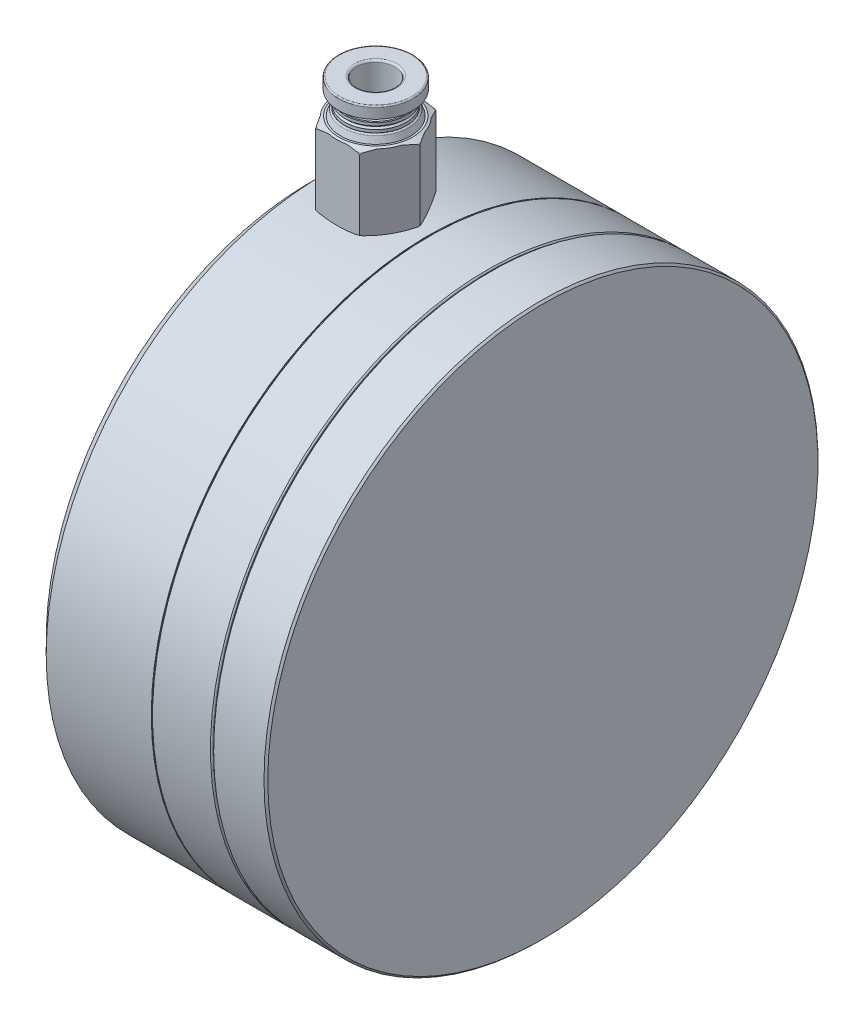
ISO-10303-21;
HEADER;
FILE_DESCRIPTION(('STEP AP214'),'2;1');
FILE_NAME('part.step','',(''),(''),'','','');
FILE_SCHEMA(('AUTOMOTIVE_DESIGN { 1 0 10303 214 1 1 1 1 }'));
ENDSEC;
DATA;
#1=APPLICATION_CONTEXT('core data for automotive mechanical design processes');
#2=APPLICATION_PROTOCOL_DEFINITION('international standard','automotive_design',2000,#1);
#3=PRODUCT_CONTEXT('',#1,'mechanical');
#4=PRODUCT('Part','Part','',(#3));
#5=PRODUCT_RELATED_PRODUCT_CATEGORY('part','',(#4));
#6=PRODUCT_DEFINITION_FORMATION('','',#4);
#7=PRODUCT_DEFINITION_CONTEXT('part definition',#1,'design');
#8=PRODUCT_DEFINITION('design','',#6,#7);
#9=PRODUCT_DEFINITION_SHAPE('','',#8);
#10=(LENGTH_UNIT() NAMED_UNIT(*) SI_UNIT(.MILLI.,.METRE.));
#11=(NAMED_UNIT(*) PLANE_ANGLE_UNIT() SI_UNIT($,.RADIAN.));
#12=(NAMED_UNIT(*) SI_UNIT($,.STERADIAN.) SOLID_ANGLE_UNIT());
#13=UNCERTAINTY_MEASURE_WITH_UNIT(LENGTH_MEASURE(1.E-05),#10,'distance_accuracy_value','');
#14=(GEOMETRIC_REPRESENTATION_CONTEXT(3) GLOBAL_UNCERTAINTY_ASSIGNED_CONTEXT((#13)) GLOBAL_UNIT_ASSIGNED_CONTEXT((#10,
#11,#12)) REPRESENTATION_CONTEXT('',''));
#15=CARTESIAN_POINT('',(0.,0.,0.));
#16=DIRECTION('',(0.,0.,1.));
#17=DIRECTION('',(1.,0.,0.));
#18=AXIS2_PLACEMENT_3D('',#15,#16,#17);
#19=CARTESIAN_POINT('',(6.2,0.,0.));
#20=DIRECTION('',(1.,0.,0.));
#21=DIRECTION('',(0.,0.,-1.));
#22=AXIS2_PLACEMENT_3D('',#19,#20,#21);
#23=PLANE('',#22);
#24=CARTESIAN_POINT('',(6.2,0.,0.));
#25=DIRECTION('',(1.,0.,0.));
#26=DIRECTION('',(0.,0.,-1.));
#27=AXIS2_PLACEMENT_3D('',#24,#25,#26);
#28=CIRCLE('',#27,15.25);
#29=CARTESIAN_POINT('',(6.2,0.,15.25));
#30=VERTEX_POINT('',#29);
#31=CARTESIAN_POINT('',(6.2,0.,-15.25));
#32=VERTEX_POINT('',#31);
#33=EDGE_CURVE('P0_E61',#30,#32,#28,.F.);
#34=ORIENTED_EDGE('',*,*,#33,.T.);
#35=CARTESIAN_POINT('',(6.2,0.,0.));
#36=DIRECTION('',(1.,0.,0.));
#37=DIRECTION('',(0.,0.,1.));
#38=AXIS2_PLACEMENT_3D('',#35,#36,#37);
#39=CIRCLE('',#38,15.25);
#40=EDGE_CURVE('P0_E641',#32,#30,#39,.F.);
#41=ORIENTED_EDGE('',*,*,#40,.T.);
#42=EDGE_LOOP('',(#34,#41));
#43=FACE_BOUND('',#42,.T.);
#44=ADVANCED_FACE('P0_F19',(#43),#23,.F.);
#45=CARTESIAN_POINT('',(5.7,0.,0.));
#46=DIRECTION('',(1.,0.,0.));
#47=DIRECTION('',(0.,0.,-1.));
#48=AXIS2_PLACEMENT_3D('',#45,#46,#47);
#49=TOROIDAL_SURFACE('',#48,15.25,0.5);
#50=ORIENTED_EDGE('',*,*,#40,.F.);
#51=ORIENTED_EDGE('',*,*,#33,.F.);
#52=EDGE_LOOP('',(#50,#51));
#53=FACE_BOUND('',#52,.T.);
#54=CARTESIAN_POINT('',(5.7,0.,0.));
#55=DIRECTION('',(-1.,0.,0.));
#56=DIRECTION('',(0.,0.,1.));
#57=AXIS2_PLACEMENT_3D('',#54,#55,#56);
#58=CIRCLE('',#57,15.75);
#59=CARTESIAN_POINT('',(5.7,0.,15.75));
#60=VERTEX_POINT('',#59);
#61=EDGE_CURVE('P0_E265',#60,#60,#58,.T.);
#62=ORIENTED_EDGE('',*,*,#61,.T.);
#63=EDGE_LOOP('',(#62));
#64=FACE_BOUND('',#63,.T.);
#65=ADVANCED_FACE('P0_F266',(#53,#64),#49,.F.);
#66=CARTESIAN_POINT('',(6.2,25.,0.));
#67=DIRECTION('',(1.,0.,0.));
#68=DIRECTION('',(0.,0.,-1.));
#69=AXIS2_PLACEMENT_3D('',#66,#67,#68);
#70=PLANE('',#69);
#71=CARTESIAN_POINT('',(6.2,25.,0.));
#72=DIRECTION('',(-1.,0.,0.));
#73=DIRECTION('',(0.,0.,1.));
#74=AXIS2_PLACEMENT_3D('',#71,#72,#73);
#75=CIRCLE('',#74,3.);
#76=CARTESIAN_POINT('',(6.2,25.,3.));
#77=VERTEX_POINT('',#76);
#78=EDGE_CURVE('P0_E633',#77,#77,#75,.T.);
#79=ORIENTED_EDGE('',*,*,#78,.T.);
#80=EDGE_LOOP('',(#79));
#81=FACE_BOUND('',#80,.T.);
#82=ADVANCED_FACE('P0_F270',(#81),#70,.F.);
#83=CARTESIAN_POINT('',(8.5,0.,0.));
#84=DIRECTION('',(1.,0.,0.));
#85=DIRECTION('',(0.,0.,-1.));
#86=AXIS2_PLACEMENT_3D('',#83,#84,#85);
#87=PLANE('',#86);
#88=CARTESIAN_POINT('',(8.5,-17.6776695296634,-17.677669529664));
#89=DIRECTION('',(-1.,0.,0.));
#90=DIRECTION('',(0.,0.,1.));
#91=AXIS2_PLACEMENT_3D('',#88,#89,#90);
#92=CIRCLE('',#91,2.5);
#93=CARTESIAN_POINT('',(8.5,-17.6776695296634,-15.177669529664));
#94=VERTEX_POINT('',#93);
#95=EDGE_CURVE('P0_E635',#94,#94,#92,.T.);
#96=ORIENTED_EDGE('',*,*,#95,.T.);
#97=EDGE_LOOP('',(#96));
#98=FACE_BOUND('',#97,.T.);
#99=ADVANCED_FACE('P0_F595',(#98),#87,.F.);
#100=CARTESIAN_POINT('',(8.5,0.,0.));
#101=DIRECTION('',(1.,0.,0.));
#102=DIRECTION('',(0.,0.,-1.));
#103=AXIS2_PLACEMENT_3D('',#100,#101,#102);
#104=PLANE('',#103);
#105=CARTESIAN_POINT('',(8.5,-17.6776695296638,17.6776695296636));
#106=DIRECTION('',(-1.,0.,0.));
#107=DIRECTION('',(0.,0.,1.));
#108=AXIS2_PLACEMENT_3D('',#105,#106,#107);
#109=CIRCLE('',#108,2.5);
#110=CARTESIAN_POINT('',(8.5,-17.6776695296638,20.1776695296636));
#111=VERTEX_POINT('',#110);
#112=EDGE_CURVE('P0_E638',#111,#111,#109,.T.);
#113=ORIENTED_EDGE('',*,*,#112,.T.);
#114=EDGE_LOOP('',(#113));
#115=FACE_BOUND('',#114,.T.);
#116=ADVANCED_FACE('P0_F585',(#115),#104,.F.);
#117=CARTESIAN_POINT('',(8.5,0.,0.));
#118=DIRECTION('',(1.,0.,0.));
#119=DIRECTION('',(0.,0.,-1.));
#120=AXIS2_PLACEMENT_3D('',#117,#118,#119);
#121=PLANE('',#120);
#122=CARTESIAN_POINT('',(8.5,17.6776695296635,17.6776695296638));
#123=DIRECTION('',(-1.,0.,0.));
#124=DIRECTION('',(0.,0.,1.));
#125=AXIS2_PLACEMENT_3D('',#122,#123,#124);
#126=CIRCLE('',#125,2.5);
#127=CARTESIAN_POINT('',(8.5,17.6776695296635,20.1776695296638));
#128=VERTEX_POINT('',#127);
#129=EDGE_CURVE('P0_E913',#128,#128,#126,.T.);
#130=ORIENTED_EDGE('',*,*,#129,.T.);
#131=EDGE_LOOP('',(#130));
#132=FACE_BOUND('',#131,.T.);
#133=ADVANCED_FACE('P0_F575',(#132),#121,.F.);
#134=CARTESIAN_POINT('',(8.5,0.,0.));
#135=DIRECTION('',(1.,0.,0.));
#136=DIRECTION('',(0.,0.,-1.));
#137=AXIS2_PLACEMENT_3D('',#134,#135,#136);
#138=PLANE('',#137);
#139=CARTESIAN_POINT('',(8.5,17.6776695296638,-17.6776695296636));
#140=DIRECTION('',(-1.,0.,0.));
#141=DIRECTION('',(0.,0.,1.));
#142=AXIS2_PLACEMENT_3D('',#139,#140,#141);
#143=CIRCLE('',#142,2.5);
#144=CARTESIAN_POINT('',(8.5,17.6776695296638,-15.1776695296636));
#145=VERTEX_POINT('',#144);
#146=EDGE_CURVE('P0_E262',#145,#145,#143,.T.);
#147=ORIENTED_EDGE('',*,*,#146,.T.);
#148=EDGE_LOOP('',(#147));
#149=FACE_BOUND('',#148,.T.);
#150=ADVANCED_FACE('P0_F565',(#149),#138,.F.);
#151=CARTESIAN_POINT('',(0.,0.,0.));
#152=DIRECTION('',(-1.,0.,0.));
#153=DIRECTION('',(0.,0.,1.));
#154=AXIS2_PLACEMENT_3D('',#151,#152,#153);
#155=CYLINDRICAL_SURFACE('',#154,15.75);
#156=CARTESIAN_POINT('',(1.,0.,0.));
#157=DIRECTION('',(-1.,0.,0.));
#158=DIRECTION('',(0.,0.,1.));
#159=AXIS2_PLACEMENT_3D('',#156,#157,#158);
#160=CIRCLE('',#159,15.75);
#161=CARTESIAN_POINT('',(1.,0.,15.75));
#162=VERTEX_POINT('',#161);
#163=EDGE_CURVE('P0_E259',#162,#162,#160,.T.);
#164=ORIENTED_EDGE('',*,*,#163,.T.);
#165=EDGE_LOOP('',(#164));
#166=FACE_BOUND('',#165,.T.);
#167=ORIENTED_EDGE('',*,*,#61,.F.);
#168=EDGE_LOOP('',(#167));
#169=FACE_BOUND('',#168,.T.);
#170=ADVANCED_FACE('P0_F555',(#166,#169),#155,.F.);
#171=CARTESIAN_POINT('',(0.,25.,0.));
#172=DIRECTION('',(-1.,0.,0.));
#173=DIRECTION('',(0.,0.,1.));
#174=AXIS2_PLACEMENT_3D('',#171,#172,#173);
#175=CYLINDRICAL_SURFACE('',#174,3.);
#176=CARTESIAN_POINT('',(0.499999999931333,25.,0.));
#177=DIRECTION('',(-1.,0.,0.));
#178=DIRECTION('',(0.,0.,1.));
#179=AXIS2_PLACEMENT_3D('',#176,#177,#178);
#180=CIRCLE('',#179,2.9999999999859);
#181=CARTESIAN_POINT('',(0.499999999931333,25.,2.9999999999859));
#182=VERTEX_POINT('',#181);
#183=EDGE_CURVE('P0_E256',#182,#182,#180,.T.);
#184=ORIENTED_EDGE('',*,*,#183,.T.);
#185=EDGE_LOOP('',(#184));
#186=FACE_BOUND('',#185,.T.);
#187=ORIENTED_EDGE('',*,*,#78,.F.);
#188=EDGE_LOOP('',(#187));
#189=FACE_BOUND('',#188,.T.);
#190=ADVANCED_FACE('P0_F545',(#186,#189),#175,.F.);
#191=CARTESIAN_POINT('',(0.,-17.6776695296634,-17.677669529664));
#192=DIRECTION('',(-1.,0.,0.));
#193=DIRECTION('',(0.,0.,1.));
#194=AXIS2_PLACEMENT_3D('',#191,#192,#193);
#195=CYLINDRICAL_SURFACE('',#194,2.5);
#196=ORIENTED_EDGE('',*,*,#95,.F.);
#197=EDGE_LOOP('',(#196));
#198=FACE_BOUND('',#197,.T.);
#199=CARTESIAN_POINT('',(0.600000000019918,-17.6776695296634,-17.677669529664));
#200=DIRECTION('',(-1.,0.,0.));
#201=DIRECTION('',(0.,0.,1.));
#202=AXIS2_PLACEMENT_3D('',#199,#200,#201);
#203=CIRCLE('',#202,2.49999999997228);
#204=CARTESIAN_POINT('',(0.600000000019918,-17.6776695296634,-15.1776695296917));
#205=VERTEX_POINT('',#204);
#206=EDGE_CURVE('P0_E253',#205,#205,#203,.T.);
#207=ORIENTED_EDGE('',*,*,#206,.T.);
#208=EDGE_LOOP('',(#207));
#209=FACE_BOUND('',#208,.T.);
#210=ADVANCED_FACE('P0_F535',(#198,#209),#195,.F.);
#211=CARTESIAN_POINT('',(0.,-17.6776695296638,17.6776695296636));
#212=DIRECTION('',(-1.,0.,0.));
#213=DIRECTION('',(0.,0.,1.));
#214=AXIS2_PLACEMENT_3D('',#211,#212,#213);
#215=CYLINDRICAL_SURFACE('',#214,2.5);
#216=ORIENTED_EDGE('',*,*,#112,.F.);
#217=EDGE_LOOP('',(#216));
#218=FACE_BOUND('',#217,.T.);
#219=CARTESIAN_POINT('',(0.600000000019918,-17.6776695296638,17.6776695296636));
#220=DIRECTION('',(-1.,0.,0.));
#221=DIRECTION('',(0.,0.,1.));
#222=AXIS2_PLACEMENT_3D('',#219,#220,#221);
#223=CIRCLE('',#222,2.4999999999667);
#224=CARTESIAN_POINT('',(0.600000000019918,-17.6776695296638,20.1776695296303));
#225=VERTEX_POINT('',#224);
#226=EDGE_CURVE('P0_E250',#225,#225,#223,.T.);
#227=ORIENTED_EDGE('',*,*,#226,.T.);
#228=EDGE_LOOP('',(#227));
#229=FACE_BOUND('',#228,.T.);
#230=ADVANCED_FACE('P0_F525',(#218,#229),#215,.F.);
#231=CARTESIAN_POINT('',(0.,17.6776695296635,17.6776695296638));
#232=DIRECTION('',(-1.,0.,0.));
#233=DIRECTION('',(0.,0.,1.));
#234=AXIS2_PLACEMENT_3D('',#231,#232,#233);
#235=CYLINDRICAL_SURFACE('',#234,2.5);
#236=ORIENTED_EDGE('',*,*,#129,.F.);
#237=EDGE_LOOP('',(#236));
#238=FACE_BOUND('',#237,.T.);
#239=CARTESIAN_POINT('',(0.599999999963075,17.6776695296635,17.6776695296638));
#240=DIRECTION('',(-1.,0.,0.));
#241=DIRECTION('',(0.,0.,1.));
#242=AXIS2_PLACEMENT_3D('',#239,#240,#241);
#243=CIRCLE('',#242,2.49999999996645);
#244=CARTESIAN_POINT('',(0.599999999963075,17.6776695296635,20.1776695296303));
#245=VERTEX_POINT('',#244);
#246=EDGE_CURVE('P0_E247',#245,#245,#243,.T.);
#247=ORIENTED_EDGE('',*,*,#246,.T.);
#248=EDGE_LOOP('',(#247));
#249=FACE_BOUND('',#248,.T.);
#250=ADVANCED_FACE('P0_F515',(#238,#249),#235,.F.);
#251=CARTESIAN_POINT('',(0.,17.6776695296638,-17.6776695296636));
#252=DIRECTION('',(-1.,0.,0.));
#253=DIRECTION('',(0.,0.,1.));
#254=AXIS2_PLACEMENT_3D('',#251,#252,#253);
#255=CYLINDRICAL_SURFACE('',#254,2.5);
#256=ORIENTED_EDGE('',*,*,#146,.F.);
#257=EDGE_LOOP('',(#256));
#258=FACE_BOUND('',#257,.T.);
#259=CARTESIAN_POINT('',(0.600000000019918,17.6776695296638,-17.6776695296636));
#260=DIRECTION('',(-1.,0.,0.));
#261=DIRECTION('',(0.,0.,1.));
#262=AXIS2_PLACEMENT_3D('',#259,#260,#261);
#263=CIRCLE('',#262,2.49999999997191);
#264=CARTESIAN_POINT('',(0.600000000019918,17.6776695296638,-15.1776695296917));
#265=VERTEX_POINT('',#264);
#266=EDGE_CURVE('P0_E243',#265,#265,#263,.T.);
#267=ORIENTED_EDGE('',*,*,#266,.T.);
#268=EDGE_LOOP('',(#267));
#269=FACE_BOUND('',#268,.T.);
#270=ADVANCED_FACE('P0_F505',(#258,#269),#255,.F.);
#271=CARTESIAN_POINT('',(0.,0.,0.));
#272=DIRECTION('',(-1.,0.,0.));
#273=DIRECTION('',(0.,0.,1.));
#274=AXIS2_PLACEMENT_3D('',#271,#272,#273);
#275=CONICAL_SURFACE('',#274,16.75,0.785398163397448);
#276=CARTESIAN_POINT('',(0.,0.,0.));
#277=DIRECTION('',(-1.,0.,0.));
#278=DIRECTION('',(0.,0.,1.));
#279=AXIS2_PLACEMENT_3D('',#276,#277,#278);
#280=CIRCLE('',#279,16.75);
#281=CARTESIAN_POINT('',(0.,0.,16.75));
#282=VERTEX_POINT('',#281);
#283=EDGE_CURVE('P0_E246',#282,#282,#280,.T.);
#284=ORIENTED_EDGE('',*,*,#283,.T.);
#285=EDGE_LOOP('',(#284));
#286=FACE_BOUND('',#285,.T.);
#287=ORIENTED_EDGE('',*,*,#163,.F.);
#288=EDGE_LOOP('',(#287));
#289=FACE_BOUND('',#288,.T.);
#290=ADVANCED_FACE('P0_F495',(#286,#289),#275,.F.);
#291=CARTESIAN_POINT('',(-5.6843418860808E-11,25.,0.));
#292=DIRECTION('',(-1.,0.,0.));
#293=DIRECTION('',(0.,0.,1.));
#294=AXIS2_PLACEMENT_3D('',#291,#292,#293);
#295=CONICAL_SURFACE('',#294,3.49999999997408,0.785398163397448);
#296=CARTESIAN_POINT('',(-5.6843418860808E-11,25.,0.));
#297=DIRECTION('',(-1.,0.,0.));
#298=DIRECTION('',(0.,0.,1.));
#299=AXIS2_PLACEMENT_3D('',#296,#297,#298);
#300=CIRCLE('',#299,3.49999999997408);
#301=CARTESIAN_POINT('',(-5.6843418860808E-11,25.,3.49999999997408));
#302=VERTEX_POINT('',#301);
#303=EDGE_CURVE('P0_E920',#302,#302,#300,.T.);
#304=ORIENTED_EDGE('',*,*,#303,.T.);
#305=EDGE_LOOP('',(#304));
#306=FACE_BOUND('',#305,.T.);
#307=ORIENTED_EDGE('',*,*,#183,.F.);
#308=EDGE_LOOP('',(#307));
#309=FACE_BOUND('',#308,.T.);
#310=ADVANCED_FACE('P0_F485',(#306,#309),#295,.F.);
#311=CARTESIAN_POINT('',(5.6843418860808E-11,-17.6776695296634,-17.677669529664));
#312=DIRECTION('',(-1.,0.,0.));
#313=DIRECTION('',(0.,0.,1.));
#314=AXIS2_PLACEMENT_3D('',#311,#312,#313);
#315=CONICAL_SURFACE('',#314,3.09999999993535,0.785398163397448);
#316=ORIENTED_EDGE('',*,*,#206,.F.);
#317=EDGE_LOOP('',(#316));
#318=FACE_BOUND('',#317,.T.);
#319=CARTESIAN_POINT('',(0.,-17.6776695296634,-17.677669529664));
#320=DIRECTION('',(-1.,0.,0.));
#321=DIRECTION('',(0.,0.,1.));
#322=AXIS2_PLACEMENT_3D('',#319,#320,#321);
#323=CIRCLE('',#322,3.0999999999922);
#324=CARTESIAN_POINT('',(0.,-17.6776695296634,-14.5776695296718));
#325=VERTEX_POINT('',#324);
#326=EDGE_CURVE('P0_E923',#325,#325,#323,.T.);
#327=ORIENTED_EDGE('',*,*,#326,.T.);
#328=EDGE_LOOP('',(#327));
#329=FACE_BOUND('',#328,.T.);
#330=ADVANCED_FACE('P0_F475',(#318,#329),#315,.F.);
#331=CARTESIAN_POINT('',(0.,-17.6776695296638,17.6776695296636));
#332=DIRECTION('',(-1.,0.,0.));
#333=DIRECTION('',(0.,0.,1.));
#334=AXIS2_PLACEMENT_3D('',#331,#332,#333);
#335=CONICAL_SURFACE('',#334,3.09999999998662,0.785398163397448);
#336=ORIENTED_EDGE('',*,*,#226,.F.);
#337=EDGE_LOOP('',(#336));
#338=FACE_BOUND('',#337,.T.);
#339=CARTESIAN_POINT('',(0.,-17.6776695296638,17.6776695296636));
#340=DIRECTION('',(-1.,0.,0.));
#341=DIRECTION('',(0.,0.,1.));
#342=AXIS2_PLACEMENT_3D('',#339,#340,#341);
#343=CIRCLE('',#342,3.09999999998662);
#344=CARTESIAN_POINT('',(0.,-17.6776695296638,20.7776695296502));
#345=VERTEX_POINT('',#344);
#346=EDGE_CURVE('P0_E926',#345,#345,#343,.T.);
#347=ORIENTED_EDGE('',*,*,#346,.T.);
#348=EDGE_LOOP('',(#347));
#349=FACE_BOUND('',#348,.T.);
#350=ADVANCED_FACE('P0_F465',(#338,#349),#335,.F.);
#351=CARTESIAN_POINT('',(0.,17.6776695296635,17.6776695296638));
#352=DIRECTION('',(-1.,0.,0.));
#353=DIRECTION('',(0.,0.,1.));
#354=AXIS2_PLACEMENT_3D('',#351,#352,#353);
#355=CONICAL_SURFACE('',#354,3.09999999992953,0.785398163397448);
#356=ORIENTED_EDGE('',*,*,#246,.F.);
#357=EDGE_LOOP('',(#356));
#358=FACE_BOUND('',#357,.T.);
#359=CARTESIAN_POINT('',(0.,17.6776695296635,17.6776695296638));
#360=DIRECTION('',(-1.,0.,0.));
#361=DIRECTION('',(0.,0.,1.));
#362=AXIS2_PLACEMENT_3D('',#359,#360,#361);
#363=CIRCLE('',#362,3.09999999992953);
#364=CARTESIAN_POINT('',(0.,17.6776695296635,20.7776695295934));
#365=VERTEX_POINT('',#364);
#366=EDGE_CURVE('P0_E929',#365,#365,#363,.T.);
#367=ORIENTED_EDGE('',*,*,#366,.T.);
#368=EDGE_LOOP('',(#367));
#369=FACE_BOUND('',#368,.T.);
#370=ADVANCED_FACE('P0_F455',(#358,#369),#355,.F.);
#371=CARTESIAN_POINT('',(0.,17.6776695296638,-17.6776695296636));
#372=DIRECTION('',(-1.,0.,0.));
#373=DIRECTION('',(0.,0.,1.));
#374=AXIS2_PLACEMENT_3D('',#371,#372,#373);
#375=CONICAL_SURFACE('',#374,3.09999999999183,0.785398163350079);
#376=ORIENTED_EDGE('',*,*,#266,.F.);
#377=EDGE_LOOP('',(#376));
#378=FACE_BOUND('',#377,.T.);
#379=CARTESIAN_POINT('',(0.,17.6776695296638,-17.6776695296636));
#380=DIRECTION('',(-1.,0.,0.));
#381=DIRECTION('',(0.,0.,1.));
#382=AXIS2_PLACEMENT_3D('',#379,#380,#381);
#383=CIRCLE('',#382,3.09999999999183);
#384=CARTESIAN_POINT('',(0.,17.6776695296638,-14.5776695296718));
#385=VERTEX_POINT('',#384);
#386=EDGE_CURVE('P0_E932',#385,#385,#383,.T.);
#387=ORIENTED_EDGE('',*,*,#386,.T.);
#388=EDGE_LOOP('',(#387));
#389=FACE_BOUND('',#388,.T.);
#390=ADVANCED_FACE('P0_F445',(#378,#389),#375,.F.);
#391=CARTESIAN_POINT('',(0.,15.75,0.));
#392=DIRECTION('',(1.,0.,0.));
#393=DIRECTION('',(0.,0.,-1.));
#394=AXIS2_PLACEMENT_3D('',#391,#392,#393);
#395=PLANE('',#394);
#396=ORIENTED_EDGE('',*,*,#386,.F.);
#397=EDGE_LOOP('',(#396));
#398=FACE_BOUND('',#397,.T.);
#399=ORIENTED_EDGE('',*,*,#366,.F.);
#400=EDGE_LOOP('',(#399));
#401=FACE_BOUND('',#400,.T.);
#402=ORIENTED_EDGE('',*,*,#346,.F.);
#403=EDGE_LOOP('',(#402));
#404=FACE_BOUND('',#403,.T.);
#405=ORIENTED_EDGE('',*,*,#326,.F.);
#406=EDGE_LOOP('',(#405));
#407=FACE_BOUND('',#406,.T.);
#408=ORIENTED_EDGE('',*,*,#303,.F.);
#409=EDGE_LOOP('',(#408));
#410=FACE_BOUND('',#409,.T.);
#411=CARTESIAN_POINT('',(0.,0.,0.));
#412=DIRECTION('',(1.,0.,0.));
#413=DIRECTION('',(0.,0.,-1.));
#414=AXIS2_PLACEMENT_3D('',#411,#412,#413);
#415=CIRCLE('',#414,30.5);
#416=CARTESIAN_POINT('',(0.,0.,-30.5));
#417=VERTEX_POINT('',#416);
#418=EDGE_CURVE('P0_E242',#417,#417,#415,.T.);
#419=ORIENTED_EDGE('',*,*,#418,.F.);
#420=EDGE_LOOP('',(#419));
#421=FACE_BOUND('',#420,.T.);
#422=ORIENTED_EDGE('',*,*,#283,.F.);
#423=EDGE_LOOP('',(#422));
#424=FACE_BOUND('',#423,.T.);
#425=ADVANCED_FACE('P0_F436',(#398,#401,#404,#407,#410,#421,#424),#395,.F.);
#426=CARTESIAN_POINT('',(1.00000000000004,0.,0.));
#427=DIRECTION('',(1.,0.,0.));
#428=DIRECTION('',(0.,0.,-1.));
#429=AXIS2_PLACEMENT_3D('',#426,#427,#428);
#430=CONICAL_SURFACE('',#429,31.5,0.785398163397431);
#431=CARTESIAN_POINT('',(1.00000000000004,0.,0.));
#432=DIRECTION('',(-1.,0.,0.));
#433=DIRECTION('',(0.,0.,1.));
#434=AXIS2_PLACEMENT_3D('',#431,#432,#433);
#435=CIRCLE('',#434,31.5);
#436=CARTESIAN_POINT('',(1.00000000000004,0.,31.5));
#437=VERTEX_POINT('',#436);
#438=EDGE_CURVE('P0_E239',#437,#437,#435,.F.);
#439=ORIENTED_EDGE('',*,*,#438,.F.);
#440=EDGE_LOOP('',(#439));
#441=FACE_BOUND('',#440,.T.);
#442=ORIENTED_EDGE('',*,*,#418,.T.);
#443=EDGE_LOOP('',(#442));
#444=FACE_BOUND('',#443,.T.);
#445=ADVANCED_FACE('P0_F427',(#441,#444),#430,.T.);
#446=CARTESIAN_POINT('',(0.,0.,0.));
#447=DIRECTION('',(-1.,0.,0.));
#448=DIRECTION('',(0.,0.,1.));
#449=AXIS2_PLACEMENT_3D('',#446,#447,#448);
#450=CYLINDRICAL_SURFACE('',#449,31.5);
#451=ORIENTED_EDGE('',*,*,#438,.T.);
#452=EDGE_LOOP('',(#451));
#453=FACE_BOUND('',#452,.T.);
#454=CARTESIAN_POINT('',(6.,0.,0.));
#455=DIRECTION('',(1.,0.,0.));
#456=DIRECTION('',(0.,0.,-1.));
#457=AXIS2_PLACEMENT_3D('',#454,#455,#456);
#458=CIRCLE('',#457,31.5);
#459=CARTESIAN_POINT('',(6.,0.,-31.5));
#460=VERTEX_POINT('',#459);
#461=EDGE_CURVE('P0_E231',#460,#460,#458,.F.);
#462=ORIENTED_EDGE('',*,*,#461,.T.);
#463=EDGE_LOOP('',(#462));
#464=FACE_BOUND('',#463,.T.);
#465=ADVANCED_FACE('P0_F216',(#453,#464),#450,.T.);
#466=CARTESIAN_POINT('',(6.,0.,0.));
#467=DIRECTION('',(1.,0.,0.));
#468=DIRECTION('',(0.,0.,-1.));
#469=AXIS2_PLACEMENT_3D('',#466,#467,#468);
#470=TOROIDAL_SURFACE('',#469,32.,0.5);
#471=CARTESIAN_POINT('',(6.5,0.,0.));
#472=DIRECTION('',(-1.,0.,0.));
#473=DIRECTION('',(0.,0.,1.));
#474=AXIS2_PLACEMENT_3D('',#471,#472,#473);
#475=CIRCLE('',#474,32.);
#476=CARTESIAN_POINT('',(6.5,0.,32.));
#477=VERTEX_POINT('',#476);
#478=CARTESIAN_POINT('',(6.5,0.,-32.));
#479=VERTEX_POINT('',#478);
#480=EDGE_CURVE('P0_E227',#477,#479,#475,.T.);
#481=ORIENTED_EDGE('',*,*,#480,.T.);
#482=CARTESIAN_POINT('',(6.5,0.,0.));
#483=DIRECTION('',(-1.,0.,0.));
#484=DIRECTION('',(0.,0.,-1.));
#485=AXIS2_PLACEMENT_3D('',#482,#483,#484);
#486=CIRCLE('',#485,32.);
#487=EDGE_CURVE('P0_E200',#479,#477,#486,.T.);
#488=ORIENTED_EDGE('',*,*,#487,.T.);
#489=EDGE_LOOP('',(#481,#488));
#490=FACE_BOUND('',#489,.T.);
#491=ORIENTED_EDGE('',*,*,#461,.F.);
#492=EDGE_LOOP('',(#491));
#493=FACE_BOUND('',#492,.T.);
#494=ADVANCED_FACE('P0_F204',(#490,#493),#470,.F.);
#495=CARTESIAN_POINT('',(16.75,41.5,0.));
#496=DIRECTION('',(0.,1.,0.));
#497=DIRECTION('',(0.,0.,1.));
#498=AXIS2_PLACEMENT_3D('',#495,#496,#497);
#499=PLANE('',#498);
#500=CARTESIAN_POINT('',(16.75,41.5,0.));
#501=DIRECTION('',(0.,1.,0.));
#502=DIRECTION('',(0.,0.,1.));
#503=AXIS2_PLACEMENT_3D('',#500,#501,#502);
#504=CIRCLE('',#503,4.);
#505=CARTESIAN_POINT('',(16.75,41.5,4.));
#506=VERTEX_POINT('',#505);
#507=EDGE_CURVE('P0_E936',#506,#506,#504,.T.);
#508=ORIENTED_EDGE('',*,*,#507,.T.);
#509=EDGE_LOOP('',(#508));
#510=FACE_BOUND('',#509,.T.);
#511=ADVANCED_FACE('P0_F215',(#510),#499,.T.);
#512=CARTESIAN_POINT('',(6.5,31.5,0.));
#513=DIRECTION('',(1.,0.,0.));
#514=DIRECTION('',(0.,0.,-1.));
#515=AXIS2_PLACEMENT_3D('',#512,#513,#514);
#516=PLANE('',#515);
#517=CARTESIAN_POINT('',(6.5,0.,0.));
#518=DIRECTION('',(1.,0.,0.));
#519=DIRECTION('',(0.,0.,-1.));
#520=AXIS2_PLACEMENT_3D('',#517,#518,#519);
#521=CIRCLE('',#520,41.5);
#522=CARTESIAN_POINT('',(6.5,0.,-41.5));
#523=VERTEX_POINT('',#522);
#524=EDGE_CURVE('P0_E298',#523,#523,#521,.T.);
#525=ORIENTED_EDGE('',*,*,#524,.F.);
#526=EDGE_LOOP('',(#525));
#527=FACE_BOUND('',#526,.T.);
#528=ORIENTED_EDGE('',*,*,#487,.F.);
#529=ORIENTED_EDGE('',*,*,#480,.F.);
#530=EDGE_LOOP('',(#528,#529));
#531=FACE_BOUND('',#530,.T.);
#532=ADVANCED_FACE('P0_F314',(#527,#531),#516,.F.);
#533=CARTESIAN_POINT('',(16.75,41.5,0.));
#534=DIRECTION('',(0.,1.,0.));
#535=DIRECTION('',(0.,0.,1.));
#536=AXIS2_PLACEMENT_3D('',#533,#534,#535);
#537=CYLINDRICAL_SURFACE('',#536,4.);
#538=ORIENTED_EDGE('',*,*,#507,.F.);
#539=EDGE_LOOP('',(#538));
#540=FACE_BOUND('',#539,.T.);
#541=CARTESIAN_POINT('',(16.75,43.3157015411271,-4.));
#542=CARTESIAN_POINT('',(16.8620362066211,43.3157016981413,-3.99999933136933));
#543=CARTESIAN_POINT('',(16.9740916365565,43.3161374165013,-3.99528869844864));
#544=CARTESIAN_POINT('',(17.1974470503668,43.3178684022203,-3.9764762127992));
#545=CARTESIAN_POINT('',(17.3087466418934,43.3191640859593,-3.96236981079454));
#546=CARTESIAN_POINT('',(17.5299514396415,43.3225816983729,-3.92482788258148));
#547=CARTESIAN_POINT('',(17.6398539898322,43.3247050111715,-3.90137672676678));
#548=CARTESIAN_POINT('',(17.8572947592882,43.3297155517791,-3.84532559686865));
#549=CARTESIAN_POINT('',(17.9648320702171,43.3326030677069,-3.81272217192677));
#550=CARTESIAN_POINT('',(18.2824470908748,43.3422872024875,-3.70158860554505));
#551=CARTESIAN_POINT('',(18.4879856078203,43.3501129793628,-3.6096569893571));
#552=CARTESIAN_POINT('',(18.8805098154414,43.3676202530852,-3.39282422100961));
#553=CARTESIAN_POINT('',(19.0675036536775,43.3773009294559,-3.26793763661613));
#554=CARTESIAN_POINT('',(19.418473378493,43.3974647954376,-2.98826194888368));
#555=CARTESIAN_POINT('',(19.5823823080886,43.4079501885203,-2.83338883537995));
#556=CARTESIAN_POINT('',(19.8819195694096,43.4285219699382,-2.49831850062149));
#557=CARTESIAN_POINT('',(20.0175452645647,43.4386083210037,-2.31811892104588));
#558=CARTESIAN_POINT('',(20.2568843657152,43.4572655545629,-1.93712529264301));
#559=CARTESIAN_POINT('',(20.3605415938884,43.4658337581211,-1.73629580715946));
#560=CARTESIAN_POINT('',(20.5326379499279,43.4804663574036,-1.31999217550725));
#561=CARTESIAN_POINT('',(20.6010781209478,43.4865308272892,-1.10451846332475));
#562=CARTESIAN_POINT('',(20.7006113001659,43.4954578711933,-0.665691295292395));
#563=CARTESIAN_POINT('',(20.7318099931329,43.4983295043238,-0.442361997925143));
#564=CARTESIAN_POINT('',(20.7563011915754,43.5005780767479,0.00638069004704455));
#565=CARTESIAN_POINT('',(20.7495944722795,43.4999550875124,0.231794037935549));
#566=CARTESIAN_POINT('',(20.6985516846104,43.4952920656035,0.677586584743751));
#567=CARTESIAN_POINT('',(20.6543296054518,43.4912623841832,0.897978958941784));
#568=CARTESIAN_POINT('',(20.5296874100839,43.4802508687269,1.3282021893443));
#569=CARTESIAN_POINT('',(20.4492665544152,43.4732689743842,1.53803282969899));
#570=CARTESIAN_POINT('',(20.2543829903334,43.457120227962,1.94154090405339));
#571=CARTESIAN_POINT('',(20.139868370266,43.4479500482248,2.13519312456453));
#572=CARTESIAN_POINT('',(19.8800863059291,43.4284553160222,2.50055827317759));
#573=CARTESIAN_POINT('',(19.7348206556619,43.4181308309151,2.67227248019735));
#574=CARTESIAN_POINT('',(19.4170833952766,43.3974439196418,2.98952771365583));
#575=CARTESIAN_POINT('',(19.2445180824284,43.3870814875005,3.13497475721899));
#576=CARTESIAN_POINT('',(18.8771683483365,43.367514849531,3.39495743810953));
#577=CARTESIAN_POINT('',(18.6823736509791,43.3583111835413,3.5094786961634));
#578=CARTESIAN_POINT('',(18.3778887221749,43.3461604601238,3.65550762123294));
#579=CARTESIAN_POINT('',(18.2742313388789,43.3423829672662,3.69992433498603));
#580=CARTESIAN_POINT('',(18.0635301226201,43.3354855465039,3.77985573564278));
#581=CARTESIAN_POINT('',(17.9564875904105,43.3323653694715,3.81537379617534));
#582=CARTESIAN_POINT('',(17.7399625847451,43.3268776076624,3.87719447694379));
#583=CARTESIAN_POINT('',(17.6304845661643,43.3245087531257,3.90351265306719));
#584=CARTESIAN_POINT('',(17.4097274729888,43.3205848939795,3.94682153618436));
#585=CARTESIAN_POINT('',(17.298449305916,43.3190294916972,3.96381680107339));
#586=CARTESIAN_POINT('',(17.114177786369,43.3171716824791,3.9840552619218));
#587=CARTESIAN_POINT('',(17.0414758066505,43.316621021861,3.99003249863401));
#588=CARTESIAN_POINT('',(16.8958519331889,43.315885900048,3.99800508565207));
#589=CARTESIAN_POINT('',(16.8229300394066,43.3157014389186,4.00000043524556));
#590=CARTESIAN_POINT('',(16.6379637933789,43.3157016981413,3.99999933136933));
#591=CARTESIAN_POINT('',(16.5259083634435,43.3161374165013,3.99528869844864));
#592=CARTESIAN_POINT('',(16.3025529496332,43.3178684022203,3.9764762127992));
#593=CARTESIAN_POINT('',(16.1912533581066,43.3191640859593,3.96236981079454));
#594=CARTESIAN_POINT('',(15.9700485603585,43.3225816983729,3.92482788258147));
#595=CARTESIAN_POINT('',(15.8601460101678,43.3247050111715,3.90137672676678));
#596=CARTESIAN_POINT('',(15.6427052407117,43.3297155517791,3.84532559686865));
#597=CARTESIAN_POINT('',(15.5351679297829,43.3326030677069,3.81272217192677));
#598=CARTESIAN_POINT('',(15.2175529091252,43.3422872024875,3.70158860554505));
#599=CARTESIAN_POINT('',(15.0120143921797,43.3501129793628,3.6096569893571));
#600=CARTESIAN_POINT('',(14.6194901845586,43.3676202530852,3.39282422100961));
#601=CARTESIAN_POINT('',(14.4324963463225,43.3773009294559,3.26793763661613));
#602=CARTESIAN_POINT('',(14.081526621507,43.3974647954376,2.98826194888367));
#603=CARTESIAN_POINT('',(13.9176176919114,43.4079501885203,2.83338883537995));
#604=CARTESIAN_POINT('',(13.6180804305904,43.4285219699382,2.49831850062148));
#605=CARTESIAN_POINT('',(13.4824547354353,43.4386083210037,2.31811892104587));
#606=CARTESIAN_POINT('',(13.2431156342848,43.4572655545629,1.93712529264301));
#607=CARTESIAN_POINT('',(13.1394584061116,43.4658337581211,1.73629580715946));
#608=CARTESIAN_POINT('',(12.9673620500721,43.4804663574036,1.31999217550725));
#609=CARTESIAN_POINT('',(12.8989218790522,43.4865308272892,1.10451846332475));
#610=CARTESIAN_POINT('',(12.7993886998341,43.4954578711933,0.665691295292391));
#611=CARTESIAN_POINT('',(12.7681900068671,43.4983295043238,0.442361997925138));
#612=CARTESIAN_POINT('',(12.7436988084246,43.5005780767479,-0.00638069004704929));
#613=CARTESIAN_POINT('',(12.7504055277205,43.4999550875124,-0.231794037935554));
#614=CARTESIAN_POINT('',(12.8014483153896,43.4952920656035,-0.677586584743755));
#615=CARTESIAN_POINT('',(12.8456703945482,43.4912623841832,-0.897978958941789));
#616=CARTESIAN_POINT('',(12.9703125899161,43.4802508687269,-1.32820218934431));
#617=CARTESIAN_POINT('',(13.0507334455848,43.4732689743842,-1.538032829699));
#618=CARTESIAN_POINT('',(13.2456170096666,43.457120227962,-1.94154090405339));
#619=CARTESIAN_POINT('',(13.360131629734,43.4479500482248,-2.13519312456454));
#620=CARTESIAN_POINT('',(13.6199136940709,43.4284553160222,-2.50055827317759));
#621=CARTESIAN_POINT('',(13.7651793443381,43.4181308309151,-2.67227248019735));
#622=CARTESIAN_POINT('',(14.0829166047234,43.3974439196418,-2.98952771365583));
#623=CARTESIAN_POINT('',(14.2554819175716,43.3870814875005,-3.13497475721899));
#624=CARTESIAN_POINT('',(14.6228316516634,43.367514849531,-3.39495743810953));
#625=CARTESIAN_POINT('',(14.8176263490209,43.3583111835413,-3.5094786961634));
#626=CARTESIAN_POINT('',(15.1221112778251,43.3461604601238,-3.65550762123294));
#627=CARTESIAN_POINT('',(15.2257686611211,43.3423829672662,-3.69992433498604));
#628=CARTESIAN_POINT('',(15.4364698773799,43.3354855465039,-3.77985573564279));
#629=CARTESIAN_POINT('',(15.5435124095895,43.3323653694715,-3.81537379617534));
#630=CARTESIAN_POINT('',(15.7600374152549,43.3268776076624,-3.87719447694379));
#631=CARTESIAN_POINT('',(15.8695154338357,43.3245087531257,-3.90351265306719));
#632=CARTESIAN_POINT('',(16.0902725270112,43.3205848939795,-3.94682153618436));
#633=CARTESIAN_POINT('',(16.201550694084,43.3190294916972,-3.96381680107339));
#634=CARTESIAN_POINT('',(16.385822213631,43.3171716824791,-3.9840552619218));
#635=CARTESIAN_POINT('',(16.4585241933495,43.316621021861,-3.99003249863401));
#636=CARTESIAN_POINT('',(16.6041480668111,43.315885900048,-3.99800508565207));
#637=CARTESIAN_POINT('',(16.6770699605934,43.3157014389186,-4.00000043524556));
#638=CARTESIAN_POINT('',(16.75,43.3157015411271,-4.));
#639=B_SPLINE_CURVE_WITH_KNOTS('',3,(#541,#542,#543,#544,#545,#546,#547,#548,#549,#550,#551,
#552,#553,#554,#555,#556,#557,#558,#559,#560,#561,#562,#563,#564,#565,#566,#567,#568,#569,#570,
#571,#572,#573,#574,#575,#576,#577,#578,#579,#580,#581,#582,#583,#584,#585,#586,#587,#588,#589,
#590,#591,#592,#593,#594,#595,#596,#597,#598,#599,#600,#601,#602,#603,#604,#605,#606,#607,#608,
#609,#610,#611,#612,#613,#614,#615,#616,#617,#618,#619,#620,#621,#622,#623,#624,#625,#626,#627,
#628,#629,#630,#631,#632,#633,#634,#635,#636,#637,#638),.UNSPECIFIED.,.T.,.F.,(4,2,2,2,2,2,2,2,
2,2,2,2,2,2,2,2,2,2,2,2,2,2,2,2,2,2,2,2,2,2,2,2,2,2,2,2,2,2,2,2,2,2,2,2,2,2,2,2,4),(0.,
0.336041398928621,0.672245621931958,1.00901454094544,1.34591060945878,2.01832709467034,
2.69044683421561,3.36447756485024,4.03857110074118,4.71384255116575,5.3890939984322,
6.06242461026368,6.73574145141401,7.40701973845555,8.07831173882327,8.75063113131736,
9.42291131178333,10.0975511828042,10.7725041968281,11.1106809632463,11.4487293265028,
11.7862032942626,12.1235121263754,12.3422584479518,12.5610048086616,12.8970462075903,
13.2332504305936,13.5700193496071,13.9069154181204,14.579331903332,15.2514516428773,
15.9254823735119,16.5995759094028,17.2748473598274,17.9500988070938,18.6234294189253,
19.2967462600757,19.9680245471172,20.6393165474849,21.311635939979,21.983916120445,
22.6585559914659,23.3335090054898,23.6716857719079,24.0097341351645,24.3472081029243,
24.684516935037,24.9032632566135,25.1220096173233),.UNSPECIFIED.);
#640=CARTESIAN_POINT('',(16.75,43.3157015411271,-4.));
#641=VERTEX_POINT('',#640);
#642=EDGE_CURVE('P0_E292',#641,#641,#639,.T.);
#643=ORIENTED_EDGE('',*,*,#642,.F.);
#644=EDGE_LOOP('',(#643));
#645=FACE_BOUND('',#644,.T.);
#646=ADVANCED_FACE('P0_F300',(#540,#645),#537,.F.);
#647=CARTESIAN_POINT('',(8.49999999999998,0.,0.));
#648=DIRECTION('',(1.,0.,0.));
#649=DIRECTION('',(0.,0.,-1.));
#650=AXIS2_PLACEMENT_3D('',#647,#648,#649);
#651=CONICAL_SURFACE('',#650,43.5,0.785398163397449);
#652=CARTESIAN_POINT('',(8.50000000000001,0.,0.));
#653=DIRECTION('',(-1.,0.,0.));
#654=DIRECTION('',(0.,0.,1.));
#655=AXIS2_PLACEMENT_3D('',#652,#653,#654);
#656=CIRCLE('',#655,43.5);
#657=CARTESIAN_POINT('',(8.50000000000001,0.,43.5));
#658=VERTEX_POINT('',#657);
#659=EDGE_CURVE('P0_E291',#658,#658,#656,.F.);
#660=ORIENTED_EDGE('',*,*,#659,.F.);
#661=EDGE_LOOP('',(#660));
#662=FACE_BOUND('',#661,.T.);
#663=ORIENTED_EDGE('',*,*,#524,.T.);
#664=EDGE_LOOP('',(#663));
#665=FACE_BOUND('',#664,.T.);
#666=ADVANCED_FACE('P0_F306',(#662,#665),#651,.T.);
#667=CARTESIAN_POINT('',(148.036579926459,0.,0.));
#668=DIRECTION('',(-1.,0.,0.));
#669=DIRECTION('',(0.,0.,1.));
#670=AXIS2_PLACEMENT_3D('',#667,#668,#669);
#671=CYLINDRICAL_SURFACE('',#670,43.5);
#672=ORIENTED_EDGE('',*,*,#659,.T.);
#673=EDGE_LOOP('',(#672));
#674=FACE_BOUND('',#673,.T.);
#675=CARTESIAN_POINT('',(25.,0.,0.));
#676=DIRECTION('',(-1.,0.,0.));
#677=DIRECTION('',(0.,0.,1.));
#678=AXIS2_PLACEMENT_3D('',#675,#676,#677);
#679=CIRCLE('',#678,43.5);
#680=CARTESIAN_POINT('',(25.,0.,43.5));
#681=VERTEX_POINT('',#680);
#682=EDGE_CURVE('P0_E287',#681,#681,#679,.F.);
#683=ORIENTED_EDGE('',*,*,#682,.F.);
#684=EDGE_LOOP('',(#683));
#685=FACE_BOUND('',#684,.T.);
#686=ORIENTED_EDGE('',*,*,#642,.T.);
#687=EDGE_LOOP('',(#686));
#688=FACE_BOUND('',#687,.T.);
#689=ADVANCED_FACE('P0_F303',(#674,#685,#688),#671,.T.);
#690=CARTESIAN_POINT('',(25.,0.,0.));
#691=DIRECTION('',(1.,0.,0.));
#692=DIRECTION('',(0.,0.,-1.));
#693=AXIS2_PLACEMENT_3D('',#690,#691,#692);
#694=PLANE('',#693);
#695=ORIENTED_EDGE('',*,*,#682,.T.);
#696=EDGE_LOOP('',(#695));
#697=FACE_BOUND('',#696,.T.);
#698=CARTESIAN_POINT('',(25.,0.,0.));
#699=DIRECTION('',(1.,0.,0.));
#700=DIRECTION('',(0.,0.,1.));
#701=AXIS2_PLACEMENT_3D('',#698,#699,#700);
#702=CIRCLE('',#701,43.3);
#703=CARTESIAN_POINT('',(25.,0.,43.3));
#704=VERTEX_POINT('',#703);
#705=CARTESIAN_POINT('',(25.,0.,-43.3));
#706=VERTEX_POINT('',#705);
#707=EDGE_CURVE('P0_E164',#704,#706,#702,.T.);
#708=ORIENTED_EDGE('',*,*,#707,.F.);
#709=CARTESIAN_POINT('',(25.,0.,0.));
#710=DIRECTION('',(1.,0.,0.));
#711=DIRECTION('',(0.,0.,-1.));
#712=AXIS2_PLACEMENT_3D('',#709,#710,#711);
#713=CIRCLE('',#712,43.3);
#714=EDGE_CURVE('P0_E290',#706,#704,#713,.T.);
#715=ORIENTED_EDGE('',*,*,#714,.F.);
#716=EDGE_LOOP('',(#708,#715));
#717=FACE_BOUND('',#716,.T.);
#718=ADVANCED_FACE('P0_F175',(#697,#717),#694,.T.);
#719=CARTESIAN_POINT('',(25.2,0.,0.));
#720=DIRECTION('',(-1.,0.,0.));
#721=DIRECTION('',(0.,0.,1.));
#722=AXIS2_PLACEMENT_3D('',#719,#720,#721);
#723=TOROIDAL_SURFACE('',#722,43.3,0.2);
#724=CARTESIAN_POINT('',(25.2,0.,0.));
#725=DIRECTION('',(1.,0.,0.));
#726=DIRECTION('',(0.,0.,-1.));
#727=AXIS2_PLACEMENT_3D('',#724,#725,#726);
#728=CIRCLE('',#727,43.5);
#729=CARTESIAN_POINT('',(25.2,0.,-43.5));
#730=VERTEX_POINT('',#729);
#731=EDGE_CURVE('P0_E161',#730,#730,#728,.T.);
#732=ORIENTED_EDGE('',*,*,#731,.F.);
#733=EDGE_LOOP('',(#732));
#734=FACE_BOUND('',#733,.T.);
#735=ORIENTED_EDGE('',*,*,#707,.T.);
#736=ORIENTED_EDGE('',*,*,#714,.T.);
#737=EDGE_LOOP('',(#735,#736));
#738=FACE_BOUND('',#737,.T.);
#739=ADVANCED_FACE('P0_F170',(#734,#738),#723,.T.);
#740=CARTESIAN_POINT('',(34.5,0.,0.));
#741=DIRECTION('',(1.,0.,0.));
#742=DIRECTION('',(0.,0.,-1.));
#743=AXIS2_PLACEMENT_3D('',#740,#741,#742);
#744=CYLINDRICAL_SURFACE('',#743,43.5);
#745=ORIENTED_EDGE('',*,*,#731,.T.);
#746=EDGE_LOOP('',(#745));
#747=FACE_BOUND('',#746,.T.);
#748=CARTESIAN_POINT('',(34.3,0.,0.));
#749=DIRECTION('',(1.,0.,0.));
#750=DIRECTION('',(0.,0.,-1.));
#751=AXIS2_PLACEMENT_3D('',#748,#749,#750);
#752=CIRCLE('',#751,43.5);
#753=CARTESIAN_POINT('',(34.3,0.,-43.5));
#754=VERTEX_POINT('',#753);
#755=EDGE_CURVE('P0_E153',#754,#754,#752,.T.);
#756=ORIENTED_EDGE('',*,*,#755,.F.);
#757=EDGE_LOOP('',(#756));
#758=FACE_BOUND('',#757,.T.);
#759=ADVANCED_FACE('P0_F174',(#747,#758),#744,.T.);
#760=CARTESIAN_POINT('',(34.3,0.,0.));
#761=DIRECTION('',(1.,0.,0.));
#762=DIRECTION('',(0.,0.,-1.));
#763=AXIS2_PLACEMENT_3D('',#760,#761,#762);
#764=TOROIDAL_SURFACE('',#763,43.3,0.2);
#765=ORIENTED_EDGE('',*,*,#755,.T.);
#766=EDGE_LOOP('',(#765));
#767=FACE_BOUND('',#766,.T.);
#768=CARTESIAN_POINT('',(34.5,0.,0.));
#769=DIRECTION('',(-1.,0.,0.));
#770=DIRECTION('',(0.,0.,-1.));
#771=AXIS2_PLACEMENT_3D('',#768,#769,#770);
#772=CIRCLE('',#771,43.3);
#773=CARTESIAN_POINT('',(34.5,0.,43.3));
#774=VERTEX_POINT('',#773);
#775=CARTESIAN_POINT('',(34.5,0.,-43.3));
#776=VERTEX_POINT('',#775);
#777=EDGE_CURVE('P0_E149',#774,#776,#772,.F.);
#778=ORIENTED_EDGE('',*,*,#777,.F.);
#779=CARTESIAN_POINT('',(34.5,0.,0.));
#780=DIRECTION('',(-1.,0.,0.));
#781=DIRECTION('',(0.,0.,1.));
#782=AXIS2_PLACEMENT_3D('',#779,#780,#781);
#783=CIRCLE('',#782,43.3);
#784=EDGE_CURVE('P0_E38',#776,#774,#783,.F.);
#785=ORIENTED_EDGE('',*,*,#784,.F.);
#786=EDGE_LOOP('',(#778,#785));
#787=FACE_BOUND('',#786,.T.);
#788=ADVANCED_FACE('P0_F132',(#767,#787),#764,.T.);
#789=CARTESIAN_POINT('',(34.5,41.58,0.));
#790=DIRECTION('',(1.,0.,0.));
#791=DIRECTION('',(0.,0.,-1.));
#792=AXIS2_PLACEMENT_3D('',#789,#790,#791);
#793=PLANE('',#792);
#794=ORIENTED_EDGE('',*,*,#784,.T.);
#795=ORIENTED_EDGE('',*,*,#777,.T.);
#796=EDGE_LOOP('',(#794,#795));
#797=FACE_BOUND('',#796,.T.);
#798=CARTESIAN_POINT('',(34.5,0.,0.));
#799=DIRECTION('',(1.,0.,0.));
#800=DIRECTION('',(0.,0.,-1.));
#801=AXIS2_PLACEMENT_3D('',#798,#799,#800);
#802=CIRCLE('',#801,43.2);
#803=CARTESIAN_POINT('',(34.5,0.,-43.2));
#804=VERTEX_POINT('',#803);
#805=EDGE_CURVE('P0_E114',#804,#804,#802,.T.);
#806=ORIENTED_EDGE('',*,*,#805,.F.);
#807=EDGE_LOOP('',(#806));
#808=FACE_BOUND('',#807,.T.);
#809=ADVANCED_FACE('P0_F121',(#797,#808),#793,.T.);
#810=CARTESIAN_POINT('',(34.8,0.,0.));
#811=DIRECTION('',(1.,0.,0.));
#812=DIRECTION('',(0.,0.,-1.));
#813=AXIS2_PLACEMENT_3D('',#810,#811,#812);
#814=CONICAL_SURFACE('',#813,43.5,0.785398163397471);
#815=ORIENTED_EDGE('',*,*,#805,.T.);
#816=EDGE_LOOP('',(#815));
#817=FACE_BOUND('',#816,.T.);
#818=CARTESIAN_POINT('',(34.8,0.,0.));
#819=DIRECTION('',(-1.,0.,0.));
#820=DIRECTION('',(0.,0.,1.));
#821=AXIS2_PLACEMENT_3D('',#818,#819,#820);
#822=CIRCLE('',#821,43.5);
#823=CARTESIAN_POINT('',(34.8,0.,43.5));
#824=VERTEX_POINT('',#823);
#825=EDGE_CURVE('P0_E112',#824,#824,#822,.F.);
#826=ORIENTED_EDGE('',*,*,#825,.F.);
#827=EDGE_LOOP('',(#826));
#828=FACE_BOUND('',#827,.T.);
#829=ADVANCED_FACE('P0_F131',(#817,#828),#814,.T.);
#830=CARTESIAN_POINT('',(34.5,0.,0.));
#831=DIRECTION('',(-1.,0.,0.));
#832=DIRECTION('',(0.,0.,1.));
#833=AXIS2_PLACEMENT_3D('',#830,#831,#832);
#834=CYLINDRICAL_SURFACE('',#833,43.5);
#835=CARTESIAN_POINT('',(42.7,0.,0.));
#836=DIRECTION('',(-1.,0.,0.));
#837=DIRECTION('',(0.,0.,1.));
#838=AXIS2_PLACEMENT_3D('',#835,#836,#837);
#839=CIRCLE('',#838,43.5);
#840=CARTESIAN_POINT('',(42.7,0.,43.5));
#841=VERTEX_POINT('',#840);
#842=EDGE_CURVE('P0_E30',#841,#841,#839,.F.);
#843=ORIENTED_EDGE('',*,*,#842,.F.);
#844=EDGE_LOOP('',(#843));
#845=FACE_BOUND('',#844,.T.);
#846=ORIENTED_EDGE('',*,*,#825,.T.);
#847=EDGE_LOOP('',(#846));
#848=FACE_BOUND('',#847,.T.);
#849=ADVANCED_FACE('P0_F327',(#845,#848),#834,.T.);
#850=CARTESIAN_POINT('',(42.7,0.,0.));
#851=DIRECTION('',(-1.,0.,0.));
#852=DIRECTION('',(0.,0.,1.));
#853=AXIS2_PLACEMENT_3D('',#850,#851,#852);
#854=CONICAL_SURFACE('',#853,43.5,0.785398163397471);
#855=CARTESIAN_POINT('',(43.,0.,0.));
#856=DIRECTION('',(-1.,0.,0.));
#857=DIRECTION('',(0.,0.,1.));
#858=AXIS2_PLACEMENT_3D('',#855,#856,#857);
#859=CIRCLE('',#858,43.2);
#860=CARTESIAN_POINT('',(43.,0.,43.2));
#861=VERTEX_POINT('',#860);
#862=EDGE_CURVE('P0_E11',#861,#861,#859,.T.);
#863=ORIENTED_EDGE('',*,*,#862,.T.);
#864=EDGE_LOOP('',(#863));
#865=FACE_BOUND('',#864,.T.);
#866=ORIENTED_EDGE('',*,*,#842,.T.);
#867=EDGE_LOOP('',(#866));
#868=FACE_BOUND('',#867,.T.);
#869=ADVANCED_FACE('P0_F320',(#865,#868),#854,.T.);
#870=CARTESIAN_POINT('',(43.,43.5,0.));
#871=DIRECTION('',(-1.,0.,0.));
#872=DIRECTION('',(0.,0.,1.));
#873=AXIS2_PLACEMENT_3D('',#870,#871,#872);
#874=PLANE('',#873);
#875=ORIENTED_EDGE('',*,*,#862,.F.);
#876=EDGE_LOOP('',(#875));
#877=FACE_BOUND('',#876,.T.);
#878=ADVANCED_FACE('P0_F318',(#877),#874,.F.);
#879=CLOSED_SHELL('',(#44,#65,#82,#99,#116,#133,#150,#170,#190,#210,#230,#250,#270,#290,#310,
#330,#350,#370,#390,#425,#445,#465,#494,#511,#532,#646,#666,#689,#718,#739,#759,#788,#809,#829,
#849,#869,#878));
#880=CARTESIAN_POINT('',(8.49999999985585,30.5,-9.25));
#881=DIRECTION('',(1.,0.,0.));
#882=DIRECTION('',(0.,0.,-1.));
#883=AXIS2_PLACEMENT_3D('',#880,#881,#882);
#884=CONICAL_SURFACE('',#883,0.917144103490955,1.02974425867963);
#885=CARTESIAN_POINT('',(7.94892422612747,30.5,-9.25));
#886=VERTEX_POINT('',#885);
#887=VERTEX_LOOP('',#886);
#888=FACE_BOUND('',#887,.T.);
#889=CARTESIAN_POINT('',(8.49999999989,30.5,-9.25));
#890=DIRECTION('',(1.,0.,0.));
#891=DIRECTION('',(0.,0.,-1.));
#892=AXIS2_PLACEMENT_3D('',#889,#890,#891);
#893=CIRCLE('',#892,0.917144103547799);
#894=CARTESIAN_POINT('',(8.49999999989,30.5,-10.1671441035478));
#895=VERTEX_POINT('',#894);
#896=EDGE_CURVE('P0_E644',#895,#895,#893,.T.);
#897=ORIENTED_EDGE('',*,*,#896,.T.);
#898=EDGE_LOOP('',(#897));
#899=FACE_BOUND('',#898,.T.);
#900=ADVANCED_FACE('P0_F332',(#888,#899),#884,.F.);
#901=CARTESIAN_POINT('',(8.5,0.,0.));
#902=DIRECTION('',(1.,0.,0.));
#903=DIRECTION('',(0.,0.,-1.));
#904=AXIS2_PLACEMENT_3D('',#901,#902,#903);
#905=PLANE('',#904);
#906=ORIENTED_EDGE('',*,*,#896,.F.);
#907=EDGE_LOOP('',(#906));
#908=FACE_BOUND('',#907,.T.);
#909=ADVANCED_FACE('P0_F736',(#908),#905,.F.);
#910=CLOSED_SHELL('',(#900,#909));
#911=CARTESIAN_POINT('',(8.49999999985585,30.5,9.25));
#912=DIRECTION('',(1.,0.,0.));
#913=DIRECTION('',(0.,0.,-1.));
#914=AXIS2_PLACEMENT_3D('',#911,#912,#913);
#915=CONICAL_SURFACE('',#914,0.917144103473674,1.02974425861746);
#916=CARTESIAN_POINT('',(7.94892422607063,30.5,9.25));
#917=VERTEX_POINT('',#916);
#918=VERTEX_LOOP('',#917);
#919=FACE_BOUND('',#918,.T.);
#920=CARTESIAN_POINT('',(8.49999999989,30.5,9.25));
#921=DIRECTION('',(1.,0.,0.));
#922=DIRECTION('',(0.,0.,-1.));
#923=AXIS2_PLACEMENT_3D('',#920,#921,#922);
#924=CIRCLE('',#923,0.917144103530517);
#925=CARTESIAN_POINT('',(8.49999999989,30.5,8.33285589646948));
#926=VERTEX_POINT('',#925);
#927=EDGE_CURVE('P0_E647',#926,#926,#924,.T.);
#928=ORIENTED_EDGE('',*,*,#927,.T.);
#929=EDGE_LOOP('',(#928));
#930=FACE_BOUND('',#929,.T.);
#931=ADVANCED_FACE('P0_F730',(#919,#930),#915,.F.);
#932=CARTESIAN_POINT('',(8.5,0.,0.));
#933=DIRECTION('',(1.,0.,0.));
#934=DIRECTION('',(0.,0.,-1.));
#935=AXIS2_PLACEMENT_3D('',#932,#933,#934);
#936=PLANE('',#935);
#937=ORIENTED_EDGE('',*,*,#927,.F.);
#938=EDGE_LOOP('',(#937));
#939=FACE_BOUND('',#938,.T.);
#940=ADVANCED_FACE('P0_F727',(#939),#936,.F.);
#941=CLOSED_SHELL('',(#931,#940));
#942=CARTESIAN_POINT('',(8.49999999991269,22.5,-14.5));
#943=DIRECTION('',(1.,0.,0.));
#944=DIRECTION('',(0.,0.,-1.));
#945=AXIS2_PLACEMENT_3D('',#942,#943,#944);
#946=CONICAL_SURFACE('',#945,0.917144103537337,1.02974425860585);
#947=CARTESIAN_POINT('',(7.94892422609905,22.5,-14.5000000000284));
#948=VERTEX_POINT('',#947);
#949=VERTEX_LOOP('',#948);
#950=FACE_BOUND('',#949,.T.);
#951=CARTESIAN_POINT('',(8.49999999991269,22.5,-14.5));
#952=DIRECTION('',(1.,0.,0.));
#953=DIRECTION('',(0.,0.,-1.));
#954=AXIS2_PLACEMENT_3D('',#951,#952,#953);
#955=CIRCLE('',#954,0.917144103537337);
#956=CARTESIAN_POINT('',(8.49999999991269,22.5,-15.4171441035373));
#957=VERTEX_POINT('',#956);
#958=EDGE_CURVE('P0_E650',#957,#957,#955,.T.);
#959=ORIENTED_EDGE('',*,*,#958,.T.);
#960=EDGE_LOOP('',(#959));
#961=FACE_BOUND('',#960,.T.);
#962=ADVANCED_FACE('P0_F720',(#950,#961),#946,.F.);
#963=CARTESIAN_POINT('',(8.5,0.,0.));
#964=DIRECTION('',(1.,0.,0.));
#965=DIRECTION('',(0.,0.,-1.));
#966=AXIS2_PLACEMENT_3D('',#963,#964,#965);
#967=PLANE('',#966);
#968=ORIENTED_EDGE('',*,*,#958,.F.);
#969=EDGE_LOOP('',(#968));
#970=FACE_BOUND('',#969,.T.);
#971=ADVANCED_FACE('P0_F717',(#970),#967,.F.);
#972=CLOSED_SHELL('',(#962,#971));
#973=CARTESIAN_POINT('',(8.49999999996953,22.5,14.5));
#974=DIRECTION('',(1.,0.,0.));
#975=DIRECTION('',(0.,0.,-1.));
#976=AXIS2_PLACEMENT_3D('',#973,#974,#975);
#977=CONICAL_SURFACE('',#976,0.91714410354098,1.0297442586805);
#978=CARTESIAN_POINT('',(7.94892422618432,22.5,14.5));
#979=VERTEX_POINT('',#978);
#980=VERTEX_LOOP('',#979);
#981=FACE_BOUND('',#980,.T.);
#982=CARTESIAN_POINT('',(8.49999999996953,22.5,14.5));
#983=DIRECTION('',(1.,0.,0.));
#984=DIRECTION('',(0.,0.,-1.));
#985=AXIS2_PLACEMENT_3D('',#982,#983,#984);
#986=CIRCLE('',#985,0.91714410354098);
#987=CARTESIAN_POINT('',(8.49999999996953,22.5,13.582855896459));
#988=VERTEX_POINT('',#987);
#989=EDGE_CURVE('P0_E108',#988,#988,#986,.T.);
#990=ORIENTED_EDGE('',*,*,#989,.T.);
#991=EDGE_LOOP('',(#990));
#992=FACE_BOUND('',#991,.T.);
#993=ADVANCED_FACE('P0_F711',(#981,#992),#977,.F.);
#994=CARTESIAN_POINT('',(8.5,0.,0.));
#995=DIRECTION('',(1.,0.,0.));
#996=DIRECTION('',(0.,0.,-1.));
#997=AXIS2_PLACEMENT_3D('',#994,#995,#996);
#998=PLANE('',#997);
#999=ORIENTED_EDGE('',*,*,#989,.F.);
#1000=EDGE_LOOP('',(#999));
#1001=FACE_BOUND('',#1000,.T.);
#1002=ADVANCED_FACE('P0_F708',(#1001),#998,.F.);
#1003=CLOSED_SHELL('',(#993,#1002));
#1004=CARTESIAN_POINT('',(2.19999999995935,-26.8,0.));
#1005=DIRECTION('',(1.,0.,0.));
#1006=DIRECTION('',(0.,0.,-1.));
#1007=AXIS2_PLACEMENT_3D('',#1004,#1005,#1006);
#1008=CONICAL_SURFACE('',#1007,1.25000000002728,1.02974425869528);
#1009=CARTESIAN_POINT('',(1.44892422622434,-26.8,0.));
#1010=VERTEX_POINT('',#1009);
#1011=VERTEX_LOOP('',#1010);
#1012=FACE_BOUND('',#1011,.T.);
#1013=CARTESIAN_POINT('',(2.2,-26.8,0.));
#1014=DIRECTION('',(1.,0.,0.));
#1015=DIRECTION('',(0.,0.,-1.));
#1016=AXIS2_PLACEMENT_3D('',#1013,#1014,#1015);
#1017=CIRCLE('',#1016,1.25);
#1018=CARTESIAN_POINT('',(2.2,-26.8,-1.25));
#1019=VERTEX_POINT('',#1018);
#1020=EDGE_CURVE('P0_E105',#1019,#1019,#1017,.T.);
#1021=ORIENTED_EDGE('',*,*,#1020,.T.);
#1022=EDGE_LOOP('',(#1021));
#1023=FACE_BOUND('',#1022,.T.);
#1024=ADVANCED_FACE('P0_F698',(#1012,#1023),#1008,.F.);
#1025=CARTESIAN_POINT('',(8.5,0.,0.));
#1026=DIRECTION('',(1.,0.,0.));
#1027=DIRECTION('',(0.,0.,-1.));
#1028=AXIS2_PLACEMENT_3D('',#1025,#1026,#1027);
#1029=PLANE('',#1028);
#1030=CARTESIAN_POINT('',(8.5,-26.8,0.));
#1031=DIRECTION('',(1.,0.,0.));
#1032=DIRECTION('',(0.,0.,-1.));
#1033=AXIS2_PLACEMENT_3D('',#1030,#1031,#1032);
#1034=CIRCLE('',#1033,1.25);
#1035=CARTESIAN_POINT('',(8.5,-26.8,-1.25));
#1036=VERTEX_POINT('',#1035);
#1037=EDGE_CURVE('P0_E109',#1036,#1036,#1034,.F.);
#1038=ORIENTED_EDGE('',*,*,#1037,.T.);
#1039=EDGE_LOOP('',(#1038));
#1040=FACE_BOUND('',#1039,.T.);
#1041=ADVANCED_FACE('P0_F690',(#1040),#1029,.F.);
#1042=CARTESIAN_POINT('',(9.2,-26.8,0.));
#1043=DIRECTION('',(1.,0.,0.));
#1044=DIRECTION('',(0.,0.,-1.));
#1045=AXIS2_PLACEMENT_3D('',#1042,#1043,#1044);
#1046=CYLINDRICAL_SURFACE('',#1045,1.25);
#1047=ORIENTED_EDGE('',*,*,#1037,.F.);
#1048=EDGE_LOOP('',(#1047));
#1049=FACE_BOUND('',#1048,.T.);
#1050=ORIENTED_EDGE('',*,*,#1020,.F.);
#1051=EDGE_LOOP('',(#1050));
#1052=FACE_BOUND('',#1051,.T.);
#1053=ADVANCED_FACE('P0_F688',(#1049,#1052),#1046,.F.);
#1054=CLOSED_SHELL('',(#1024,#1041,#1053));
#1055=CARTESIAN_POINT('',(8.4499999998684,-14.,29.5));
#1056=DIRECTION('',(1.,0.,0.));
#1057=DIRECTION('',(0.,0.,-1.));
#1058=AXIS2_PLACEMENT_3D('',#1055,#1056,#1057);
#1059=CONICAL_SURFACE('',#1058,1.02499999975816,1.02974425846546);
#1060=CARTESIAN_POINT('',(7.8341178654,-14.,29.5000000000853));
#1061=VERTEX_POINT('',#1060);
#1062=VERTEX_LOOP('',#1061);
#1063=FACE_BOUND('',#1062,.T.);
#1064=CARTESIAN_POINT('',(8.45,-14.,29.5));
#1065=DIRECTION('',(1.,0.,0.));
#1066=DIRECTION('',(0.,0.,-1.));
#1067=AXIS2_PLACEMENT_3D('',#1064,#1065,#1066);
#1068=CIRCLE('',#1067,1.025);
#1069=CARTESIAN_POINT('',(8.45,-14.,28.475));
#1070=VERTEX_POINT('',#1069);
#1071=EDGE_CURVE('P0_E99',#1070,#1070,#1068,.T.);
#1072=ORIENTED_EDGE('',*,*,#1071,.T.);
#1073=EDGE_LOOP('',(#1072));
#1074=FACE_BOUND('',#1073,.T.);
#1075=ADVANCED_FACE('P0_F679',(#1063,#1074),#1059,.F.);
#1076=CARTESIAN_POINT('',(12.45,-14.,29.5));
#1077=DIRECTION('',(1.,0.,0.));
#1078=DIRECTION('',(0.,0.,-1.));
#1079=AXIS2_PLACEMENT_3D('',#1076,#1077,#1078);
#1080=CYLINDRICAL_SURFACE('',#1079,1.025);
#1081=CARTESIAN_POINT('',(8.5,-14.,29.5));
#1082=DIRECTION('',(1.,0.,0.));
#1083=DIRECTION('',(0.,0.,-1.));
#1084=AXIS2_PLACEMENT_3D('',#1081,#1082,#1083);
#1085=CIRCLE('',#1084,1.025);
#1086=CARTESIAN_POINT('',(8.5,-14.,28.475));
#1087=VERTEX_POINT('',#1086);
#1088=EDGE_CURVE('P0_E104',#1087,#1087,#1085,.T.);
#1089=ORIENTED_EDGE('',*,*,#1088,.T.);
#1090=EDGE_LOOP('',(#1089));
#1091=FACE_BOUND('',#1090,.T.);
#1092=ORIENTED_EDGE('',*,*,#1071,.F.);
#1093=EDGE_LOOP('',(#1092));
#1094=FACE_BOUND('',#1093,.T.);
#1095=ADVANCED_FACE('P0_F668',(#1091,#1094),#1080,.F.);
#1096=CARTESIAN_POINT('',(8.5,0.,0.));
#1097=DIRECTION('',(1.,0.,0.));
#1098=DIRECTION('',(0.,0.,-1.));
#1099=AXIS2_PLACEMENT_3D('',#1096,#1097,#1098);
#1100=PLANE('',#1099);
#1101=ORIENTED_EDGE('',*,*,#1088,.F.);
#1102=EDGE_LOOP('',(#1101));
#1103=FACE_BOUND('',#1102,.T.);
#1104=ADVANCED_FACE('P0_F671',(#1103),#1100,.F.);
#1105=CLOSED_SHELL('',(#1075,#1095,#1104));
#1106=CARTESIAN_POINT('',(8.4499999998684,14.,29.5));
#1107=DIRECTION('',(1.,0.,0.));
#1108=DIRECTION('',(0.,0.,-1.));
#1109=AXIS2_PLACEMENT_3D('',#1106,#1107,#1108);
#1110=CONICAL_SURFACE('',#1109,1.02499999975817,1.02974425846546);
#1111=CARTESIAN_POINT('',(7.8341178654,14.,29.5000000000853));
#1112=VERTEX_POINT('',#1111);
#1113=VERTEX_LOOP('',#1112);
#1114=FACE_BOUND('',#1113,.T.);
#1115=CARTESIAN_POINT('',(8.45,14.,29.5));
#1116=DIRECTION('',(1.,0.,0.));
#1117=DIRECTION('',(0.,0.,-1.));
#1118=AXIS2_PLACEMENT_3D('',#1115,#1116,#1117);
#1119=CIRCLE('',#1118,1.025);
#1120=CARTESIAN_POINT('',(8.45,14.,28.475));
#1121=VERTEX_POINT('',#1120);
#1122=EDGE_CURVE('P0_E94',#1121,#1121,#1119,.T.);
#1123=ORIENTED_EDGE('',*,*,#1122,.T.);
#1124=EDGE_LOOP('',(#1123));
#1125=FACE_BOUND('',#1124,.T.);
#1126=ADVANCED_FACE('P0_F85',(#1114,#1125),#1110,.F.);
#1127=CARTESIAN_POINT('',(12.45,14.,29.5));
#1128=DIRECTION('',(1.,0.,0.));
#1129=DIRECTION('',(0.,0.,-1.));
#1130=AXIS2_PLACEMENT_3D('',#1127,#1128,#1129);
#1131=CYLINDRICAL_SURFACE('',#1130,1.025);
#1132=CARTESIAN_POINT('',(8.5,14.,29.5));
#1133=DIRECTION('',(1.,0.,0.));
#1134=DIRECTION('',(0.,0.,-1.));
#1135=AXIS2_PLACEMENT_3D('',#1132,#1133,#1134);
#1136=CIRCLE('',#1135,1.025);
#1137=CARTESIAN_POINT('',(8.5,14.,28.475));
#1138=VERTEX_POINT('',#1137);
#1139=EDGE_CURVE('P0_E96',#1138,#1138,#1136,.T.);
#1140=ORIENTED_EDGE('',*,*,#1139,.T.);
#1141=EDGE_LOOP('',(#1140));
#1142=FACE_BOUND('',#1141,.T.);
#1143=ORIENTED_EDGE('',*,*,#1122,.F.);
#1144=EDGE_LOOP('',(#1143));
#1145=FACE_BOUND('',#1144,.T.);
#1146=ADVANCED_FACE('P0_F88',(#1142,#1145),#1131,.F.);
#1147=CARTESIAN_POINT('',(8.5,0.,0.));
#1148=DIRECTION('',(1.,0.,0.));
#1149=DIRECTION('',(0.,0.,-1.));
#1150=AXIS2_PLACEMENT_3D('',#1147,#1148,#1149);
#1151=PLANE('',#1150);
#1152=ORIENTED_EDGE('',*,*,#1139,.F.);
#1153=EDGE_LOOP('',(#1152));
#1154=FACE_BOUND('',#1153,.T.);
#1155=ADVANCED_FACE('P0_F839',(#1154),#1151,.F.);
#1156=CLOSED_SHELL('',(#1126,#1146,#1155));
#1157=ORIENTED_CLOSED_SHELL('',*,#910,.T.);
#1158=ORIENTED_CLOSED_SHELL('',*,#941,.T.);
#1159=ORIENTED_CLOSED_SHELL('',*,#972,.T.);
#1160=ORIENTED_CLOSED_SHELL('',*,#1003,.T.);
#1161=ORIENTED_CLOSED_SHELL('',*,#1054,.T.);
#1162=ORIENTED_CLOSED_SHELL('',*,#1105,.T.);
#1163=ORIENTED_CLOSED_SHELL('',*,#1156,.T.);
#1164=BREP_WITH_VOIDS('P0_B1',#879,(#1157,#1158,#1159,#1160,#1161,#1162,#1163));
#1165=CARTESIAN_POINT('',(21.2396116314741,55.5,-1.77623382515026));
#1166=DIRECTION('',(0.,-1.,0.));
#1167=DIRECTION('',(0.,0.,-1.));
#1168=AXIS2_PLACEMENT_3D('',#1165,#1166,#1167);
#1169=PLANE('',#1168);
#1170=CARTESIAN_POINT('',(16.75,55.5000000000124,0.));
#1171=DIRECTION('',(0.,-1.,0.));
#1172=DIRECTION('',(0.,0.,-1.));
#1173=AXIS2_PLACEMENT_3D('',#1170,#1171,#1172);
#1174=CIRCLE('',#1173,6.16033526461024);
#1175=CARTESIAN_POINT('',(22.6443161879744,55.5000000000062,-1.7907448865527));
#1176=VERTEX_POINT('',#1175);
#1177=CARTESIAN_POINT('',(21.2479886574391,55.5000000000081,-4.20925511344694));
#1178=VERTEX_POINT('',#1177);
#1179=EDGE_CURVE('P1_E226',#1176,#1178,#1174,.F.);
#1180=ORIENTED_EDGE('',*,*,#1179,.F.);
#1181=DIRECTION('',(-0.499999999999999,0.,-0.866025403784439));
#1182=VECTOR('',#1181,1.);
#1183=CARTESIAN_POINT('',(23.6782032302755,55.5,0.));
#1184=LINE('',#1183,#1182);
#1185=EDGE_CURVE('P1_E216',#1178,#1176,#1184,.F.);
#1186=ORIENTED_EDGE('',*,*,#1185,.F.);
#1187=EDGE_LOOP('',(#1180,#1186));
#1188=FACE_BOUND('',#1187,.T.);
#1189=ADVANCED_FACE('P1_F18',(#1188),#1169,.T.);
#1190=CARTESIAN_POINT('',(16.7500000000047,54.9814850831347,0.));
#1191=DIRECTION('',(1.18618582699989E-12,-1.,0.));
#1192=DIRECTION('',(1.,1.18618582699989E-12,0.));
#1193=AXIS2_PLACEMENT_3D('',#1190,#1191,#1192);
#1194=TOROIDAL_SURFACE('',#1193,6.62820323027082,0.299999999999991);
#1195=CARTESIAN_POINT('',(23.6782032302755,54.9814850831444,0.));
#1196=CARTESIAN_POINT('',(23.6782141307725,54.9905501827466,-1.88802146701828E-05));
#1197=CARTESIAN_POINT('',(23.6777929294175,54.9995880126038,0.00071066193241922));
#1198=CARTESIAN_POINT('',(23.6761857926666,55.017295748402,0.00349430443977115));
#1199=CARTESIAN_POINT('',(23.675007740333,55.0259684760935,0.00553475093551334));
#1200=CARTESIAN_POINT('',(23.6716469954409,55.0446990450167,0.011355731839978));
#1201=CARTESIAN_POINT('',(23.6692993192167,55.0546368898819,0.0154220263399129));
#1202=CARTESIAN_POINT('',(23.6638263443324,55.0736426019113,0.0249014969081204));
#1203=CARTESIAN_POINT('',(23.6606978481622,55.0827066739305,0.0303202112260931));
#1204=CARTESIAN_POINT('',(23.6520952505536,55.1043789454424,0.0452203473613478));
#1205=CARTESIAN_POINT('',(23.6462462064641,55.1163867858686,0.0553511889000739));
#1206=CARTESIAN_POINT('',(23.6337213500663,55.1385035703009,0.0770448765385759));
#1207=CARTESIAN_POINT('',(23.6270438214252,55.1486084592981,0.0886106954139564));
#1208=CARTESIAN_POINT('',(23.6074395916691,55.1748937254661,0.122566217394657));
#1209=CARTESIAN_POINT('',(23.5938973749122,55.1892195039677,0.146022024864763));
#1210=CARTESIAN_POINT('',(23.56595447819,55.2139678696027,0.194420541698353));
#1211=CARTESIAN_POINT('',(23.5515512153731,55.224377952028,0.219367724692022));
#1212=CARTESIAN_POINT('',(23.5283092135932,55.2384840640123,0.259624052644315));
#1213=CARTESIAN_POINT('',(23.5196173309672,55.2431808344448,0.274678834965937));
#1214=CARTESIAN_POINT('',(23.5021855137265,55.2515987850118,0.304871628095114));
#1215=CARTESIAN_POINT('',(23.4934464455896,55.2553271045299,0.320008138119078));
#1216=CARTESIAN_POINT('',(23.4846712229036,55.2586489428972,0.335207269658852));
#1217=B_SPLINE_CURVE_WITH_KNOTS('',3,(#1195,#1196,#1197,#1198,#1199,#1200,#1201,#1202,#1203,
#1204,#1205,#1206,#1207,#1208,#1209,#1210,#1211,#1212,#1213,#1214,#1215,#1216),.UNSPECIFIED.,
.F.,.F.,(4,2,2,2,2,2,2,2,2,2,4),(0.,0.0271120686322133,0.0539462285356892,0.0867382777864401,
0.11966688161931,0.169675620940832,0.219789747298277,0.311197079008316,0.402893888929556,
0.456890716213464,0.510477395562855),.UNSPECIFIED.);
#1218=CARTESIAN_POINT('',(23.6782032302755,54.9814850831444,0.));
#1219=VERTEX_POINT('',#1218);
#1220=CARTESIAN_POINT('',(23.4846712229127,55.2586489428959,0.335207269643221));
#1221=VERTEX_POINT('',#1220);
#1222=EDGE_CURVE('P1_E198',#1219,#1221,#1217,.T.);
#1223=ORIENTED_EDGE('',*,*,#1222,.F.);
#1224=CARTESIAN_POINT('',(23.4846712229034,55.2586489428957,-0.335207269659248));
#1225=CARTESIAN_POINT('',(23.4941781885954,55.2550467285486,-0.318740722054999));
#1226=CARTESIAN_POINT('',(23.5036460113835,55.2509709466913,-0.302341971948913));
#1227=CARTESIAN_POINT('',(23.5224808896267,55.2416990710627,-0.269719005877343));
#1228=CARTESIAN_POINT('',(23.5318474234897,55.2364987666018,-0.253495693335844));
#1229=CARTESIAN_POINT('',(23.5504699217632,55.2247755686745,-0.221240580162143));
#1230=CARTESIAN_POINT('',(23.5597240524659,55.2182408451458,-0.205211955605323));
#1231=CARTESIAN_POINT('',(23.5779182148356,55.2036615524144,-0.173698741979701));
#1232=CARTESIAN_POINT('',(23.5868587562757,55.1956195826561,-0.158213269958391));
#1233=CARTESIAN_POINT('',(23.6022483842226,55.1798012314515,-0.13155765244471));
#1234=CARTESIAN_POINT('',(23.6087929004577,55.1723989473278,-0.120222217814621));
#1235=CARTESIAN_POINT('',(23.6214921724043,55.1563432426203,-0.0982264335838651));
#1236=CARTESIAN_POINT('',(23.627646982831,55.1476899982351,-0.0875659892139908));
#1237=CARTESIAN_POINT('',(23.6394463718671,55.1288252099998,-0.0671288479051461));
#1238=CARTESIAN_POINT('',(23.6450847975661,55.118598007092,-0.0573628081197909));
#1239=CARTESIAN_POINT('',(23.6554633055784,55.0964449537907,-0.0393867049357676));
#1240=CARTESIAN_POINT('',(23.6602057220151,55.0845236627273,-0.0311725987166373));
#1241=CARTESIAN_POINT('',(23.6668211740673,55.0636773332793,-0.0197142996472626));
#1242=CARTESIAN_POINT('',(23.6691064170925,55.0552777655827,-0.0157561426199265));
#1243=CARTESIAN_POINT('',(23.6729852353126,55.0378724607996,-0.00903783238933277));
#1244=CARTESIAN_POINT('',(23.6745807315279,55.0288684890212,-0.00627435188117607));
#1245=CARTESIAN_POINT('',(23.6765620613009,55.0134382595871,-0.00284258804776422));
#1246=CARTESIAN_POINT('',(23.6771725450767,55.0071259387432,-0.00178519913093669));
#1247=CARTESIAN_POINT('',(23.6779953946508,54.9943733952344,-0.000359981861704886));
#1248=CARTESIAN_POINT('',(23.6782061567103,54.9879327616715,5.0687337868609E-06));
#1249=CARTESIAN_POINT('',(23.6782032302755,54.9814850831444,0.));
#1250=B_SPLINE_CURVE_WITH_KNOTS('',3,(#1224,#1225,#1226,#1227,#1228,#1229,#1230,#1231,#1232,
#1233,#1234,#1235,#1236,#1237,#1238,#1239,#1240,#1241,#1242,#1243,#1244,#1245,#1246,#1247,#1248,
#1249),.UNSPECIFIED.,.F.,.F.,(4,2,2,2,2,2,2,2,2,2,2,2,4),(0.,0.058067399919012,
0.116356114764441,0.175185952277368,0.233915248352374,0.278970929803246,0.324020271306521,
0.369550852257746,0.414961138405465,0.443553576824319,0.472065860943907,0.491306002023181,
0.510623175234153),.UNSPECIFIED.);
#1251=CARTESIAN_POINT('',(23.484671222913,55.2586489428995,-0.335207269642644));
#1252=VERTEX_POINT('',#1251);
#1253=EDGE_CURVE('P1_E564',#1252,#1219,#1250,.T.);
#1254=ORIENTED_EDGE('',*,*,#1253,.F.);
#1255=CARTESIAN_POINT('',(16.75,55.2586489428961,0.));
#1256=DIRECTION('',(0.,-1.,0.));
#1257=DIRECTION('',(0.,0.,-1.));
#1258=AXIS2_PLACEMENT_3D('',#1255,#1256,#1257);
#1259=CIRCLE('',#1258,6.74300826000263);
#1260=EDGE_CURVE('P1_E191',#1221,#1252,#1259,.F.);
#1261=ORIENTED_EDGE('',*,*,#1260,.F.);
#1262=EDGE_LOOP('',(#1223,#1254,#1261));
#1263=FACE_BOUND('',#1262,.T.);
#1264=ADVANCED_FACE('P1_F556',(#1263),#1194,.T.);
#1265=CARTESIAN_POINT('',(21.2396116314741,55.5,4.22376617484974));
#1266=DIRECTION('',(0.,-1.,0.));
#1267=DIRECTION('',(0.,0.,-1.));
#1268=AXIS2_PLACEMENT_3D('',#1265,#1266,#1267);
#1269=PLANE('',#1268);
#1270=CARTESIAN_POINT('',(16.75,55.5000000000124,0.));
#1271=DIRECTION('',(0.,-1.,0.));
#1272=DIRECTION('',(0.,0.,-1.));
#1273=AXIS2_PLACEMENT_3D('',#1270,#1271,#1272);
#1274=CIRCLE('',#1273,6.16033526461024);
#1275=CARTESIAN_POINT('',(21.2479886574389,55.5000000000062,4.20925511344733));
#1276=VERTEX_POINT('',#1275);
#1277=CARTESIAN_POINT('',(22.6443161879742,55.5000000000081,1.79074488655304));
#1278=VERTEX_POINT('',#1277);
#1279=EDGE_CURVE('P1_E22',#1276,#1278,#1274,.F.);
#1280=ORIENTED_EDGE('',*,*,#1279,.F.);
#1281=DIRECTION('',(0.5,0.,-0.866025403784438));
#1282=VECTOR('',#1281,1.);
#1283=CARTESIAN_POINT('',(20.2141016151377,55.5,6.));
#1284=LINE('',#1283,#1282);
#1285=EDGE_CURVE('P1_E195',#1278,#1276,#1284,.F.);
#1286=ORIENTED_EDGE('',*,*,#1285,.F.);
#1287=EDGE_LOOP('',(#1280,#1286));
#1288=FACE_BOUND('',#1287,.T.);
#1289=ADVANCED_FACE('P1_F201',(#1288),#1269,.T.);
#1290=CARTESIAN_POINT('',(16.7500000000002,54.9814850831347,1.55257751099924E-13));
#1291=DIRECTION('',(5.93092913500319E-13,-1.,1.02726705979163E-12));
#1292=DIRECTION('',(0.,-1.02726705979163E-12,-1.));
#1293=AXIS2_PLACEMENT_3D('',#1290,#1291,#1292);
#1294=TOROIDAL_SURFACE('',#1293,6.62820323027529,0.299999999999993);
#1295=CARTESIAN_POINT('',(20.2141016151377,54.9814850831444,6.));
#1296=CARTESIAN_POINT('',(20.2141234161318,54.9905501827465,6.));
#1297=CARTESIAN_POINT('',(20.2132810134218,54.9995880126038,6.));
#1298=CARTESIAN_POINT('',(20.2100667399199,55.0172957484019,6.));
#1299=CARTESIAN_POINT('',(20.2077106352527,55.0259684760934,6.));
#1300=CARTESIAN_POINT('',(20.2009891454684,55.0446990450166,6.));
#1301=CARTESIAN_POINT('',(20.1962937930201,55.0546368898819,6.));
#1302=CARTESIAN_POINT('',(20.1853478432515,55.0736426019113,6.));
#1303=CARTESIAN_POINT('',(20.1790908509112,55.0827066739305,6.));
#1304=CARTESIAN_POINT('',(20.1618856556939,55.1043789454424,6.));
#1305=CARTESIAN_POINT('',(20.1501875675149,55.1163867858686,6.));
#1306=CARTESIAN_POINT('',(20.1251378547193,55.1385035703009,6.));
#1307=CARTESIAN_POINT('',(20.1117827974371,55.1486084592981,6.));
#1308=CARTESIAN_POINT('',(20.0725743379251,55.174893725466,6.));
#1309=CARTESIAN_POINT('',(20.0454899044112,55.1892195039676,6.));
#1310=CARTESIAN_POINT('',(19.9896041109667,55.2139678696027,6.));
#1311=CARTESIAN_POINT('',(19.9607975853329,55.224377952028,6.));
#1312=CARTESIAN_POINT('',(19.9143135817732,55.2384840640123,6.));
#1313=CARTESIAN_POINT('',(19.8969298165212,55.2431808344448,6.));
#1314=CARTESIAN_POINT('',(19.8620661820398,55.2515987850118,6.));
#1315=CARTESIAN_POINT('',(19.8445880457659,55.2553271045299,6.));
#1316=CARTESIAN_POINT('',(19.827037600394,55.2586489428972,6.));
#1317=B_SPLINE_CURVE_WITH_KNOTS('',3,(#1295,#1296,#1297,#1298,#1299,#1300,#1301,#1302,#1303,
#1304,#1305,#1306,#1307,#1308,#1309,#1310,#1311,#1312,#1313,#1314,#1315,#1316),.UNSPECIFIED.,
.F.,.F.,(4,2,2,2,2,2,2,2,2,2,4),(0.,0.0271120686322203,0.0539462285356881,0.0867382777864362,
0.119666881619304,0.169675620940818,0.219789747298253,0.311197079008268,0.402893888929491,
0.456890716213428,0.510477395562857),.UNSPECIFIED.);
#1318=CARTESIAN_POINT('',(20.2141016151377,54.9814850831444,6.));
#1319=VERTEX_POINT('',#1318);
#1320=CARTESIAN_POINT('',(19.8270376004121,55.2586489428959,6.));
#1321=VERTEX_POINT('',#1320);
#1322=EDGE_CURVE('P1_E672',#1319,#1321,#1317,.T.);
#1323=ORIENTED_EDGE('',*,*,#1322,.F.);
#1324=CARTESIAN_POINT('',(20.4076336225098,55.2586489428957,5.66479273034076));
#1325=CARTESIAN_POINT('',(20.3981266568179,55.2550467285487,5.68125927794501));
#1326=CARTESIAN_POINT('',(20.3886588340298,55.2509709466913,5.69765802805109));
#1327=CARTESIAN_POINT('',(20.3698239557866,55.2416990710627,5.73028099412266));
#1328=CARTESIAN_POINT('',(20.3604574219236,55.2364987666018,5.74650430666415));
#1329=CARTESIAN_POINT('',(20.34183492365,55.2247755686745,5.77875941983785));
#1330=CARTESIAN_POINT('',(20.3325807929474,55.2182408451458,5.79478804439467));
#1331=CARTESIAN_POINT('',(20.3143866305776,55.2036615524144,5.82630125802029));
#1332=CARTESIAN_POINT('',(20.3054460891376,55.1956195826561,5.84178673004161));
#1333=CARTESIAN_POINT('',(20.2900564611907,55.1798012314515,5.86844234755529));
#1334=CARTESIAN_POINT('',(20.2835119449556,55.1723989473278,5.87977778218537));
#1335=CARTESIAN_POINT('',(20.2708126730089,55.1563432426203,5.90177356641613));
#1336=CARTESIAN_POINT('',(20.2646578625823,55.1476899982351,5.912434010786));
#1337=CARTESIAN_POINT('',(20.2528584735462,55.1288252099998,5.93287115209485));
#1338=CARTESIAN_POINT('',(20.2472200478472,55.118598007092,5.94263719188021));
#1339=CARTESIAN_POINT('',(20.2368415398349,55.0964449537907,5.96061329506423));
#1340=CARTESIAN_POINT('',(20.2320991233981,55.0845236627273,5.96882740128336));
#1341=CARTESIAN_POINT('',(20.225483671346,55.0636773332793,5.98028570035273));
#1342=CARTESIAN_POINT('',(20.2231984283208,55.0552777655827,5.98424385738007));
#1343=CARTESIAN_POINT('',(20.2193196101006,55.0378724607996,5.99096216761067));
#1344=CARTESIAN_POINT('',(20.2177241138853,55.0288684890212,5.99372564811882));
#1345=CARTESIAN_POINT('',(20.2157427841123,55.0134382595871,5.99715741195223));
#1346=CARTESIAN_POINT('',(20.2151323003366,55.0071259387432,5.99821480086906));
#1347=CARTESIAN_POINT('',(20.2143094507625,54.9943733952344,5.99964001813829));
#1348=CARTESIAN_POINT('',(20.2140986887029,54.9879327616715,6.00000506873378));
#1349=CARTESIAN_POINT('',(20.2141016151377,54.9814850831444,6.));
#1350=B_SPLINE_CURVE_WITH_KNOTS('',3,(#1324,#1325,#1326,#1327,#1328,#1329,#1330,#1331,#1332,
#1333,#1334,#1335,#1336,#1337,#1338,#1339,#1340,#1341,#1342,#1343,#1344,#1345,#1346,#1347,#1348,
#1349),.UNSPECIFIED.,.F.,.F.,(4,2,2,2,2,2,2,2,2,2,2,2,4),(0.,0.0580673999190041,
0.116356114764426,0.175185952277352,0.23391524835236,0.278970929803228,0.324020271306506,
0.369550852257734,0.414961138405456,0.443553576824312,0.4720658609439,0.491306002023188,
0.51062317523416),.UNSPECIFIED.);
#1351=CARTESIAN_POINT('',(20.4076336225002,55.2586489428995,5.66479273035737));
#1352=VERTEX_POINT('',#1351);
#1353=EDGE_CURVE('P1_E685',#1352,#1319,#1350,.T.);
#1354=ORIENTED_EDGE('',*,*,#1353,.F.);
#1355=CARTESIAN_POINT('',(16.75,55.2586489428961,0.));
#1356=DIRECTION('',(0.,-1.,0.));
#1357=DIRECTION('',(0.,0.,-1.));
#1358=AXIS2_PLACEMENT_3D('',#1355,#1356,#1357);
#1359=CIRCLE('',#1358,6.74300826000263);
#1360=EDGE_CURVE('P1_E192',#1321,#1352,#1359,.F.);
#1361=ORIENTED_EDGE('',*,*,#1360,.F.);
#1362=EDGE_LOOP('',(#1323,#1354,#1361));
#1363=FACE_BOUND('',#1362,.T.);
#1364=ADVANCED_FACE('P1_F513',(#1363),#1294,.T.);
#1365=CARTESIAN_POINT('',(15.3369165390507,55.5,6.16129727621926));
#1366=DIRECTION('',(0.,-1.,0.));
#1367=DIRECTION('',(0.,0.,-1.));
#1368=AXIS2_PLACEMENT_3D('',#1365,#1366,#1367);
#1369=PLANE('',#1368);
#1370=DIRECTION('',(1.,0.,0.));
#1371=VECTOR('',#1370,1.);
#1372=CARTESIAN_POINT('',(13.2858983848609,55.5,6.));
#1373=LINE('',#1372,#1371);
#1374=CARTESIAN_POINT('',(18.146327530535,55.5000000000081,6.));
#1375=VERTEX_POINT('',#1374);
#1376=CARTESIAN_POINT('',(15.3536724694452,55.5000000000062,6.));
#1377=VERTEX_POINT('',#1376);
#1378=EDGE_CURVE('P1_E669',#1375,#1377,#1373,.F.);
#1379=ORIENTED_EDGE('',*,*,#1378,.F.);
#1380=CARTESIAN_POINT('',(16.75,55.5000000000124,0.));
#1381=DIRECTION('',(0.,-1.,0.));
#1382=DIRECTION('',(0.,0.,-1.));
#1383=AXIS2_PLACEMENT_3D('',#1380,#1381,#1382);
#1384=CIRCLE('',#1383,6.16033526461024);
#1385=EDGE_CURVE('P1_E235',#1377,#1375,#1384,.F.);
#1386=ORIENTED_EDGE('',*,*,#1385,.F.);
#1387=EDGE_LOOP('',(#1379,#1386));
#1388=FACE_BOUND('',#1387,.T.);
#1389=ADVANCED_FACE('P1_F511',(#1388),#1369,.T.);
#1390=CARTESIAN_POINT('',(16.7499999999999,54.9814850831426,1.64798730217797E-13));
#1391=DIRECTION('',(0.,-1.,0.));
#1392=DIRECTION('',(0.,0.,-1.));
#1393=AXIS2_PLACEMENT_3D('',#1390,#1391,#1392);
#1394=TOROIDAL_SURFACE('',#1393,6.62820323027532,0.299999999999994);
#1395=CARTESIAN_POINT('',(13.2858983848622,54.9814850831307,6.));
#1396=CARTESIAN_POINT('',(13.2859092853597,54.9905501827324,6.00001888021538));
#1397=CARTESIAN_POINT('',(13.2854880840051,54.9995880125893,5.99928933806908));
#1398=CARTESIAN_POINT('',(13.2838809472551,55.017295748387,5.99650569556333));
#1399=CARTESIAN_POINT('',(13.282702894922,55.0259684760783,5.9944652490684));
#1400=CARTESIAN_POINT('',(13.279342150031,55.0446990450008,5.98864426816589));
#1401=CARTESIAN_POINT('',(13.2769944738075,55.0546368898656,5.98457797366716));
#1402=CARTESIAN_POINT('',(13.2715214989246,55.0736426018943,5.9750985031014));
#1403=CARTESIAN_POINT('',(13.2683930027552,55.0827066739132,5.96967978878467));
#1404=CARTESIAN_POINT('',(13.2597904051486,55.104378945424,5.95477965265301));
#1405=CARTESIAN_POINT('',(13.2539413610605,55.1163867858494,5.94464881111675));
#1406=CARTESIAN_POINT('',(13.2414165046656,55.1385035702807,5.9229551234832));
#1407=CARTESIAN_POINT('',(13.2347389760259,55.1486084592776,5.91138930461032));
#1408=CARTESIAN_POINT('',(13.2151347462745,55.1748937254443,5.87743378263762));
#1409=CARTESIAN_POINT('',(13.2015925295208,55.1892195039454,5.85397797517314));
#1410=CARTESIAN_POINT('',(13.173649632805,55.2139678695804,5.80557945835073));
#1411=CARTESIAN_POINT('',(13.1592463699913,55.2243779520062,5.78063227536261));
#1412=CARTESIAN_POINT('',(13.136004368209,55.2384840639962,5.74037594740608));
#1413=CARTESIAN_POINT('',(13.1273124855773,55.2431808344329,5.72532116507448));
#1414=CARTESIAN_POINT('',(13.109880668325,55.2515987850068,5.69512837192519));
#1415=CARTESIAN_POINT('',(13.1011416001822,55.2553271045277,5.67999186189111));
#1416=CARTESIAN_POINT('',(13.0923663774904,55.2586489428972,5.66479273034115));
#1417=B_SPLINE_CURVE_WITH_KNOTS('',3,(#1395,#1396,#1397,#1398,#1399,#1400,#1401,#1402,#1403,
#1404,#1405,#1406,#1407,#1408,#1409,#1410,#1411,#1412,#1413,#1414,#1415,#1416),.UNSPECIFIED.,
.F.,.F.,(4,2,2,2,2,2,2,2,2,2,4),(0.,0.0271120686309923,0.0539462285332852,0.0867382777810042,
0.119666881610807,0.169675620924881,0.219789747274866,0.311197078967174,0.402893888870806,
0.456890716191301,0.510477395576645),.UNSPECIFIED.);
#1418=CARTESIAN_POINT('',(13.2858983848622,54.9814850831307,5.99999999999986));
#1419=VERTEX_POINT('',#1418);
#1420=CARTESIAN_POINT('',(13.0923663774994,55.2586489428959,5.66479273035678));
#1421=VERTEX_POINT('',#1420);
#1422=EDGE_CURVE('P1_E496',#1419,#1421,#1417,.T.);
#1423=ORIENTED_EDGE('',*,*,#1422,.F.);
#1424=CARTESIAN_POINT('',(13.6729623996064,55.2586489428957,6.));
#1425=CARTESIAN_POINT('',(13.6539484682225,55.2550467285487,6.));
#1426=CARTESIAN_POINT('',(13.6350128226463,55.2509709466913,6.));
#1427=CARTESIAN_POINT('',(13.5973430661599,55.2416990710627,6.));
#1428=CARTESIAN_POINT('',(13.5786099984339,55.2364987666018,6.));
#1429=CARTESIAN_POINT('',(13.5413650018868,55.2247755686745,6.));
#1430=CARTESIAN_POINT('',(13.5228567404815,55.2182408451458,6.));
#1431=CARTESIAN_POINT('',(13.486468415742,55.2036615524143,6.));
#1432=CARTESIAN_POINT('',(13.4685873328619,55.1956195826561,6.));
#1433=CARTESIAN_POINT('',(13.4378080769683,55.1798012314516,6.));
#1434=CARTESIAN_POINT('',(13.4247190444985,55.1723989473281,6.));
#1435=CARTESIAN_POINT('',(13.3993205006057,55.156343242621,6.));
#1436=CARTESIAN_POINT('',(13.3870108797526,55.147689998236,6.));
#1437=CARTESIAN_POINT('',(13.3634121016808,55.1288252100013,6.));
#1438=CARTESIAN_POINT('',(13.352135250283,55.1185980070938,6.));
#1439=CARTESIAN_POINT('',(13.3313782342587,55.0964449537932,6.));
#1440=CARTESIAN_POINT('',(13.3218934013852,55.0845236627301,6.));
#1441=CARTESIAN_POINT('',(13.3086624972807,55.0636773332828,6.));
#1442=CARTESIAN_POINT('',(13.3040920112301,55.0552777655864,6.));
#1443=CARTESIAN_POINT('',(13.2963343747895,55.0378724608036,6.));
#1444=CARTESIAN_POINT('',(13.2931433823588,55.0288684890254,6.));
#1445=CARTESIAN_POINT('',(13.2891807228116,55.0134382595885,6.));
#1446=CARTESIAN_POINT('',(13.2879597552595,55.0071259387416,6.));
#1447=CARTESIAN_POINT('',(13.286314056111,54.9943733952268,6.));
#1448=CARTESIAN_POINT('',(13.285892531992,54.9879327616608,6.));
#1449=CARTESIAN_POINT('',(13.2858983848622,54.9814850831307,6.));
#1450=B_SPLINE_CURVE_WITH_KNOTS('',3,(#1424,#1425,#1426,#1427,#1428,#1429,#1430,#1431,#1432,
#1433,#1434,#1435,#1436,#1437,#1438,#1439,#1440,#1441,#1442,#1443,#1444,#1445,#1446,#1447,#1448,
#1449),.UNSPECIFIED.,.F.,.F.,(4,2,2,2,2,2,2,2,2,2,2,2,4),(0.,0.0580673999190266,
0.116356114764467,0.17518595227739,0.233915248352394,0.278970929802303,0.324020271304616,
0.369550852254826,0.414961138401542,0.443553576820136,0.472065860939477,0.491306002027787,
0.51062317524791),.UNSPECIFIED.);
#1451=CARTESIAN_POINT('',(13.6729623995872,55.2586489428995,6.));
#1452=VERTEX_POINT('',#1451);
#1453=EDGE_CURVE('P1_E518',#1452,#1419,#1450,.T.);
#1454=ORIENTED_EDGE('',*,*,#1453,.F.);
#1455=CARTESIAN_POINT('',(16.75,55.2586489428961,0.));
#1456=DIRECTION('',(0.,-1.,0.));
#1457=DIRECTION('',(0.,0.,-1.));
#1458=AXIS2_PLACEMENT_3D('',#1455,#1456,#1457);
#1459=CIRCLE('',#1458,6.74300826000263);
#1460=EDGE_CURVE('P1_E233',#1421,#1452,#1459,.F.);
#1461=ORIENTED_EDGE('',*,*,#1460,.F.);
#1462=EDGE_LOOP('',(#1423,#1454,#1461));
#1463=FACE_BOUND('',#1462,.T.);
#1464=ADVANCED_FACE('P1_F506',(#1463),#1394,.T.);
#1465=CARTESIAN_POINT('',(10.8473064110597,55.5,4.22376617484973));
#1466=DIRECTION('',(0.,-1.,0.));
#1467=DIRECTION('',(0.,0.,-1.));
#1468=AXIS2_PLACEMENT_3D('',#1465,#1466,#1467);
#1469=PLANE('',#1468);
#1470=CARTESIAN_POINT('',(16.75,55.5000000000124,0.));
#1471=DIRECTION('',(0.,-1.,0.));
#1472=DIRECTION('',(0.,0.,-1.));
#1473=AXIS2_PLACEMENT_3D('',#1470,#1471,#1472);
#1474=CIRCLE('',#1473,6.16033526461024);
#1475=CARTESIAN_POINT('',(10.8556838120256,55.5000000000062,1.79074488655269));
#1476=VERTEX_POINT('',#1475);
#1477=CARTESIAN_POINT('',(12.2520113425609,55.5000000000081,4.20925511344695));
#1478=VERTEX_POINT('',#1477);
#1479=EDGE_CURVE('P1_E232',#1476,#1478,#1474,.F.);
#1480=ORIENTED_EDGE('',*,*,#1479,.F.);
#1481=DIRECTION('',(0.5,0.,0.866025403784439));
#1482=VECTOR('',#1481,1.);
#1483=CARTESIAN_POINT('',(9.82179676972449,55.5,0.));
#1484=LINE('',#1483,#1482);
#1485=EDGE_CURVE('P1_E460',#1478,#1476,#1484,.F.);
#1486=ORIENTED_EDGE('',*,*,#1485,.F.);
#1487=EDGE_LOOP('',(#1480,#1486));
#1488=FACE_BOUND('',#1487,.T.);
#1489=ADVANCED_FACE('P1_F510',(#1488),#1469,.T.);
#1490=CARTESIAN_POINT('',(16.7499999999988,54.9814850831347,0.));
#1491=DIRECTION('',(-1.18618582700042E-12,-1.,0.));
#1492=DIRECTION('',(1.,-1.18618582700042E-12,0.));
#1493=AXIS2_PLACEMENT_3D('',#1490,#1491,#1492);
#1494=TOROIDAL_SURFACE('',#1493,6.62820323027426,0.300000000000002);
#1495=CARTESIAN_POINT('',(16.75,55.2586489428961,0.));
#1496=DIRECTION('',(0.,-1.,0.));
#1497=DIRECTION('',(0.,0.,-1.));
#1498=AXIS2_PLACEMENT_3D('',#1495,#1496,#1497);
#1499=CIRCLE('',#1498,6.74300826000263);
#1500=CARTESIAN_POINT('',(10.0153287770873,55.2586489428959,-0.335207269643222));
#1501=VERTEX_POINT('',#1500);
#1502=CARTESIAN_POINT('',(10.015328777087,55.2586489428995,0.335207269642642));
#1503=VERTEX_POINT('',#1502);
#1504=EDGE_CURVE('P1_E230',#1501,#1503,#1499,.F.);
#1505=ORIENTED_EDGE('',*,*,#1504,.F.);
#1506=CARTESIAN_POINT('',(9.82179676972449,54.9814850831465,0.));
#1507=CARTESIAN_POINT('',(9.82178586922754,54.9905501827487,1.88802145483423E-05));
#1508=CARTESIAN_POINT('',(9.82220707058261,54.999588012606,-0.000710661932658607));
#1509=CARTESIAN_POINT('',(9.8238142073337,55.0172957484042,-0.00349430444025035));
#1510=CARTESIAN_POINT('',(9.82499225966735,55.0259684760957,-0.00553475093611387));
#1511=CARTESIAN_POINT('',(9.82835300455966,55.044699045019,-0.011355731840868));
#1512=CARTESIAN_POINT('',(9.83070068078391,55.0546368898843,-0.015422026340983));
#1513=CARTESIAN_POINT('',(9.83617365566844,55.0736426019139,-0.0249014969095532));
#1514=CARTESIAN_POINT('',(9.83930215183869,55.0827066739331,-0.0303202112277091));
#1515=CARTESIAN_POINT('',(9.84790474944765,55.1043789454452,-0.0452203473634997));
#1516=CARTESIAN_POINT('',(9.85375379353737,55.1163867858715,-0.0553511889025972));
#1517=CARTESIAN_POINT('',(9.86627864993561,55.1385035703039,-0.0770448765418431));
#1518=CARTESIAN_POINT('',(9.87295617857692,55.1486084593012,-0.0886106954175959));
#1519=CARTESIAN_POINT('',(9.89256040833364,55.1748937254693,-0.122566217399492));
#1520=CARTESIAN_POINT('',(9.90610262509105,55.189219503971,-0.146022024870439));
#1521=CARTESIAN_POINT('',(9.93404552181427,55.213967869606,-0.1944205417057));
#1522=CARTESIAN_POINT('',(9.94844878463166,55.2243779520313,-0.219367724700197));
#1523=CARTESIAN_POINT('',(9.97169078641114,55.2384840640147,-0.259624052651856));
#1524=CARTESIAN_POINT('',(9.98038266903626,55.2431808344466,-0.274678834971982));
#1525=CARTESIAN_POINT('',(9.99781448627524,55.2515987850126,-0.30487162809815));
#1526=CARTESIAN_POINT('',(10.0065535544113,55.2553271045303,-0.320008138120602));
#1527=CARTESIAN_POINT('',(10.0153287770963,55.2586489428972,-0.335207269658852));
#1528=B_SPLINE_CURVE_WITH_KNOTS('',3,(#1506,#1507,#1508,#1509,#1510,#1511,#1512,#1513,#1514,
#1515,#1516,#1517,#1518,#1519,#1520,#1521,#1522,#1523,#1524,#1525,#1526,#1527),.UNSPECIFIED.,
.F.,.F.,(4,2,2,2,2,2,2,2,2,2,4),(0.,0.0271120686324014,0.053946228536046,0.0867382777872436,
0.119666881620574,0.169675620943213,0.219789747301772,0.311197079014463,0.402893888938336,
0.456890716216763,0.510477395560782),.UNSPECIFIED.);
#1529=CARTESIAN_POINT('',(9.82179676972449,54.9814850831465,0.));
#1530=VERTEX_POINT('',#1529);
#1531=EDGE_CURVE('P1_E659',#1530,#1501,#1528,.T.);
#1532=ORIENTED_EDGE('',*,*,#1531,.F.);
#1533=CARTESIAN_POINT('',(10.0153287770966,55.2586489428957,0.335207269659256));
#1534=CARTESIAN_POINT('',(10.0058218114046,55.2550467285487,0.318740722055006));
#1535=CARTESIAN_POINT('',(9.99635398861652,55.2509709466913,0.30234197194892));
#1536=CARTESIAN_POINT('',(9.97751911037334,55.2416990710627,0.269719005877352));
#1537=CARTESIAN_POINT('',(9.96815257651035,55.2364987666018,0.253495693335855));
#1538=CARTESIAN_POINT('',(9.94953007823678,55.2247755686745,0.221240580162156));
#1539=CARTESIAN_POINT('',(9.94027594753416,55.2182408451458,0.205211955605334));
#1540=CARTESIAN_POINT('',(9.92208178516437,55.2036615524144,0.17369874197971));
#1541=CARTESIAN_POINT('',(9.91314124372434,55.1956195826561,0.1582132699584));
#1542=CARTESIAN_POINT('',(9.89775161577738,55.1798012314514,0.131557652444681));
#1543=CARTESIAN_POINT('',(9.8912070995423,55.1723989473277,0.120222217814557));
#1544=CARTESIAN_POINT('',(9.87850782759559,55.1563432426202,0.0982264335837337));
#1545=CARTESIAN_POINT('',(9.87235301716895,55.147689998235,0.0875659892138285));
#1546=CARTESIAN_POINT('',(9.86055362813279,55.1288252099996,0.0671288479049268));
#1547=CARTESIAN_POINT('',(9.85491520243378,55.1185980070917,0.0573628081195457));
#1548=CARTESIAN_POINT('',(9.84453669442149,55.0964449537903,0.0393867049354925));
#1549=CARTESIAN_POINT('',(9.83979427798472,55.0845236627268,0.0311725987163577));
#1550=CARTESIAN_POINT('',(9.83317882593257,55.0636773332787,0.0197142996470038));
#1551=CARTESIAN_POINT('',(9.83089358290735,55.0552777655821,0.0157561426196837));
#1552=CARTESIAN_POINT('',(9.82701476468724,55.037872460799,0.00903783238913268));
#1553=CARTESIAN_POINT('',(9.82541926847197,55.0288684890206,0.00627435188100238));
#1554=CARTESIAN_POINT('',(9.82343793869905,55.0134382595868,0.00284258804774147));
#1555=CARTESIAN_POINT('',(9.82282745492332,55.0071259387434,0.00178519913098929));
#1556=CARTESIAN_POINT('',(9.82200460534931,54.9943733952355,0.000359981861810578));
#1557=CARTESIAN_POINT('',(9.82179384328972,54.9879327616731,-5.06873370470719E-06));
#1558=CARTESIAN_POINT('',(9.82179676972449,54.9814850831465,0.));
#1559=B_SPLINE_CURVE_WITH_KNOTS('',3,(#1533,#1534,#1535,#1536,#1537,#1538,#1539,#1540,#1541,
#1542,#1543,#1544,#1545,#1546,#1547,#1548,#1549,#1550,#1551,#1552,#1553,#1554,#1555,#1556,#1557,
#1558),.UNSPECIFIED.,.F.,.F.,(4,2,2,2,2,2,2,2,2,2,2,2,4),(0.,0.0580673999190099,
0.116356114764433,0.175185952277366,0.233915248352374,0.278970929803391,0.324020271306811,
0.369550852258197,0.414961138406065,0.443553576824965,0.472065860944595,0.491306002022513,
0.510623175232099),.UNSPECIFIED.);
#1560=EDGE_CURVE('P1_E459',#1503,#1530,#1559,.T.);
#1561=ORIENTED_EDGE('',*,*,#1560,.F.);
#1562=EDGE_LOOP('',(#1505,#1532,#1561));
#1563=FACE_BOUND('',#1562,.T.);
#1564=ADVANCED_FACE('P1_F369',(#1563),#1494,.T.);
#1565=CARTESIAN_POINT('',(10.8473064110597,55.5,-1.77623382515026));
#1566=DIRECTION('',(0.,-1.,0.));
#1567=DIRECTION('',(0.,0.,-1.));
#1568=AXIS2_PLACEMENT_3D('',#1565,#1566,#1567);
#1569=PLANE('',#1568);
#1570=CARTESIAN_POINT('',(16.75,55.5000000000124,0.));
#1571=DIRECTION('',(0.,-1.,0.));
#1572=DIRECTION('',(0.,0.,-1.));
#1573=AXIS2_PLACEMENT_3D('',#1570,#1571,#1572);
#1574=CIRCLE('',#1573,6.16033526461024);
#1575=CARTESIAN_POINT('',(12.2520113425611,55.5000000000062,-4.20925511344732));
#1576=VERTEX_POINT('',#1575);
#1577=CARTESIAN_POINT('',(10.8556838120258,55.5000000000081,-1.79074488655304));
#1578=VERTEX_POINT('',#1577);
#1579=EDGE_CURVE('P1_E229',#1576,#1578,#1574,.F.);
#1580=ORIENTED_EDGE('',*,*,#1579,.F.);
#1581=DIRECTION('',(-0.5,0.,0.866025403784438));
#1582=VECTOR('',#1581,1.);
#1583=CARTESIAN_POINT('',(13.2858983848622,55.5,-6.));
#1584=LINE('',#1583,#1582);
#1585=EDGE_CURVE('P1_E393',#1578,#1576,#1584,.F.);
#1586=ORIENTED_EDGE('',*,*,#1585,.F.);
#1587=EDGE_LOOP('',(#1580,#1586));
#1588=FACE_BOUND('',#1587,.T.);
#1589=ADVANCED_FACE('P1_F367',(#1588),#1569,.T.);
#1590=CARTESIAN_POINT('',(16.7500000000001,54.9814850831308,1.88217497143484E-13));
#1591=DIRECTION('',(-8.89639370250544E-13,-1.,-1.54090058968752E-12));
#1592=DIRECTION('',(0.,1.54090058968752E-12,-1.));
#1593=AXIS2_PLACEMENT_3D('',#1590,#1591,#1592);
#1594=TOROIDAL_SURFACE('',#1593,6.62820323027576,0.299999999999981);
#1595=CARTESIAN_POINT('',(13.2858983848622,54.9814850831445,-6.));
#1596=CARTESIAN_POINT('',(13.2858765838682,54.9905501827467,-6.));
#1597=CARTESIAN_POINT('',(13.2867189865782,54.999588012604,-6.));
#1598=CARTESIAN_POINT('',(13.2899332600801,55.0172957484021,-6.));
#1599=CARTESIAN_POINT('',(13.2922893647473,55.0259684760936,-6.));
#1600=CARTESIAN_POINT('',(13.2990108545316,55.0446990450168,-6.));
#1601=CARTESIAN_POINT('',(13.3037062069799,55.054636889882,-6.));
#1602=CARTESIAN_POINT('',(13.3146521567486,55.0736426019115,-6.));
#1603=CARTESIAN_POINT('',(13.3209091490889,55.0827066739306,-6.));
#1604=CARTESIAN_POINT('',(13.3381143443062,55.1043789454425,-6.));
#1605=CARTESIAN_POINT('',(13.3498124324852,55.1163867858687,-6.));
#1606=CARTESIAN_POINT('',(13.3748621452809,55.138503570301,-6.));
#1607=CARTESIAN_POINT('',(13.3882172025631,55.1486084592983,-6.));
#1608=CARTESIAN_POINT('',(13.4274256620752,55.1748937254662,-6.));
#1609=CARTESIAN_POINT('',(13.4545100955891,55.1892195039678,-6.));
#1610=CARTESIAN_POINT('',(13.5103958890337,55.2139678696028,-6.));
#1611=CARTESIAN_POINT('',(13.5392024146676,55.2243779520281,-6.));
#1612=CARTESIAN_POINT('',(13.5856864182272,55.2384840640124,-6.));
#1613=CARTESIAN_POINT('',(13.6030701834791,55.2431808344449,-6.));
#1614=CARTESIAN_POINT('',(13.6379338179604,55.2515987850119,-6.));
#1615=CARTESIAN_POINT('',(13.6554119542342,55.2553271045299,-6.));
#1616=CARTESIAN_POINT('',(13.672962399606,55.2586489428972,-6.));
#1617=B_SPLINE_CURVE_WITH_KNOTS('',3,(#1595,#1596,#1597,#1598,#1599,#1600,#1601,#1602,#1603,
#1604,#1605,#1606,#1607,#1608,#1609,#1610,#1611,#1612,#1613,#1614,#1615,#1616),.UNSPECIFIED.,
.F.,.F.,(4,2,2,2,2,2,2,2,2,2,4),(0.,0.027112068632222,0.0539462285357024,0.0867382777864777,
0.119666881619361,0.169675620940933,0.219789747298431,0.311197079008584,0.402893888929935,
0.456890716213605,0.51047739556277),.UNSPECIFIED.);
#1618=CARTESIAN_POINT('',(13.2858983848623,54.9814850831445,-6.00000000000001));
#1619=VERTEX_POINT('',#1618);
#1620=CARTESIAN_POINT('',(13.6729623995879,55.2586489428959,-6.));
#1621=VERTEX_POINT('',#1620);
#1622=EDGE_CURVE('P1_E356',#1619,#1621,#1617,.T.);
#1623=ORIENTED_EDGE('',*,*,#1622,.F.);
#1624=CARTESIAN_POINT('',(13.0923663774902,55.2586489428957,-5.66479273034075));
#1625=CARTESIAN_POINT('',(13.1018733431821,55.2550467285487,-5.681259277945));
#1626=CARTESIAN_POINT('',(13.1113411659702,55.2509709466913,-5.69765802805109));
#1627=CARTESIAN_POINT('',(13.1301760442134,55.2416990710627,-5.73028099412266));
#1628=CARTESIAN_POINT('',(13.1395425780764,55.2364987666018,-5.74650430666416));
#1629=CARTESIAN_POINT('',(13.15816507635,55.2247755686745,-5.77875941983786));
#1630=CARTESIAN_POINT('',(13.1674192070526,55.2182408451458,-5.79478804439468));
#1631=CARTESIAN_POINT('',(13.1856133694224,55.2036615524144,-5.8263012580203));
#1632=CARTESIAN_POINT('',(13.1945539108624,55.1956195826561,-5.84178673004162));
#1633=CARTESIAN_POINT('',(13.2099435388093,55.1798012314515,-5.8684423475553));
#1634=CARTESIAN_POINT('',(13.2164880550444,55.1723989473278,-5.87977778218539));
#1635=CARTESIAN_POINT('',(13.2291873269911,55.1563432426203,-5.90177356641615));
#1636=CARTESIAN_POINT('',(13.2353421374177,55.1476899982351,-5.91243401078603));
#1637=CARTESIAN_POINT('',(13.2471415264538,55.1288252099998,-5.93287115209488));
#1638=CARTESIAN_POINT('',(13.2527799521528,55.118598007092,-5.94263719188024));
#1639=CARTESIAN_POINT('',(13.2631584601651,55.0964449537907,-5.96061329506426));
#1640=CARTESIAN_POINT('',(13.2679008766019,55.0845236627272,-5.96882740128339));
#1641=CARTESIAN_POINT('',(13.274516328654,55.0636773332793,-5.98028570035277));
#1642=CARTESIAN_POINT('',(13.2768015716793,55.0552777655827,-5.9842438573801));
#1643=CARTESIAN_POINT('',(13.2806803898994,55.0378724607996,-5.99096216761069));
#1644=CARTESIAN_POINT('',(13.2822758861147,55.0288684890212,-5.99372564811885));
#1645=CARTESIAN_POINT('',(13.2842572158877,55.0134382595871,-5.99715741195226));
#1646=CARTESIAN_POINT('',(13.2848676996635,55.0071259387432,-5.99821480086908));
#1647=CARTESIAN_POINT('',(13.2856905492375,54.9943733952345,-5.99964001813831));
#1648=CARTESIAN_POINT('',(13.2859013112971,54.9879327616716,-6.0000050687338));
#1649=CARTESIAN_POINT('',(13.2858983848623,54.9814850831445,-6.00000000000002));
#1650=B_SPLINE_CURVE_WITH_KNOTS('',3,(#1624,#1625,#1626,#1627,#1628,#1629,#1630,#1631,#1632,
#1633,#1634,#1635,#1636,#1637,#1638,#1639,#1640,#1641,#1642,#1643,#1644,#1645,#1646,#1647,#1648,
#1649),.UNSPECIFIED.,.F.,.F.,(4,2,2,2,2,2,2,2,2,2,2,2,4),(0.,0.0580673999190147,
0.116356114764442,0.175185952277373,0.233915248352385,0.278970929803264,0.32402027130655,
0.369550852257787,0.41496113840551,0.443553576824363,0.472065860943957,0.491306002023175,
0.510623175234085),.UNSPECIFIED.);
#1651=CARTESIAN_POINT('',(13.0923663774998,55.2586489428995,-5.66479273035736));
#1652=VERTEX_POINT('',#1651);
#1653=EDGE_CURVE('P1_E377',#1652,#1619,#1650,.T.);
#1654=ORIENTED_EDGE('',*,*,#1653,.F.);
#1655=CARTESIAN_POINT('',(16.75,55.2586489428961,0.));
#1656=DIRECTION('',(0.,-1.,0.));
#1657=DIRECTION('',(0.,0.,-1.));
#1658=AXIS2_PLACEMENT_3D('',#1655,#1656,#1657);
#1659=CIRCLE('',#1658,6.74300826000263);
#1660=EDGE_CURVE('P1_E227',#1621,#1652,#1659,.F.);
#1661=ORIENTED_EDGE('',*,*,#1660,.F.);
#1662=EDGE_LOOP('',(#1623,#1654,#1661));
#1663=FACE_BOUND('',#1662,.T.);
#1664=ADVANCED_FACE('P1_F362',(#1663),#1594,.T.);
#1665=CARTESIAN_POINT('',(15.3369165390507,55.5,-6.));
#1666=DIRECTION('',(0.,-1.,0.));
#1667=DIRECTION('',(0.,0.,-1.));
#1668=AXIS2_PLACEMENT_3D('',#1665,#1666,#1667);
#1669=PLANE('',#1668);
#1670=DIRECTION('',(-1.,0.,0.));
#1671=VECTOR('',#1670,1.);
#1672=CARTESIAN_POINT('',(20.2141016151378,55.5,-6.));
#1673=LINE('',#1672,#1671);
#1674=CARTESIAN_POINT('',(15.3536724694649,55.5000000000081,-6.));
#1675=VERTEX_POINT('',#1674);
#1676=CARTESIAN_POINT('',(18.1463275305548,55.5000000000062,-6.));
#1677=VERTEX_POINT('',#1676);
#1678=EDGE_CURVE('P1_E649',#1675,#1677,#1673,.F.);
#1679=ORIENTED_EDGE('',*,*,#1678,.F.);
#1680=CARTESIAN_POINT('',(16.75,55.5000000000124,0.));
#1681=DIRECTION('',(0.,-1.,0.));
#1682=DIRECTION('',(0.,0.,-1.));
#1683=AXIS2_PLACEMENT_3D('',#1680,#1681,#1682);
#1684=CIRCLE('',#1683,6.16033526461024);
#1685=EDGE_CURVE('P1_E225',#1677,#1675,#1684,.F.);
#1686=ORIENTED_EDGE('',*,*,#1685,.F.);
#1687=EDGE_LOOP('',(#1679,#1686));
#1688=FACE_BOUND('',#1687,.T.);
#1689=ADVANCED_FACE('P1_F366',(#1688),#1669,.T.);
#1690=CARTESIAN_POINT('',(16.7500000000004,54.9814850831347,-6.86083134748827E-13));
#1691=DIRECTION('',(5.93092913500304E-13,-1.,-1.0272670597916E-12));
#1692=DIRECTION('',(0.,1.0272670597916E-12,-1.));
#1693=AXIS2_PLACEMENT_3D('',#1690,#1691,#1692);
#1694=TOROIDAL_SURFACE('',#1693,6.62820323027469,0.300000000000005);
#1695=CARTESIAN_POINT('',(20.2141016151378,54.9814850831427,-6.));
#1696=CARTESIAN_POINT('',(20.2140907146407,54.9905501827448,-6.00001888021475));
#1697=CARTESIAN_POINT('',(20.2145119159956,54.999588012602,-5.99928933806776));
#1698=CARTESIAN_POINT('',(20.2161190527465,55.0172957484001,-5.99650569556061));
#1699=CARTESIAN_POINT('',(20.21729710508,55.0259684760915,-5.99446524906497));
#1700=CARTESIAN_POINT('',(20.220657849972,55.0446990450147,-5.98864426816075));
#1701=CARTESIAN_POINT('',(20.2230055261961,55.0546368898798,-5.98457797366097));
#1702=CARTESIAN_POINT('',(20.2284785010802,55.0736426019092,-5.97509850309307));
#1703=CARTESIAN_POINT('',(20.2316069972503,55.0827066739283,-5.96967978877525));
#1704=CARTESIAN_POINT('',(20.2402095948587,55.1043789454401,-5.95477965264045));
#1705=CARTESIAN_POINT('',(20.246058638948,55.1163867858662,-5.94464881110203));
#1706=CARTESIAN_POINT('',(20.2585834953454,55.1385035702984,-5.92295512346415));
#1707=CARTESIAN_POINT('',(20.2652610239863,55.1486084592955,-5.91138930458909));
#1708=CARTESIAN_POINT('',(20.2848652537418,55.1748937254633,-5.87743378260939));
#1709=CARTESIAN_POINT('',(20.2984074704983,55.1892195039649,-5.85397797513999));
#1710=CARTESIAN_POINT('',(20.3263503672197,55.2139678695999,-5.80557945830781));
#1711=CARTESIAN_POINT('',(20.3407536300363,55.2243779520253,-5.78063227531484));
#1712=CARTESIAN_POINT('',(20.3639956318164,55.2384840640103,-5.74037594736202));
#1713=CARTESIAN_POINT('',(20.3726875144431,55.2431808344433,-5.72532116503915));
#1714=CARTESIAN_POINT('',(20.3901193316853,55.2515987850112,-5.69512837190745));
#1715=CARTESIAN_POINT('',(20.3988583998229,55.2553271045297,-5.67999186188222));
#1716=CARTESIAN_POINT('',(20.4076336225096,55.2586489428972,-5.66479273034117));
#1717=B_SPLINE_CURVE_WITH_KNOTS('',3,(#1695,#1696,#1697,#1698,#1699,#1700,#1701,#1702,#1703,
#1704,#1705,#1706,#1707,#1708,#1709,#1710,#1711,#1712,#1713,#1714,#1715,#1716),.UNSPECIFIED.,
.F.,.F.,(4,2,2,2,2,2,2,2,2,2,4),(0.,0.0271120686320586,0.0539462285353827,0.0867382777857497,
0.119666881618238,0.169675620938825,0.21978974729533,0.311197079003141,0.402893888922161,
0.456890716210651,0.510477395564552),.UNSPECIFIED.);
#1718=CARTESIAN_POINT('',(20.2141016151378,54.9814850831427,-6.));
#1719=VERTEX_POINT('',#1718);
#1720=CARTESIAN_POINT('',(20.4076336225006,55.2586489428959,-5.66479273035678));
#1721=VERTEX_POINT('',#1720);
#1722=EDGE_CURVE('P1_E588',#1719,#1721,#1717,.T.);
#1723=ORIENTED_EDGE('',*,*,#1722,.F.);
#1724=CARTESIAN_POINT('',(19.8270376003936,55.2586489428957,-6.));
#1725=CARTESIAN_POINT('',(19.8460515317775,55.2550467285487,-6.));
#1726=CARTESIAN_POINT('',(19.8649871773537,55.2509709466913,-6.));
#1727=CARTESIAN_POINT('',(19.9026569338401,55.2416990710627,-6.));
#1728=CARTESIAN_POINT('',(19.921390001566,55.2364987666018,-6.));
#1729=CARTESIAN_POINT('',(19.9586349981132,55.2247755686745,-6.));
#1730=CARTESIAN_POINT('',(19.9771432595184,55.2182408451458,-6.));
#1731=CARTESIAN_POINT('',(20.013531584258,55.2036615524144,-6.));
#1732=CARTESIAN_POINT('',(20.0314126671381,55.1956195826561,-6.));
#1733=CARTESIAN_POINT('',(20.0621919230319,55.1798012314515,-6.));
#1734=CARTESIAN_POINT('',(20.075280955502,55.1723989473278,-6.));
#1735=CARTESIAN_POINT('',(20.1006794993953,55.1563432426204,-6.));
#1736=CARTESIAN_POINT('',(20.1129891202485,55.1476899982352,-6.));
#1737=CARTESIAN_POINT('',(20.1365878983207,55.12882521,-6.));
#1738=CARTESIAN_POINT('',(20.1478647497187,55.1185980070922,-6.));
#1739=CARTESIAN_POINT('',(20.1686217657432,55.096444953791,-6.));
#1740=CARTESIAN_POINT('',(20.1781065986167,55.0845236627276,-6.));
#1741=CARTESIAN_POINT('',(20.191337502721,55.0636773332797,-6.));
#1742=CARTESIAN_POINT('',(20.1959079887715,55.0552777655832,-6.));
#1743=CARTESIAN_POINT('',(20.2036656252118,55.0378724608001,-6.));
#1744=CARTESIAN_POINT('',(20.2068566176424,55.0288684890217,-6.));
#1745=CARTESIAN_POINT('',(20.2108192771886,55.0134382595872,-6.));
#1746=CARTESIAN_POINT('',(20.2120402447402,55.007125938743,-6.));
#1747=CARTESIAN_POINT('',(20.2136859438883,54.9943733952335,-6.));
#1748=CARTESIAN_POINT('',(20.2141074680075,54.9879327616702,-6.));
#1749=CARTESIAN_POINT('',(20.2141016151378,54.9814850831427,-6.));
#1750=B_SPLINE_CURVE_WITH_KNOTS('',3,(#1724,#1725,#1726,#1727,#1728,#1729,#1730,#1731,#1732,
#1733,#1734,#1735,#1736,#1737,#1738,#1739,#1740,#1741,#1742,#1743,#1744,#1745,#1746,#1747,#1748,
#1749),.UNSPECIFIED.,.F.,.F.,(4,2,2,2,2,2,2,2,2,2,2,2,4),(0.,0.0580673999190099,
0.116356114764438,0.175185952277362,0.233915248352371,0.278970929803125,0.324020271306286,
0.369550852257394,0.414961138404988,0.443553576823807,0.472065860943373,0.491306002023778,
0.510623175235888),.UNSPECIFIED.);
#1751=CARTESIAN_POINT('',(19.8270376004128,55.2586489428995,-6.));
#1752=VERTEX_POINT('',#1751);
#1753=EDGE_CURVE('P1_E338',#1752,#1719,#1750,.T.);
#1754=ORIENTED_EDGE('',*,*,#1753,.F.);
#1755=CARTESIAN_POINT('',(16.75,55.2586489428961,0.));
#1756=DIRECTION('',(0.,-1.,0.));
#1757=DIRECTION('',(0.,0.,-1.));
#1758=AXIS2_PLACEMENT_3D('',#1755,#1756,#1757);
#1759=CIRCLE('',#1758,6.74300826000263);
#1760=EDGE_CURVE('P1_E223',#1721,#1752,#1759,.F.);
#1761=ORIENTED_EDGE('',*,*,#1760,.F.);
#1762=EDGE_LOOP('',(#1723,#1754,#1761));
#1763=FACE_BOUND('',#1762,.T.);
#1764=ADVANCED_FACE('P1_F372',(#1763),#1694,.T.);
#1765=CARTESIAN_POINT('',(16.75,55.2586489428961,0.));
#1766=DIRECTION('',(0.,-1.,0.));
#1767=DIRECTION('',(0.,0.,-1.));
#1768=AXIS2_PLACEMENT_3D('',#1765,#1766,#1767);
#1769=CONICAL_SURFACE('',#1768,6.74300826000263,1.17809724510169);
#1770=CARTESIAN_POINT('',(16.75,55.6499999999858,0.));
#1771=DIRECTION('',(0.,-1.,0.));
#1772=DIRECTION('',(0.,0.,-1.));
#1773=AXIS2_PLACEMENT_3D('',#1770,#1771,#1772);
#1774=CIRCLE('',#1773,5.79820323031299);
#1775=CARTESIAN_POINT('',(16.75,55.6499999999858,-5.79820323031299));
#1776=VERTEX_POINT('',#1775);
#1777=EDGE_CURVE('P1_E222',#1776,#1776,#1774,.F.);
#1778=ORIENTED_EDGE('',*,*,#1777,.F.);
#1779=EDGE_LOOP('',(#1778));
#1780=FACE_BOUND('',#1779,.T.);
#1781=CARTESIAN_POINT('',(15.3536724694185,55.5000000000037,6.));
#1782=CARTESIAN_POINT('',(15.2126968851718,55.4867696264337,6.));
#1783=CARTESIAN_POINT('',(15.0719057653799,55.4716439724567,6.));
#1784=CARTESIAN_POINT('',(14.7908237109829,55.4378678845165,6.));
#1785=CARTESIAN_POINT('',(14.6505325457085,55.4192193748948,6.));
#1786=CARTESIAN_POINT('',(14.3704378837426,55.3786498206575,6.));
#1787=CARTESIAN_POINT('',(14.2306343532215,55.356729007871,6.));
#1788=CARTESIAN_POINT('',(13.9514533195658,55.3098769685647,6.));
#1789=CARTESIAN_POINT('',(13.8120760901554,55.2849441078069,6.));
#1790=CARTESIAN_POINT('',(13.6729623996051,55.2586489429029,6.));
#1791=B_SPLINE_CURVE_WITH_KNOTS('',3,(#1781,#1782,#1783,#1784,#1785,#1786,#1787,#1788,#1789,
#1790),.UNSPECIFIED.,.F.,.F.,(4,2,2,2,4),(0.,0.424762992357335,0.849294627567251,
1.27379620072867,1.69852913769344),.UNSPECIFIED.);
#1792=EDGE_CURVE('P1_E412',#1377,#1452,#1791,.T.);
#1793=ORIENTED_EDGE('',*,*,#1792,.F.);
#1794=ORIENTED_EDGE('',*,*,#1385,.T.);
#1795=CARTESIAN_POINT('',(19.8270376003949,55.2586489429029,6.));
#1796=CARTESIAN_POINT('',(19.6879239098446,55.2849441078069,6.));
#1797=CARTESIAN_POINT('',(19.5485466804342,55.3098769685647,6.));
#1798=CARTESIAN_POINT('',(19.2693656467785,55.356729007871,6.));
#1799=CARTESIAN_POINT('',(19.1295621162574,55.3786498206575,6.));
#1800=CARTESIAN_POINT('',(18.8494674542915,55.4192193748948,6.));
#1801=CARTESIAN_POINT('',(18.7091762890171,55.4378678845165,6.));
#1802=CARTESIAN_POINT('',(18.4280942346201,55.4716439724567,6.));
#1803=CARTESIAN_POINT('',(18.2873031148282,55.4867696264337,6.));
#1804=CARTESIAN_POINT('',(18.1463275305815,55.5000000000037,6.));
#1805=B_SPLINE_CURVE_WITH_KNOTS('',3,(#1795,#1796,#1797,#1798,#1799,#1800,#1801,#1802,#1803,
#1804),.UNSPECIFIED.,.F.,.F.,(4,2,2,2,4),(0.,0.424732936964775,0.849234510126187,
1.27376614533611,1.69852913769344),.UNSPECIFIED.);
#1806=EDGE_CURVE('P1_E423',#1321,#1375,#1805,.T.);
#1807=ORIENTED_EDGE('',*,*,#1806,.F.);
#1808=ORIENTED_EDGE('',*,*,#1360,.T.);
#1809=CARTESIAN_POINT('',(21.2479886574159,55.5000000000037,4.20925511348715));
#1810=CARTESIAN_POINT('',(21.1775008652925,55.4867696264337,4.33134355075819));
#1811=CARTESIAN_POINT('',(21.1071053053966,55.4716439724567,4.45327223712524));
#1812=CARTESIAN_POINT('',(20.966564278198,55.4378678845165,4.69669643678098));
#1813=CARTESIAN_POINT('',(20.8964186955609,55.4192193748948,4.81819214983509));
#1814=CARTESIAN_POINT('',(20.7563713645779,55.3786498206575,5.060761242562));
#1815=CARTESIAN_POINT('',(20.6864695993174,55.356729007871,5.18183465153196));
#1816=CARTESIAN_POINT('',(20.5468790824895,55.3098769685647,5.42361251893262));
#1817=CARTESIAN_POINT('',(20.4771904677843,55.2849441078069,5.54431674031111));
#1818=CARTESIAN_POINT('',(20.4076336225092,55.2586489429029,5.66479273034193));
#1819=B_SPLINE_CURVE_WITH_KNOTS('',3,(#1809,#1810,#1811,#1812,#1813,#1814,#1815,#1816,#1817,
#1818),.UNSPECIFIED.,.F.,.F.,(4,2,2,2,4),(0.,0.424762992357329,0.849294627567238,
1.27379620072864,1.69852913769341),.UNSPECIFIED.);
#1820=EDGE_CURVE('P1_E188',#1276,#1352,#1819,.T.);
#1821=ORIENTED_EDGE('',*,*,#1820,.F.);
#1822=ORIENTED_EDGE('',*,*,#1279,.T.);
#1823=CARTESIAN_POINT('',(23.4846712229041,55.2586489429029,0.335207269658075));
#1824=CARTESIAN_POINT('',(23.4151143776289,55.2849441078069,0.455683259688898));
#1825=CARTESIAN_POINT('',(23.3454257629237,55.3098769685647,0.576387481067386));
#1826=CARTESIAN_POINT('',(23.2058352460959,55.356729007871,0.818165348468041));
#1827=CARTESIAN_POINT('',(23.1359334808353,55.3786498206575,0.939238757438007));
#1828=CARTESIAN_POINT('',(22.9958861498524,55.4192193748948,1.18180785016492));
#1829=CARTESIAN_POINT('',(22.9257405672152,55.4378678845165,1.30330356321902));
#1830=CARTESIAN_POINT('',(22.7851995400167,55.4716439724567,1.54672776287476));
#1831=CARTESIAN_POINT('',(22.7148039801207,55.4867696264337,1.66865644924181));
#1832=CARTESIAN_POINT('',(22.6443161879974,55.5000000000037,1.79074488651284));
#1833=B_SPLINE_CURVE_WITH_KNOTS('',3,(#1823,#1824,#1825,#1826,#1827,#1828,#1829,#1830,#1831,
#1832),.UNSPECIFIED.,.F.,.F.,(4,2,2,2,4),(0.,0.424732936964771,0.849234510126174,
1.27376614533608,1.69852913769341),.UNSPECIFIED.);
#1834=EDGE_CURVE('P1_E186',#1221,#1278,#1833,.T.);
#1835=ORIENTED_EDGE('',*,*,#1834,.F.);
#1836=ORIENTED_EDGE('',*,*,#1260,.T.);
#1837=CARTESIAN_POINT('',(22.6443161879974,55.5000000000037,-1.79074488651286));
#1838=CARTESIAN_POINT('',(22.7148039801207,55.4867696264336,-1.66865644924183));
#1839=CARTESIAN_POINT('',(22.7851995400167,55.4716439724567,-1.54672776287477));
#1840=CARTESIAN_POINT('',(22.9257405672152,55.4378678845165,-1.30330356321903));
#1841=CARTESIAN_POINT('',(22.9958861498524,55.4192193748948,-1.18180785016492));
#1842=CARTESIAN_POINT('',(23.1359334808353,55.3786498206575,-0.939238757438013));
#1843=CARTESIAN_POINT('',(23.2058352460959,55.356729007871,-0.818165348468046));
#1844=CARTESIAN_POINT('',(23.3454257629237,55.3098769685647,-0.57638748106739));
#1845=CARTESIAN_POINT('',(23.4151143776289,55.2849441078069,-0.455683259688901));
#1846=CARTESIAN_POINT('',(23.4846712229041,55.2586489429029,-0.335207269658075));
#1847=B_SPLINE_CURVE_WITH_KNOTS('',3,(#1837,#1838,#1839,#1840,#1841,#1842,#1843,#1844,#1845,
#1846),.UNSPECIFIED.,.F.,.F.,(4,2,2,2,4),(0.,0.424762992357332,0.849294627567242,
1.27379620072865,1.69852913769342),.UNSPECIFIED.);
#1848=EDGE_CURVE('P1_E218',#1176,#1252,#1847,.T.);
#1849=ORIENTED_EDGE('',*,*,#1848,.F.);
#1850=ORIENTED_EDGE('',*,*,#1179,.T.);
#1851=CARTESIAN_POINT('',(20.4076336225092,55.2586489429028,-5.66479273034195));
#1852=CARTESIAN_POINT('',(20.4771904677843,55.2849441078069,-5.54431674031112));
#1853=CARTESIAN_POINT('',(20.5468790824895,55.3098769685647,-5.42361251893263));
#1854=CARTESIAN_POINT('',(20.6864695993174,55.356729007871,-5.18183465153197));
#1855=CARTESIAN_POINT('',(20.7563713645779,55.3786498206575,-5.060761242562));
#1856=CARTESIAN_POINT('',(20.8964186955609,55.4192193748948,-4.81819214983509));
#1857=CARTESIAN_POINT('',(20.9665642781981,55.4378678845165,-4.69669643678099));
#1858=CARTESIAN_POINT('',(21.1071053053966,55.4716439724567,-4.45327223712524));
#1859=CARTESIAN_POINT('',(21.1775008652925,55.4867696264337,-4.33134355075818));
#1860=CARTESIAN_POINT('',(21.2479886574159,55.5000000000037,-4.20925511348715));
#1861=B_SPLINE_CURVE_WITH_KNOTS('',3,(#1851,#1852,#1853,#1854,#1855,#1856,#1857,#1858,#1859,
#1860),.UNSPECIFIED.,.F.,.F.,(4,2,2,2,4),(0.,0.424732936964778,0.849234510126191,
1.27376614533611,1.69852913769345),.UNSPECIFIED.);
#1862=EDGE_CURVE('P1_E219',#1721,#1178,#1861,.T.);
#1863=ORIENTED_EDGE('',*,*,#1862,.F.);
#1864=ORIENTED_EDGE('',*,*,#1760,.T.);
#1865=CARTESIAN_POINT('',(18.1463275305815,55.5000000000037,-6.));
#1866=CARTESIAN_POINT('',(18.2873031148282,55.4867696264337,-6.));
#1867=CARTESIAN_POINT('',(18.4280942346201,55.4716439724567,-6.));
#1868=CARTESIAN_POINT('',(18.7091762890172,55.4378678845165,-6.));
#1869=CARTESIAN_POINT('',(18.8494674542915,55.4192193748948,-6.));
#1870=CARTESIAN_POINT('',(19.1295621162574,55.3786498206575,-6.));
#1871=CARTESIAN_POINT('',(19.2693656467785,55.356729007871,-6.));
#1872=CARTESIAN_POINT('',(19.5485466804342,55.3098769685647,-6.));
#1873=CARTESIAN_POINT('',(19.6879239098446,55.2849441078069,-6.));
#1874=CARTESIAN_POINT('',(19.8270376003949,55.2586489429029,-6.));
#1875=B_SPLINE_CURVE_WITH_KNOTS('',3,(#1865,#1866,#1867,#1868,#1869,#1870,#1871,#1872,#1873,
#1874),.UNSPECIFIED.,.F.,.F.,(4,2,2,2,4),(0.,0.424762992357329,0.849294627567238,
1.27379620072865,1.69852913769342),.UNSPECIFIED.);
#1876=EDGE_CURVE('P1_E346',#1677,#1752,#1875,.T.);
#1877=ORIENTED_EDGE('',*,*,#1876,.F.);
#1878=ORIENTED_EDGE('',*,*,#1685,.T.);
#1879=CARTESIAN_POINT('',(13.6729623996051,55.2586489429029,-6.));
#1880=CARTESIAN_POINT('',(13.8120760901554,55.2849441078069,-6.));
#1881=CARTESIAN_POINT('',(13.9514533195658,55.3098769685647,-6.));
#1882=CARTESIAN_POINT('',(14.2306343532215,55.356729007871,-6.));
#1883=CARTESIAN_POINT('',(14.3704378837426,55.3786498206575,-6.));
#1884=CARTESIAN_POINT('',(14.6505325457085,55.4192193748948,-6.));
#1885=CARTESIAN_POINT('',(14.7908237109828,55.4378678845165,-6.));
#1886=CARTESIAN_POINT('',(15.0719057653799,55.4716439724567,-6.));
#1887=CARTESIAN_POINT('',(15.2126968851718,55.4867696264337,-6.));
#1888=CARTESIAN_POINT('',(15.3536724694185,55.5000000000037,-6.));
#1889=B_SPLINE_CURVE_WITH_KNOTS('',3,(#1879,#1880,#1881,#1882,#1883,#1884,#1885,#1886,#1887,
#1888),.UNSPECIFIED.,.F.,.F.,(4,2,2,2,4),(0.,0.424732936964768,0.849234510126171,
1.27376614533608,1.6985291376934),.UNSPECIFIED.);
#1890=EDGE_CURVE('P1_E352',#1621,#1675,#1889,.T.);
#1891=ORIENTED_EDGE('',*,*,#1890,.F.);
#1892=ORIENTED_EDGE('',*,*,#1660,.T.);
#1893=CARTESIAN_POINT('',(12.2520113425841,55.5000000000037,-4.20925511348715));
#1894=CARTESIAN_POINT('',(12.3224991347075,55.4867696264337,-4.33134355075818));
#1895=CARTESIAN_POINT('',(12.3928946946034,55.4716439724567,-4.45327223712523));
#1896=CARTESIAN_POINT('',(12.5334357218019,55.4378678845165,-4.69669643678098));
#1897=CARTESIAN_POINT('',(12.6035813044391,55.4192193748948,-4.81819214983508));
#1898=CARTESIAN_POINT('',(12.7436286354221,55.3786498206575,-5.06076124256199));
#1899=CARTESIAN_POINT('',(12.8135304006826,55.356729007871,-5.18183465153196));
#1900=CARTESIAN_POINT('',(12.9531209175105,55.3098769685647,-5.42361251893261));
#1901=CARTESIAN_POINT('',(13.0228095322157,55.2849441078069,-5.5443167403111));
#1902=CARTESIAN_POINT('',(13.0923663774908,55.2586489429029,-5.66479273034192));
#1903=B_SPLINE_CURVE_WITH_KNOTS('',3,(#1893,#1894,#1895,#1896,#1897,#1898,#1899,#1900,#1901,
#1902),.UNSPECIFIED.,.F.,.F.,(4,2,2,2,4),(0.,0.424762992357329,0.849294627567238,
1.27379620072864,1.69852913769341),.UNSPECIFIED.);
#1904=EDGE_CURVE('P1_E384',#1576,#1652,#1903,.T.);
#1905=ORIENTED_EDGE('',*,*,#1904,.F.);
#1906=ORIENTED_EDGE('',*,*,#1579,.T.);
#1907=CARTESIAN_POINT('',(10.0153287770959,55.2586489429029,-0.335207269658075));
#1908=CARTESIAN_POINT('',(10.0848856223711,55.2849441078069,-0.455683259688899));
#1909=CARTESIAN_POINT('',(10.1545742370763,55.3098769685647,-0.576387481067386));
#1910=CARTESIAN_POINT('',(10.2941647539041,55.356729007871,-0.818165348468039));
#1911=CARTESIAN_POINT('',(10.3640665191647,55.3786498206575,-0.939238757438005));
#1912=CARTESIAN_POINT('',(10.5041138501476,55.4192193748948,-1.18180785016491));
#1913=CARTESIAN_POINT('',(10.5742594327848,55.4378678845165,-1.30330356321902));
#1914=CARTESIAN_POINT('',(10.7148004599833,55.4716439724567,-1.54672776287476));
#1915=CARTESIAN_POINT('',(10.7851960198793,55.4867696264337,-1.66865644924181));
#1916=CARTESIAN_POINT('',(10.8556838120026,55.5000000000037,-1.79074488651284));
#1917=B_SPLINE_CURVE_WITH_KNOTS('',3,(#1907,#1908,#1909,#1910,#1911,#1912,#1913,#1914,#1915,
#1916),.UNSPECIFIED.,.F.,.F.,(4,2,2,2,4),(0.,0.424732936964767,0.849234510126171,
1.27376614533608,1.6985291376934),.UNSPECIFIED.);
#1918=EDGE_CURVE('P1_E394',#1501,#1578,#1917,.T.);
#1919=ORIENTED_EDGE('',*,*,#1918,.F.);
#1920=ORIENTED_EDGE('',*,*,#1504,.T.);
#1921=CARTESIAN_POINT('',(10.8556838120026,55.5000000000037,1.79074488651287));
#1922=CARTESIAN_POINT('',(10.7851960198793,55.4867696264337,1.66865644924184));
#1923=CARTESIAN_POINT('',(10.7148004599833,55.4716439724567,1.54672776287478));
#1924=CARTESIAN_POINT('',(10.5742594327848,55.4378678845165,1.30330356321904));
#1925=CARTESIAN_POINT('',(10.5041138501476,55.4192193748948,1.18180785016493));
#1926=CARTESIAN_POINT('',(10.3640665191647,55.3786498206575,0.939238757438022));
#1927=CARTESIAN_POINT('',(10.2941647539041,55.356729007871,0.818165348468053));
#1928=CARTESIAN_POINT('',(10.1545742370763,55.3098769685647,0.576387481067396));
#1929=CARTESIAN_POINT('',(10.0848856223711,55.2849441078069,0.455683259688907));
#1930=CARTESIAN_POINT('',(10.0153287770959,55.2586489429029,0.335207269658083));
#1931=B_SPLINE_CURVE_WITH_KNOTS('',3,(#1921,#1922,#1923,#1924,#1925,#1926,#1927,#1928,#1929,
#1930),.UNSPECIFIED.,.F.,.F.,(4,2,2,2,4),(0.,0.424762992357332,0.849294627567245,
1.27379620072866,1.69852913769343),.UNSPECIFIED.);
#1932=EDGE_CURVE('P1_E453',#1476,#1503,#1931,.T.);
#1933=ORIENTED_EDGE('',*,*,#1932,.F.);
#1934=ORIENTED_EDGE('',*,*,#1479,.T.);
#1935=CARTESIAN_POINT('',(13.0923663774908,55.2586489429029,5.66479273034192));
#1936=CARTESIAN_POINT('',(13.0228095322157,55.2849441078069,5.5443167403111));
#1937=CARTESIAN_POINT('',(12.9531209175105,55.3098769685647,5.42361251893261));
#1938=CARTESIAN_POINT('',(12.8135304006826,55.356729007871,5.18183465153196));
#1939=CARTESIAN_POINT('',(12.7436286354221,55.3786498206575,5.06076124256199));
#1940=CARTESIAN_POINT('',(12.6035813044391,55.4192193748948,4.81819214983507));
#1941=CARTESIAN_POINT('',(12.5334357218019,55.4378678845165,4.69669643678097));
#1942=CARTESIAN_POINT('',(12.3928946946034,55.4716439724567,4.45327223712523));
#1943=CARTESIAN_POINT('',(12.3224991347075,55.4867696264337,4.33134355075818));
#1944=CARTESIAN_POINT('',(12.2520113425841,55.5000000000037,4.20925511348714));
#1945=B_SPLINE_CURVE_WITH_KNOTS('',3,(#1935,#1936,#1937,#1938,#1939,#1940,#1941,#1942,#1943,
#1944),.UNSPECIFIED.,.F.,.F.,(4,2,2,2,4),(0.,0.424732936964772,0.849234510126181,
1.27376614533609,1.69852913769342),.UNSPECIFIED.);
#1946=EDGE_CURVE('P1_E465',#1421,#1478,#1945,.T.);
#1947=ORIENTED_EDGE('',*,*,#1946,.F.);
#1948=ORIENTED_EDGE('',*,*,#1460,.T.);
#1949=EDGE_LOOP('',(#1793,#1794,#1807,#1808,#1821,#1822,#1835,#1836,#1849,#1850,#1863,#1864,
#1877,#1878,#1891,#1892,#1905,#1906,#1919,#1920,#1933,#1934,#1947,#1948));
#1950=FACE_BOUND('',#1949,.T.);
#1951=ADVANCED_FACE('P1_F185',(#1780,#1950),#1769,.T.);
#1952=CARTESIAN_POINT('',(16.7500000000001,44.2685149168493,-1.82145964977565E-13));
#1953=DIRECTION('',(6.09381397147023E-13,-1.,-1.05547954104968E-12));
#1954=DIRECTION('',(0.,1.05547954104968E-12,-1.));
#1955=AXIS2_PLACEMENT_3D('',#1952,#1953,#1954);
#1956=TOROIDAL_SURFACE('',#1955,6.62820323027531,0.299999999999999);
#1957=CARTESIAN_POINT('',(16.75,43.9913510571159,0.));
#1958=DIRECTION('',(0.,1.,0.));
#1959=DIRECTION('',(0.,0.,1.));
#1960=AXIS2_PLACEMENT_3D('',#1957,#1958,#1959);
#1961=CIRCLE('',#1960,6.74300826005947);
#1962=CARTESIAN_POINT('',(19.8270376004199,43.9913510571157,-6.));
#1963=VERTEX_POINT('',#1962);
#1964=CARTESIAN_POINT('',(20.4076336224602,43.9913510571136,-5.66479273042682));
#1965=VERTEX_POINT('',#1964);
#1966=EDGE_CURVE('P1_E220',#1963,#1965,#1961,.F.);
#1967=ORIENTED_EDGE('',*,*,#1966,.F.);
#1968=CARTESIAN_POINT('',(20.2141016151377,44.2685149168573,-6.));
#1969=CARTESIAN_POINT('',(20.2141234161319,44.2594498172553,-6.));
#1970=CARTESIAN_POINT('',(20.213281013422,44.250411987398,-6.));
#1971=CARTESIAN_POINT('',(20.2100667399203,44.2327042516,-6.));
#1972=CARTESIAN_POINT('',(20.2077106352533,44.2240315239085,-6.));
#1973=CARTESIAN_POINT('',(20.2009891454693,44.2053009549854,-6.));
#1974=CARTESIAN_POINT('',(20.1962937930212,44.1953631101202,-6.));
#1975=CARTESIAN_POINT('',(20.1853478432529,44.1763573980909,-6.));
#1976=CARTESIAN_POINT('',(20.1790908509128,44.1672933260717,-6.));
#1977=CARTESIAN_POINT('',(20.161885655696,44.14562105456,-6.));
#1978=CARTESIAN_POINT('',(20.1501875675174,44.1336132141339,-6.));
#1979=CARTESIAN_POINT('',(20.1251378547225,44.1114964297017,-6.));
#1980=CARTESIAN_POINT('',(20.1117827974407,44.1013915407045,-6.));
#1981=CARTESIAN_POINT('',(20.0725743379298,44.0751062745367,-6.));
#1982=CARTESIAN_POINT('',(20.0454899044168,44.0607804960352,-6.));
#1983=CARTESIAN_POINT('',(19.9896041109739,44.0360321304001,-6.));
#1984=CARTESIAN_POINT('',(19.9607975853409,44.0256220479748,-6.));
#1985=CARTESIAN_POINT('',(19.9143135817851,44.0115159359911,-6.));
#1986=CARTESIAN_POINT('',(19.8969298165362,44.0068191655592,-6.));
#1987=CARTESIAN_POINT('',(19.8620661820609,43.9984012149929,-6.));
#1988=CARTESIAN_POINT('',(19.8445880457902,43.9946728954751,-6.));
#1989=CARTESIAN_POINT('',(19.8270376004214,43.991351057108,-6.));
#1990=B_SPLINE_CURVE_WITH_KNOTS('',3,(#1968,#1969,#1970,#1971,#1972,#1973,#1974,#1975,#1976,
#1977,#1978,#1979,#1980,#1981,#1982,#1983,#1984,#1985,#1986,#1987,#1988,#1989),.UNSPECIFIED.,
.F.,.F.,(4,2,2,2,2,2,2,2,2,2,4),(0.,0.027112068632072,0.0539462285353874,0.0867382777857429,
0.119666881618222,0.169675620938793,0.219789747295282,0.31119707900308,0.402893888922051,
0.456890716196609,0.510477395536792),.UNSPECIFIED.);
#1991=CARTESIAN_POINT('',(20.2141016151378,44.2685149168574,-5.99999999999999));
#1992=VERTEX_POINT('',#1991);
#1993=EDGE_CURVE('P1_E704',#1992,#1963,#1990,.T.);
#1994=ORIENTED_EDGE('',*,*,#1993,.F.);
#1995=CARTESIAN_POINT('',(20.4076336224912,43.9913510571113,-5.66479273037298));
#1996=CARTESIAN_POINT('',(20.3981266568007,43.9949532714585,-5.68125927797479));
#1997=CARTESIAN_POINT('',(20.388658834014,43.9990290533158,-5.69765802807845));
#1998=CARTESIAN_POINT('',(20.3698239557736,44.0083009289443,-5.73028099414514));
#1999=CARTESIAN_POINT('',(20.3604574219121,44.013501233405,-5.7465043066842));
#2000=CARTESIAN_POINT('',(20.3418349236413,44.0252244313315,-5.77875941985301));
#2001=CARTESIAN_POINT('',(20.3325807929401,44.0317591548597,-5.79478804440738));
#2002=CARTESIAN_POINT('',(20.3143866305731,44.0463384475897,-5.82630125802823));
#2003=CARTESIAN_POINT('',(20.3054460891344,44.054380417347,-5.8417867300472));
#2004=CARTESIAN_POINT('',(20.2900564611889,44.0701987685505,-5.86844234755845));
#2005=CARTESIAN_POINT('',(20.2835119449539,44.0776010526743,-5.87977778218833));
#2006=CARTESIAN_POINT('',(20.2708126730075,44.0936567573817,-5.90177356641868));
#2007=CARTESIAN_POINT('',(20.264657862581,44.1023100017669,-5.91243401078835));
#2008=CARTESIAN_POINT('',(20.2528584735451,44.1211747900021,-5.93287115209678));
#2009=CARTESIAN_POINT('',(20.2472200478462,44.1314019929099,-5.94263719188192));
#2010=CARTESIAN_POINT('',(20.2368415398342,44.1535550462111,-5.96061329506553));
#2011=CARTESIAN_POINT('',(20.2320991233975,44.1654763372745,-5.96882740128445));
#2012=CARTESIAN_POINT('',(20.2254836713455,44.1863226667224,-5.98028570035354));
#2013=CARTESIAN_POINT('',(20.2231984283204,44.1947222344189,-5.98424385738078));
#2014=CARTESIAN_POINT('',(20.2193196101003,44.212127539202,-5.99096216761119));
#2015=CARTESIAN_POINT('',(20.2177241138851,44.2211315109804,-5.99372564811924));
#2016=CARTESIAN_POINT('',(20.2157427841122,44.2365617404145,-5.99715741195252));
#2017=CARTESIAN_POINT('',(20.2151323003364,44.2428740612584,-5.99821480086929));
#2018=CARTESIAN_POINT('',(20.2143094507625,44.2556266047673,-5.99964001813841));
#2019=CARTESIAN_POINT('',(20.2140986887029,44.2620672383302,-6.00000506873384));
#2020=CARTESIAN_POINT('',(20.2141016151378,44.2685149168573,-5.99999999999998));
#2021=B_SPLINE_CURVE_WITH_KNOTS('',3,(#1995,#1996,#1997,#1998,#1999,#2000,#2001,#2002,#2003,
#2004,#2005,#2006,#2007,#2008,#2009,#2010,#2011,#2012,#2013,#2014,#2015,#2016,#2017,#2018,#2019,
#2020),.UNSPECIFIED.,.F.,.F.,(4,2,2,2,2,2,2,2,2,2,2,2,4),(0.,0.0580673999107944,
0.116356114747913,0.175185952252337,0.233915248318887,0.278970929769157,0.324020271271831,
0.369550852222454,0.414961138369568,0.443553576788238,0.472065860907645,0.491306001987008,
0.510623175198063),.UNSPECIFIED.);
#2022=EDGE_CURVE('P1_E570',#1965,#1992,#2021,.T.);
#2023=ORIENTED_EDGE('',*,*,#2022,.F.);
#2024=EDGE_LOOP('',(#1967,#1994,#2023));
#2025=FACE_BOUND('',#2024,.T.);
#2026=ADVANCED_FACE('P1_F403',(#2025),#1956,.T.);
#2027=CARTESIAN_POINT('',(23.6782032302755,43.6125462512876,0.));
#2028=DIRECTION('',(0.866025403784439,0.,-0.499999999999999));
#2029=DIRECTION('',(-0.499999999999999,0.,-0.866025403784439));
#2030=AXIS2_PLACEMENT_3D('',#2027,#2028,#2029);
#2031=PLANE('',#2030);
#2032=ORIENTED_EDGE('',*,*,#1185,.T.);
#2033=ORIENTED_EDGE('',*,*,#1848,.T.);
#2034=ORIENTED_EDGE('',*,*,#1253,.T.);
#2035=DIRECTION('',(0.,1.,0.));
#2036=VECTOR('',#2035,1.);
#2037=CARTESIAN_POINT('',(23.6782032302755,43.6125462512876,0.));
#2038=LINE('',#2037,#2036);
#2039=CARTESIAN_POINT('',(23.6782032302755,44.2685149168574,0.));
#2040=VERTEX_POINT('',#2039);
#2041=EDGE_CURVE('P1_E209',#2040,#1219,#2038,.T.);
#2042=ORIENTED_EDGE('',*,*,#2041,.F.);
#2043=CARTESIAN_POINT('',(23.4846712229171,43.9913510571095,-0.33520726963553));
#2044=CARTESIAN_POINT('',(23.494178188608,43.9949532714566,-0.318740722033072));
#2045=CARTESIAN_POINT('',(23.5036460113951,43.999029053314,-0.302341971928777));
#2046=CARTESIAN_POINT('',(23.5224808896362,44.0083009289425,-0.269719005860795));
#2047=CARTESIAN_POINT('',(23.5318474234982,44.0135012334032,-0.253495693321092));
#2048=CARTESIAN_POINT('',(23.5504699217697,44.02522443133,-0.22124058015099));
#2049=CARTESIAN_POINT('',(23.5597240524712,44.0317591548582,-0.205211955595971));
#2050=CARTESIAN_POINT('',(23.577918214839,44.0463384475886,-0.173698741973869));
#2051=CARTESIAN_POINT('',(23.586858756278,44.0543804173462,-0.158213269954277));
#2052=CARTESIAN_POINT('',(23.6022483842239,44.07019876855,-0.131557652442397));
#2053=CARTESIAN_POINT('',(23.6087929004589,44.0776010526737,-0.120222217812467));
#2054=CARTESIAN_POINT('',(23.6214921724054,44.0936567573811,-0.0982264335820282));
#2055=CARTESIAN_POINT('',(23.6276469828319,44.1023100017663,-0.0875659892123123));
#2056=CARTESIAN_POINT('',(23.6394463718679,44.1211747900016,-0.067128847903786));
#2057=CARTESIAN_POINT('',(23.6450847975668,44.1314019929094,-0.0573628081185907));
#2058=CARTESIAN_POINT('',(23.6554633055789,44.1535550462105,-0.0393867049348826));
#2059=CARTESIAN_POINT('',(23.6602057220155,44.1654763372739,-0.0311725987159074));
#2060=CARTESIAN_POINT('',(23.6668211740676,44.1863226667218,-0.0197142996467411));
#2061=CARTESIAN_POINT('',(23.6691064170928,44.1947222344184,-0.0157561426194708));
#2062=CARTESIAN_POINT('',(23.6729852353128,44.2121275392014,-0.00903783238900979));
#2063=CARTESIAN_POINT('',(23.6745807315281,44.2211315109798,-0.0062743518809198));
#2064=CARTESIAN_POINT('',(23.676562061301,44.2365617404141,-0.00284258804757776));
#2065=CARTESIAN_POINT('',(23.6771725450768,44.2428740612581,-0.00178519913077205));
#2066=CARTESIAN_POINT('',(23.6779953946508,44.2556266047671,-0.000359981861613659));
#2067=CARTESIAN_POINT('',(23.6782061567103,44.2620672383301,5.06873382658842E-06));
#2068=CARTESIAN_POINT('',(23.6782032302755,44.2685149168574,0.));
#2069=B_SPLINE_CURVE_WITH_KNOTS('',3,(#2043,#2044,#2045,#2046,#2047,#2048,#2049,#2050,#2051,
#2052,#2053,#2054,#2055,#2056,#2057,#2058,#2059,#2060,#2061,#2062,#2063,#2064,#2065,#2066,#2067,
#2068),.UNSPECIFIED.,.F.,.F.,(4,2,2,2,2,2,2,2,2,2,2,2,4),(0.,0.0580673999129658,
0.116356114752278,0.175185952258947,0.233915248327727,0.278970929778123,0.324020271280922,
0.369550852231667,0.414961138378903,0.443553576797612,0.472065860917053,0.491306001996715,
0.51062317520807),.UNSPECIFIED.);
#2070=CARTESIAN_POINT('',(23.4846712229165,43.9913510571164,-0.335207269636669));
#2071=VERTEX_POINT('',#2070);
#2072=EDGE_CURVE('P1_E688',#2071,#2040,#2069,.T.);
#2073=ORIENTED_EDGE('',*,*,#2072,.F.);
#2074=CARTESIAN_POINT('',(20.4076336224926,43.9913510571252,-5.6647927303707));
#2075=CARTESIAN_POINT('',(20.5211189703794,43.9484353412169,-5.46823034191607));
#2076=CARTESIAN_POINT('',(20.6349718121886,43.9091632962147,-5.27103143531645));
#2077=CARTESIAN_POINT('',(20.8633763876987,43.8390504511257,-4.87542310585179));
#2078=CARTESIAN_POINT('',(20.9779284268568,43.8082136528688,-4.67701315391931));
#2079=CARTESIAN_POINT('',(21.2075326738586,43.7561705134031,-4.27932693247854));
#2080=CARTESIAN_POINT('',(21.3225846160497,43.7349595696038,-4.08005112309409));
#2081=CARTESIAN_POINT('',(21.5530361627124,43.7030677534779,-3.68089733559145));
#2082=CARTESIAN_POINT('',(21.6684356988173,43.692384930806,-3.48101947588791));
#2083=CARTESIAN_POINT('',(21.8975918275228,43.6821326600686,-3.08410941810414));
#2084=CARTESIAN_POINT('',(22.011346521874,43.6823955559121,-2.88708050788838));
#2085=CARTESIAN_POINT('',(22.2387322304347,43.6936072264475,-2.49323690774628));
#2086=CARTESIAN_POINT('',(22.3523632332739,43.7045569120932,-2.29642223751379));
#2087=CARTESIAN_POINT('',(22.5791966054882,43.7366279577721,-1.90353531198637));
#2088=CARTESIAN_POINT('',(22.6923991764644,43.7577437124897,-1.7074627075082));
#2089=CARTESIAN_POINT('',(22.9182599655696,43.8092577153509,-1.31626034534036));
#2090=CARTESIAN_POINT('',(23.0309182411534,43.8396549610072,-1.12113048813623));
#2091=CARTESIAN_POINT('',(23.1717591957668,43.8828964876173,-0.877186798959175));
#2092=CARTESIAN_POINT('',(23.2002460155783,43.8919125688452,-0.827846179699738));
#2093=CARTESIAN_POINT('',(23.257175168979,43.9104520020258,-0.729241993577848));
#2094=CARTESIAN_POINT('',(23.2856175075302,43.9199752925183,-0.679978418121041));
#2095=CARTESIAN_POINT('',(23.3425185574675,43.9395316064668,-0.581422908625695));
#2096=CARTESIAN_POINT('',(23.3709771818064,43.9495656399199,-0.53213112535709));
#2097=CARTESIAN_POINT('',(23.4278547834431,43.9701077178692,-0.43361622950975));
#2098=CARTESIAN_POINT('',(23.4562737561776,43.9806158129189,-0.384393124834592));
#2099=CARTESIAN_POINT('',(23.4846712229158,43.9913510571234,-0.335207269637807));
#2100=B_SPLINE_CURVE_WITH_KNOTS('',3,(#2074,#2075,#2076,#2077,#2078,#2079,#2080,#2081,#2082,
#2083,#2084,#2085,#2086,#2087,#2088,#2089,#2090,#2091,#2092,#2093,#2094,#2095,#2096,#2097,#2098,
#2099),.UNSPECIFIED.,.F.,.F.,(4,2,2,2,2,2,2,2,2,2,2,2,4),(0.,0.693015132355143,1.38635847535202,
2.07936994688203,2.77225301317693,3.45452711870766,4.13685938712,4.81881586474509,
5.50069871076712,5.67374594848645,5.84677226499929,6.02015514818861,6.19355656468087),.UNSPECIFIED.);
#2101=EDGE_CURVE('P1_E215',#1965,#2071,#2100,.T.);
#2102=ORIENTED_EDGE('',*,*,#2101,.F.);
#2103=ORIENTED_EDGE('',*,*,#2022,.T.);
#2104=DIRECTION('',(0.,1.,0.));
#2105=VECTOR('',#2104,1.);
#2106=CARTESIAN_POINT('',(20.2141016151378,43.6120523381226,-6.));
#2107=LINE('',#2106,#2105);
#2108=EDGE_CURVE('P1_E646',#1719,#1992,#2107,.F.);
#2109=ORIENTED_EDGE('',*,*,#2108,.F.);
#2110=ORIENTED_EDGE('',*,*,#1722,.T.);
#2111=ORIENTED_EDGE('',*,*,#1862,.T.);
#2112=EDGE_LOOP('',(#2032,#2033,#2034,#2042,#2073,#2102,#2103,#2109,#2110,#2111));
#2113=FACE_BOUND('',#2112,.T.);
#2114=ADVANCED_FACE('P1_F405',(#2113),#2031,.T.);
#2115=CARTESIAN_POINT('',(16.7499999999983,44.2685149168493,0.));
#2116=DIRECTION('',(1.21876279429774E-12,-1.,0.));
#2117=DIRECTION('',(1.,1.21876279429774E-12,0.));
#2118=AXIS2_PLACEMENT_3D('',#2115,#2116,#2117);
#2119=TOROIDAL_SURFACE('',#2118,6.62820323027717,0.299999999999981);
#2120=CARTESIAN_POINT('',(16.75,43.9913510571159,0.));
#2121=DIRECTION('',(0.,1.,0.));
#2122=DIRECTION('',(0.,0.,1.));
#2123=AXIS2_PLACEMENT_3D('',#2120,#2121,#2122);
#2124=CIRCLE('',#2123,6.74300826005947);
#2125=CARTESIAN_POINT('',(23.4846712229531,43.9913510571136,0.335207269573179));
#2126=VERTEX_POINT('',#2125);
#2127=EDGE_CURVE('P1_E212',#2071,#2126,#2124,.F.);
#2128=ORIENTED_EDGE('',*,*,#2127,.F.);
#2129=ORIENTED_EDGE('',*,*,#2072,.T.);
#2130=CARTESIAN_POINT('',(23.484671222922,43.9913510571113,0.33520726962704));
#2131=CARTESIAN_POINT('',(23.4941781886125,43.9949532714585,0.318740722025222));
#2132=CARTESIAN_POINT('',(23.5036460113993,43.9990290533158,0.302341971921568));
#2133=CARTESIAN_POINT('',(23.5224808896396,44.0083009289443,0.26971900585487));
#2134=CARTESIAN_POINT('',(23.5318474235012,44.013501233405,0.253495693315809));
#2135=CARTESIAN_POINT('',(23.550469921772,44.0252244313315,0.221240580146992));
#2136=CARTESIAN_POINT('',(23.5597240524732,44.0317591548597,0.205211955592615));
#2137=CARTESIAN_POINT('',(23.5779182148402,44.0463384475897,0.173698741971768));
#2138=CARTESIAN_POINT('',(23.5868587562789,44.054380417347,0.158213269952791));
#2139=CARTESIAN_POINT('',(23.6022483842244,44.0701987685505,0.131557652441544));
#2140=CARTESIAN_POINT('',(23.6087929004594,44.0776010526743,0.12022221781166));
#2141=CARTESIAN_POINT('',(23.6214921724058,44.0936567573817,0.0982264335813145));
#2142=CARTESIAN_POINT('',(23.6276469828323,44.1023100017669,0.0875659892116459));
#2143=CARTESIAN_POINT('',(23.6394463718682,44.1211747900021,0.0671288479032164));
#2144=CARTESIAN_POINT('',(23.6450847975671,44.1314019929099,0.0573628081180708));
#2145=CARTESIAN_POINT('',(23.6554633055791,44.1535550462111,0.0393867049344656));
#2146=CARTESIAN_POINT('',(23.6602057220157,44.1654763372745,0.0311725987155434));
#2147=CARTESIAN_POINT('',(23.6668211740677,44.1863226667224,0.0197142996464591));
#2148=CARTESIAN_POINT('',(23.6691064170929,44.1947222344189,0.0157561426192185));
#2149=CARTESIAN_POINT('',(23.6729852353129,44.212127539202,0.00903783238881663));
#2150=CARTESIAN_POINT('',(23.6745807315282,44.2211315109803,0.00627435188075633));
#2151=CARTESIAN_POINT('',(23.6765620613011,44.2365617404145,0.0028425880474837));
#2152=CARTESIAN_POINT('',(23.6771725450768,44.2428740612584,0.00178519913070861));
#2153=CARTESIAN_POINT('',(23.6779953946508,44.2556266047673,0.000359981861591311));
#2154=CARTESIAN_POINT('',(23.6782061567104,44.2620672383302,-5.0687338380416E-06));
#2155=CARTESIAN_POINT('',(23.6782032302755,44.2685149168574,0.));
#2156=B_SPLINE_CURVE_WITH_KNOTS('',3,(#2130,#2131,#2132,#2133,#2134,#2135,#2136,#2137,#2138,
#2139,#2140,#2141,#2142,#2143,#2144,#2145,#2146,#2147,#2148,#2149,#2150,#2151,#2152,#2153,#2154,
#2155),.UNSPECIFIED.,.F.,.F.,(4,2,2,2,2,2,2,2,2,2,2,2,4),(0.,0.0580673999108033,
0.116356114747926,0.175185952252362,0.233915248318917,0.278970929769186,0.324020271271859,
0.369550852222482,0.414961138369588,0.443553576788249,0.47206586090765,0.491306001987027,
0.51062317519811),.UNSPECIFIED.);
#2157=EDGE_CURVE('P1_E211',#2126,#2040,#2156,.T.);
#2158=ORIENTED_EDGE('',*,*,#2157,.F.);
#2159=EDGE_LOOP('',(#2128,#2129,#2158));
#2160=FACE_BOUND('',#2159,.T.);
#2161=ADVANCED_FACE('P1_F536',(#2160),#2119,.T.);
#2162=CARTESIAN_POINT('',(20.2141016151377,43.6125462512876,6.));
#2163=DIRECTION('',(0.866025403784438,0.,0.5));
#2164=DIRECTION('',(0.5,0.,-0.866025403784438));
#2165=AXIS2_PLACEMENT_3D('',#2162,#2163,#2164);
#2166=PLANE('',#2165);
#2167=ORIENTED_EDGE('',*,*,#1285,.T.);
#2168=ORIENTED_EDGE('',*,*,#1820,.T.);
#2169=ORIENTED_EDGE('',*,*,#1353,.T.);
#2170=DIRECTION('',(0.,1.,0.));
#2171=VECTOR('',#2170,1.);
#2172=CARTESIAN_POINT('',(20.2141016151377,43.6126884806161,6.));
#2173=LINE('',#2172,#2171);
#2174=CARTESIAN_POINT('',(20.2141016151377,44.2685149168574,6.));
#2175=VERTEX_POINT('',#2174);
#2176=EDGE_CURVE('P1_E670',#2175,#1319,#2173,.T.);
#2177=ORIENTED_EDGE('',*,*,#2176,.F.);
#2178=CARTESIAN_POINT('',(20.4076336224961,43.9913510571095,5.66479273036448));
#2179=CARTESIAN_POINT('',(20.3981266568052,43.9949532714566,5.68125927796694));
#2180=CARTESIAN_POINT('',(20.3886588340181,43.999029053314,5.69765802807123));
#2181=CARTESIAN_POINT('',(20.369823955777,44.0083009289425,5.73028099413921));
#2182=CARTESIAN_POINT('',(20.3604574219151,44.0135012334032,5.74650430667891));
#2183=CARTESIAN_POINT('',(20.3418349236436,44.0252244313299,5.77875941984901));
#2184=CARTESIAN_POINT('',(20.332580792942,44.0317591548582,5.79478804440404));
#2185=CARTESIAN_POINT('',(20.3143866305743,44.0463384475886,5.82630125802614));
#2186=CARTESIAN_POINT('',(20.3054460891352,44.0543804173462,5.84178673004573));
#2187=CARTESIAN_POINT('',(20.2900564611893,44.07019876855,5.86844234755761));
#2188=CARTESIAN_POINT('',(20.2835119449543,44.0776010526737,5.87977778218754));
#2189=CARTESIAN_POINT('',(20.2708126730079,44.0936567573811,5.90177356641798));
#2190=CARTESIAN_POINT('',(20.2646578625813,44.1023100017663,5.91243401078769));
#2191=CARTESIAN_POINT('',(20.2528584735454,44.1211747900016,5.93287115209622));
#2192=CARTESIAN_POINT('',(20.2472200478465,44.1314019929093,5.94263719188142));
#2193=CARTESIAN_POINT('',(20.2368415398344,44.1535550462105,5.96061329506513));
#2194=CARTESIAN_POINT('',(20.2320991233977,44.1654763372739,5.9688274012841));
#2195=CARTESIAN_POINT('',(20.2254836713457,44.1863226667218,5.98028570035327));
#2196=CARTESIAN_POINT('',(20.2231984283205,44.1947222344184,5.98424385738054));
#2197=CARTESIAN_POINT('',(20.2193196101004,44.2121275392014,5.990962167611));
#2198=CARTESIAN_POINT('',(20.2177241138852,44.2211315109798,5.99372564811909));
#2199=CARTESIAN_POINT('',(20.2157427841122,44.236561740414,5.99715741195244));
#2200=CARTESIAN_POINT('',(20.2151323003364,44.242874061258,5.99821480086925));
#2201=CARTESIAN_POINT('',(20.2143094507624,44.2556266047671,5.99964001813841));
#2202=CARTESIAN_POINT('',(20.2140986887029,44.2620672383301,6.00000506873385));
#2203=CARTESIAN_POINT('',(20.2141016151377,44.2685149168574,5.99999999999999));
#2204=B_SPLINE_CURVE_WITH_KNOTS('',3,(#2178,#2179,#2180,#2181,#2182,#2183,#2184,#2185,#2186,
#2187,#2188,#2189,#2190,#2191,#2192,#2193,#2194,#2195,#2196,#2197,#2198,#2199,#2200,#2201,#2202,
#2203),.UNSPECIFIED.,.F.,.F.,(4,2,2,2,2,2,2,2,2,2,2,2,4),(0.,0.0580673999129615,
0.116356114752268,0.175185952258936,0.233915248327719,0.278970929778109,0.32402027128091,
0.369550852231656,0.414961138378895,0.443553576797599,0.472065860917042,0.491306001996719,
0.510623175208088),.UNSPECIFIED.);
#2205=CARTESIAN_POINT('',(20.4076336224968,43.9913510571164,5.66479273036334));
#2206=VERTEX_POINT('',#2205);
#2207=EDGE_CURVE('P1_E203',#2206,#2175,#2204,.T.);
#2208=ORIENTED_EDGE('',*,*,#2207,.F.);
#2209=CARTESIAN_POINT('',(23.4846712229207,43.9913510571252,0.335207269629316));
#2210=CARTESIAN_POINT('',(23.3711858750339,43.9484353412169,0.531769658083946));
#2211=CARTESIAN_POINT('',(23.2573330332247,43.9091632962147,0.728968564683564));
#2212=CARTESIAN_POINT('',(23.0289284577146,43.8390504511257,1.12457689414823));
#2213=CARTESIAN_POINT('',(22.9143764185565,43.8082136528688,1.3229868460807));
#2214=CARTESIAN_POINT('',(22.6847721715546,43.7561705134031,1.72067306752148));
#2215=CARTESIAN_POINT('',(22.5697202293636,43.7349595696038,1.91994887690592));
#2216=CARTESIAN_POINT('',(22.3392686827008,43.7030677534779,2.31910266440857));
#2217=CARTESIAN_POINT('',(22.223869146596,43.692384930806,2.5189805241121));
#2218=CARTESIAN_POINT('',(21.9947130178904,43.6821326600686,2.91589058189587));
#2219=CARTESIAN_POINT('',(21.8809583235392,43.6823955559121,3.11291949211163));
#2220=CARTESIAN_POINT('',(21.6535726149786,43.6936072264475,3.50676309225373));
#2221=CARTESIAN_POINT('',(21.5399416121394,43.7045569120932,3.70357776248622));
#2222=CARTESIAN_POINT('',(21.313108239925,43.7366279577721,4.09646468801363));
#2223=CARTESIAN_POINT('',(21.1999056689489,43.7577437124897,4.29253729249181));
#2224=CARTESIAN_POINT('',(20.9740448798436,43.8092577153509,4.68373965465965));
#2225=CARTESIAN_POINT('',(20.8613866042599,43.8396549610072,4.87886951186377));
#2226=CARTESIAN_POINT('',(20.7205456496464,43.8828964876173,5.12281320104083));
#2227=CARTESIAN_POINT('',(20.692058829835,43.8919125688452,5.17215382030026));
#2228=CARTESIAN_POINT('',(20.6351296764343,43.9104520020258,5.27075800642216));
#2229=CARTESIAN_POINT('',(20.6066873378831,43.9199752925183,5.32002158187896));
#2230=CARTESIAN_POINT('',(20.5497862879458,43.9395316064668,5.41857709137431));
#2231=CARTESIAN_POINT('',(20.5213276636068,43.9495656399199,5.46786887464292));
#2232=CARTESIAN_POINT('',(20.4644500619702,43.9701077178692,5.56638377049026));
#2233=CARTESIAN_POINT('',(20.4360310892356,43.9806158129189,5.61560687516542));
#2234=CARTESIAN_POINT('',(20.4076336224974,43.9913510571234,5.66479273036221));
#2235=B_SPLINE_CURVE_WITH_KNOTS('',3,(#2209,#2210,#2211,#2212,#2213,#2214,#2215,#2216,#2217,
#2218,#2219,#2220,#2221,#2222,#2223,#2224,#2225,#2226,#2227,#2228,#2229,#2230,#2231,#2232,#2233,
#2234),.UNSPECIFIED.,.F.,.F.,(4,2,2,2,2,2,2,2,2,2,2,2,4),(0.,0.693015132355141,1.38635847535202,
2.07936994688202,2.77225301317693,3.45452711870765,4.13685938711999,4.81881586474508,
5.50069871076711,5.67374594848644,5.84677226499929,6.0201551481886,6.19355656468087),.UNSPECIFIED.);
#2236=EDGE_CURVE('P1_E214',#2126,#2206,#2235,.T.);
#2237=ORIENTED_EDGE('',*,*,#2236,.F.);
#2238=ORIENTED_EDGE('',*,*,#2157,.T.);
#2239=ORIENTED_EDGE('',*,*,#2041,.T.);
#2240=ORIENTED_EDGE('',*,*,#1222,.T.);
#2241=ORIENTED_EDGE('',*,*,#1834,.T.);
#2242=EDGE_LOOP('',(#2167,#2168,#2169,#2177,#2208,#2237,#2238,#2239,#2240,#2241));
#2243=FACE_BOUND('',#2242,.T.);
#2244=ADVANCED_FACE('P1_F194',(#2243),#2166,.T.);
#2245=CARTESIAN_POINT('',(16.7500000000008,44.2685149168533,1.51267887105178E-12));
#2246=DIRECTION('',(3.04690698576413E-13,-1.,5.27739770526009E-13));
#2247=DIRECTION('',(0.,-5.27739770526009E-13,-1.));
#2248=AXIS2_PLACEMENT_3D('',#2245,#2246,#2247);
#2249=TOROIDAL_SURFACE('',#2248,6.62820323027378,0.300000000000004);
#2250=CARTESIAN_POINT('',(16.75,43.9913510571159,0.));
#2251=DIRECTION('',(0.,1.,0.));
#2252=DIRECTION('',(0.,0.,1.));
#2253=AXIS2_PLACEMENT_3D('',#2250,#2251,#2252);
#2254=CIRCLE('',#2253,6.74300826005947);
#2255=CARTESIAN_POINT('',(19.8270376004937,43.9913510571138,6.));
#2256=VERTEX_POINT('',#2255);
#2257=EDGE_CURVE('P1_E207',#2206,#2256,#2254,.F.);
#2258=ORIENTED_EDGE('',*,*,#2257,.F.);
#2259=ORIENTED_EDGE('',*,*,#2207,.T.);
#2260=CARTESIAN_POINT('',(19.8270376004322,43.9913510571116,6.));
#2261=CARTESIAN_POINT('',(19.8460515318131,43.9949532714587,6.));
#2262=CARTESIAN_POINT('',(19.8649871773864,43.9990290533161,6.));
#2263=CARTESIAN_POINT('',(19.902656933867,44.0083009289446,6.));
#2264=CARTESIAN_POINT('',(19.92139000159,44.0135012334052,6.));
#2265=CARTESIAN_POINT('',(19.9586349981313,44.0252244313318,6.));
#2266=CARTESIAN_POINT('',(19.9771432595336,44.0317591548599,6.));
#2267=CARTESIAN_POINT('',(20.0135315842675,44.0463384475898,6.));
#2268=CARTESIAN_POINT('',(20.0314126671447,44.0543804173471,6.));
#2269=CARTESIAN_POINT('',(20.0621919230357,44.0701987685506,6.));
#2270=CARTESIAN_POINT('',(20.0752809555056,44.0776010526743,6.));
#2271=CARTESIAN_POINT('',(20.1006794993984,44.0936567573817,6.));
#2272=CARTESIAN_POINT('',(20.1129891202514,44.1023100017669,6.));
#2273=CARTESIAN_POINT('',(20.1365878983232,44.1211747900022,6.));
#2274=CARTESIAN_POINT('',(20.1478647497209,44.13140199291,6.));
#2275=CARTESIAN_POINT('',(20.168621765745,44.1535550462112,6.));
#2276=CARTESIAN_POINT('',(20.1781065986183,44.1654763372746,6.));
#2277=CARTESIAN_POINT('',(20.1913375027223,44.1863226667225,6.));
#2278=CARTESIAN_POINT('',(20.1959079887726,44.194722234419,6.));
#2279=CARTESIAN_POINT('',(20.2036656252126,44.212127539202,6.));
#2280=CARTESIAN_POINT('',(20.2068566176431,44.2211315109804,6.));
#2281=CARTESIAN_POINT('',(20.210819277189,44.2365617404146,6.));
#2282=CARTESIAN_POINT('',(20.2120402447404,44.2428740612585,6.));
#2283=CARTESIAN_POINT('',(20.2136859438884,44.2556266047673,6.));
#2284=CARTESIAN_POINT('',(20.2141074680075,44.2620672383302,6.));
#2285=CARTESIAN_POINT('',(20.2141016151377,44.2685149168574,6.));
#2286=B_SPLINE_CURVE_WITH_KNOTS('',3,(#2260,#2261,#2262,#2263,#2264,#2265,#2266,#2267,#2268,
#2269,#2270,#2271,#2272,#2273,#2274,#2275,#2276,#2277,#2278,#2279,#2280,#2281,#2282,#2283,#2284,
#2285),.UNSPECIFIED.,.F.,.F.,(4,2,2,2,2,2,2,2,2,2,2,2,4),(0.,0.0580673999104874,
0.116356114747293,0.175185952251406,0.233915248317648,0.278970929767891,0.324020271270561,
0.369550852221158,0.414961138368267,0.443553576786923,0.472065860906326,0.491306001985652,
0.5106231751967),.UNSPECIFIED.);
#2287=EDGE_CURVE('P1_E523',#2256,#2175,#2286,.T.);
#2288=ORIENTED_EDGE('',*,*,#2287,.F.);
#2289=EDGE_LOOP('',(#2258,#2259,#2288));
#2290=FACE_BOUND('',#2289,.T.);
#2291=ADVANCED_FACE('P1_F531',(#2290),#2249,.T.);
#2292=CARTESIAN_POINT('',(13.2858983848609,43.6126884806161,6.));
#2293=DIRECTION('',(0.,0.,1.));
#2294=DIRECTION('',(1.,0.,0.));
#2295=AXIS2_PLACEMENT_3D('',#2292,#2293,#2294);
#2296=PLANE('',#2295);
#2297=ORIENTED_EDGE('',*,*,#1378,.T.);
#2298=ORIENTED_EDGE('',*,*,#1792,.T.);
#2299=ORIENTED_EDGE('',*,*,#1453,.T.);
#2300=DIRECTION('',(0.,1.,0.));
#2301=VECTOR('',#2300,1.);
#2302=CARTESIAN_POINT('',(13.2858983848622,43.6125462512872,6.));
#2303=LINE('',#2302,#2301);
#2304=CARTESIAN_POINT('',(13.2858983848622,44.2685149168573,6.00000000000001));
#2305=VERTEX_POINT('',#2304);
#2306=EDGE_CURVE('P1_E500',#2305,#1419,#2303,.T.);
#2307=ORIENTED_EDGE('',*,*,#2306,.F.);
#2308=CARTESIAN_POINT('',(13.6729623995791,43.9913510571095,6.));
#2309=CARTESIAN_POINT('',(13.6539484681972,43.9949532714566,6.));
#2310=CARTESIAN_POINT('',(13.6350128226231,43.999029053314,6.));
#2311=CARTESIAN_POINT('',(13.5973430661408,44.0083009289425,6.));
#2312=CARTESIAN_POINT('',(13.5786099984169,44.0135012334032,6.));
#2313=CARTESIAN_POINT('',(13.5413650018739,44.02522443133,6.));
#2314=CARTESIAN_POINT('',(13.5228567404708,44.0317591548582,6.));
#2315=CARTESIAN_POINT('',(13.4864684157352,44.0463384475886,6.));
#2316=CARTESIAN_POINT('',(13.4685873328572,44.0543804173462,6.));
#2317=CARTESIAN_POINT('',(13.4378080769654,44.07019876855,6.));
#2318=CARTESIAN_POINT('',(13.4247190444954,44.0776010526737,6.));
#2319=CARTESIAN_POINT('',(13.3993205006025,44.0936567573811,6.));
#2320=CARTESIAN_POINT('',(13.3870108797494,44.1023100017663,6.));
#2321=CARTESIAN_POINT('',(13.3634121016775,44.1211747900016,6.));
#2322=CARTESIAN_POINT('',(13.3521352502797,44.1314019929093,6.));
#2323=CARTESIAN_POINT('',(13.3313782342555,44.1535550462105,6.));
#2324=CARTESIAN_POINT('',(13.3218934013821,44.1654763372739,6.));
#2325=CARTESIAN_POINT('',(13.3086624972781,44.1863226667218,6.));
#2326=CARTESIAN_POINT('',(13.3040920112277,44.1947222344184,6.));
#2327=CARTESIAN_POINT('',(13.2963343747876,44.2121275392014,6.));
#2328=CARTESIAN_POINT('',(13.2931433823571,44.2211315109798,6.));
#2329=CARTESIAN_POINT('',(13.2891807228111,44.236561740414,6.));
#2330=CARTESIAN_POINT('',(13.2879597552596,44.242874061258,6.));
#2331=CARTESIAN_POINT('',(13.2863140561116,44.2556266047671,6.));
#2332=CARTESIAN_POINT('',(13.2858925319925,44.2620672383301,6.));
#2333=CARTESIAN_POINT('',(13.2858983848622,44.2685149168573,6.));
#2334=B_SPLINE_CURVE_WITH_KNOTS('',3,(#2308,#2309,#2310,#2311,#2312,#2313,#2314,#2315,#2316,
#2317,#2318,#2319,#2320,#2321,#2322,#2323,#2324,#2325,#2326,#2327,#2328,#2329,#2330,#2331,#2332,
#2333),.UNSPECIFIED.,.F.,.F.,(4,2,2,2,2,2,2,2,2,2,2,2,4),(0.,0.0580673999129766,
0.116356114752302,0.175185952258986,0.233915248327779,0.27897092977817,0.324020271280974,
0.369550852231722,0.414961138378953,0.443553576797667,0.472065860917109,0.491306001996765,
0.510623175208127),.UNSPECIFIED.);
#2335=CARTESIAN_POINT('',(13.6729623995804,43.9913510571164,6.));
#2336=VERTEX_POINT('',#2335);
#2337=EDGE_CURVE('P1_E792',#2336,#2305,#2334,.T.);
#2338=ORIENTED_EDGE('',*,*,#2337,.F.);
#2339=CARTESIAN_POINT('',(19.8270376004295,43.9913510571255,6.));
#2340=CARTESIAN_POINT('',(19.572342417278,43.94318105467,6.));
#2341=CARTESIAN_POINT('',(19.316703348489,43.8996136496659,6.));
#2342=CARTESIAN_POINT('',(18.8036508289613,43.8232697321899,6.));
#2343=CARTESIAN_POINT('',(18.5462362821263,43.7905006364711,6.));
#2344=CARTESIAN_POINT('',(18.0326549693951,43.7376727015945,6.));
#2345=CARTESIAN_POINT('',(17.7765011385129,43.7174910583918,6.));
#2346=CARTESIAN_POINT('',(17.2635647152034,43.6904503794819,6.));
#2347=CARTESIAN_POINT('',(17.0067823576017,43.6835869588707,6.));
#2348=CARTESIAN_POINT('',(16.4932176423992,43.6835869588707,6.));
#2349=CARTESIAN_POINT('',(16.2364352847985,43.6904503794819,6.));
#2350=CARTESIAN_POINT('',(15.7234988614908,43.7174910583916,6.));
#2351=CARTESIAN_POINT('',(15.4673450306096,43.7376727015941,6.));
#2352=CARTESIAN_POINT('',(14.9537637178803,43.7905006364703,6.));
#2353=CARTESIAN_POINT('',(14.6963491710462,43.8232697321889,6.));
#2354=CARTESIAN_POINT('',(14.1832966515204,43.8996136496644,6.));
#2355=CARTESIAN_POINT('',(13.9276575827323,43.9431810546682,6.));
#2356=CARTESIAN_POINT('',(13.6729623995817,43.9913510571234,6.));
#2357=B_SPLINE_CURVE_WITH_KNOTS('',3,(#2339,#2340,#2341,#2342,#2343,#2344,#2345,#2346,#2347,
#2348,#2349,#2350,#2351,#2352,#2353,#2354,#2355,#2356),.UNSPECIFIED.,.F.,.F.,(4,2,2,2,2,2,2,2,
4),(0.,0.777697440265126,1.55592792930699,2.32644205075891,3.09670244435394,3.86696283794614,
4.63747695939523,5.41570744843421,6.19340488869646),.UNSPECIFIED.);
#2358=EDGE_CURVE('P1_E668',#2256,#2336,#2357,.T.);
#2359=ORIENTED_EDGE('',*,*,#2358,.F.);
#2360=ORIENTED_EDGE('',*,*,#2287,.T.);
#2361=ORIENTED_EDGE('',*,*,#2176,.T.);
#2362=ORIENTED_EDGE('',*,*,#1322,.T.);
#2363=ORIENTED_EDGE('',*,*,#1806,.T.);
#2364=EDGE_LOOP('',(#2297,#2298,#2299,#2307,#2338,#2359,#2360,#2361,#2362,#2363));
#2365=FACE_BOUND('',#2364,.T.);
#2366=ADVANCED_FACE('P1_F476',(#2365),#2296,.T.);
#2367=CARTESIAN_POINT('',(16.7499999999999,44.2685149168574,1.62196645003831E-13));
#2368=DIRECTION('',(0.,-1.,0.));
#2369=DIRECTION('',(0.,0.,-1.));
#2370=AXIS2_PLACEMENT_3D('',#2367,#2368,#2369);
#2371=TOROIDAL_SURFACE('',#2370,6.62820323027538,0.299999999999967);
#2372=CARTESIAN_POINT('',(16.75,43.9913510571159,0.));
#2373=DIRECTION('',(0.,1.,0.));
#2374=DIRECTION('',(0.,0.,1.));
#2375=AXIS2_PLACEMENT_3D('',#2372,#2373,#2374);
#2376=CIRCLE('',#2375,6.74300826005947);
#2377=CARTESIAN_POINT('',(13.0923663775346,43.9913510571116,5.6647927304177));
#2378=VERTEX_POINT('',#2377);
#2379=EDGE_CURVE('P1_E666',#2336,#2378,#2376,.F.);
#2380=ORIENTED_EDGE('',*,*,#2379,.F.);
#2381=ORIENTED_EDGE('',*,*,#2337,.T.);
#2382=CARTESIAN_POINT('',(13.0923663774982,43.9913510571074,5.66479273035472));
#2383=CARTESIAN_POINT('',(13.1018733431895,43.9949532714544,5.68125927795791));
#2384=CARTESIAN_POINT('',(13.1113411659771,43.9990290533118,5.69765802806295));
#2385=CARTESIAN_POINT('',(13.130176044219,44.0083009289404,5.73028099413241));
#2386=CARTESIAN_POINT('',(13.1395425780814,44.0135012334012,5.74650430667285));
#2387=CARTESIAN_POINT('',(13.1581650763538,44.0252244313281,5.77875941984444));
#2388=CARTESIAN_POINT('',(13.1674192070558,44.0317591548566,5.7947880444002));
#2389=CARTESIAN_POINT('',(13.1856133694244,44.0463384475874,5.82630125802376));
#2390=CARTESIAN_POINT('',(13.1945539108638,44.0543804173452,5.84178673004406));
#2391=CARTESIAN_POINT('',(13.2099435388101,44.0701987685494,5.86844234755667));
#2392=CARTESIAN_POINT('',(13.2164880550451,44.0776010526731,5.87977778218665));
#2393=CARTESIAN_POINT('',(13.2291873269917,44.0936567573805,5.9017735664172));
#2394=CARTESIAN_POINT('',(13.2353421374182,44.1023100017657,5.91243401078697));
#2395=CARTESIAN_POINT('',(13.2471415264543,44.1211747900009,5.93287115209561));
#2396=CARTESIAN_POINT('',(13.2527799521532,44.1314019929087,5.94263719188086));
#2397=CARTESIAN_POINT('',(13.2631584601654,44.1535550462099,5.96061329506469));
#2398=CARTESIAN_POINT('',(13.2679008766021,44.1654763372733,5.96882740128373));
#2399=CARTESIAN_POINT('',(13.2745163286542,44.1863226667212,5.98028570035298));
#2400=CARTESIAN_POINT('',(13.2768015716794,44.1947222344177,5.98424385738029));
#2401=CARTESIAN_POINT('',(13.2806803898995,44.2121275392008,5.99096216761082));
#2402=CARTESIAN_POINT('',(13.2822758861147,44.2211315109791,5.99372564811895));
#2403=CARTESIAN_POINT('',(13.2842572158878,44.2365617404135,5.99715741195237));
#2404=CARTESIAN_POINT('',(13.2848676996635,44.2428740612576,5.99821480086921));
#2405=CARTESIAN_POINT('',(13.2856905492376,44.2556266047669,5.99964001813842));
#2406=CARTESIAN_POINT('',(13.2859013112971,44.26206723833,6.00000506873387));
#2407=CARTESIAN_POINT('',(13.2858983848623,44.2685149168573,6.00000000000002));
#2408=B_SPLINE_CURVE_WITH_KNOTS('',3,(#2382,#2383,#2384,#2385,#2386,#2387,#2388,#2389,#2390,
#2391,#2392,#2393,#2394,#2395,#2396,#2397,#2398,#2399,#2400,#2401,#2402,#2403,#2404,#2405,#2406,
#2407),.UNSPECIFIED.,.F.,.F.,(4,2,2,2,2,2,2,2,2,2,2,2,4),(0.,0.058067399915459,
0.116356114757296,0.175185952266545,0.233915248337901,0.278970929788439,0.324020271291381,
0.369550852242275,0.41496113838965,0.443553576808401,0.472065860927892,0.49130600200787,
0.510623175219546),.UNSPECIFIED.);
#2409=EDGE_CURVE('P1_E501',#2378,#2305,#2408,.T.);
#2410=ORIENTED_EDGE('',*,*,#2409,.F.);
#2411=EDGE_LOOP('',(#2380,#2381,#2410));
#2412=FACE_BOUND('',#2411,.T.);
#2413=ADVANCED_FACE('P1_F474',(#2412),#2371,.T.);
#2414=CARTESIAN_POINT('',(9.82179676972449,43.6125462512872,0.));
#2415=DIRECTION('',(-0.866025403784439,0.,0.5));
#2416=DIRECTION('',(0.5,0.,0.866025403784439));
#2417=AXIS2_PLACEMENT_3D('',#2414,#2415,#2416);
#2418=PLANE('',#2417);
#2419=ORIENTED_EDGE('',*,*,#1560,.T.);
#2420=DIRECTION('',(0.,1.,0.));
#2421=VECTOR('',#2420,1.);
#2422=CARTESIAN_POINT('',(9.82179676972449,43.6125462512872,0.));
#2423=LINE('',#2422,#2421);
#2424=CARTESIAN_POINT('',(9.8217967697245,44.2685149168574,0.));
#2425=VERTEX_POINT('',#2424);
#2426=EDGE_CURVE('P1_E656',#2425,#1530,#2423,.T.);
#2427=ORIENTED_EDGE('',*,*,#2426,.F.);
#2428=CARTESIAN_POINT('',(10.0153287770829,43.9913510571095,0.33520726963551));
#2429=CARTESIAN_POINT('',(10.005821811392,43.9949532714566,0.318740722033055));
#2430=CARTESIAN_POINT('',(9.99635398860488,43.999029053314,0.302341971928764));
#2431=CARTESIAN_POINT('',(9.97751911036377,44.0083009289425,0.269719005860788));
#2432=CARTESIAN_POINT('',(9.96815257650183,44.0135012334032,0.253495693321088));
#2433=CARTESIAN_POINT('',(9.94953007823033,44.0252244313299,0.22124058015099));
#2434=CARTESIAN_POINT('',(9.94027594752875,44.0317591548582,0.205211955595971));
#2435=CARTESIAN_POINT('',(9.922081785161,44.0463384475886,0.173698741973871));
#2436=CARTESIAN_POINT('',(9.91314124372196,44.0543804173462,0.158213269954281));
#2437=CARTESIAN_POINT('',(9.89775161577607,44.07019876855,0.131557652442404));
#2438=CARTESIAN_POINT('',(9.89120709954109,44.0776010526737,0.120222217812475));
#2439=CARTESIAN_POINT('',(9.87850782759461,44.0936567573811,0.0982264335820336));
#2440=CARTESIAN_POINT('',(9.87235301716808,44.1023100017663,0.0875659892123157));
#2441=CARTESIAN_POINT('',(9.86055362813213,44.1211747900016,0.0671288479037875));
#2442=CARTESIAN_POINT('',(9.85491520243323,44.1314019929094,0.0573628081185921));
#2443=CARTESIAN_POINT('',(9.84453669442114,44.1535550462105,0.0393867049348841));
#2444=CARTESIAN_POINT('',(9.83979427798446,44.1654763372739,0.0311725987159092));
#2445=CARTESIAN_POINT('',(9.83317882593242,44.1863226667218,0.0197142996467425));
#2446=CARTESIAN_POINT('',(9.83089358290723,44.1947222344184,0.0157561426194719));
#2447=CARTESIAN_POINT('',(9.82701476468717,44.2121275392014,0.00903783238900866));
#2448=CARTESIAN_POINT('',(9.82541926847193,44.2211315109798,0.00627435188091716));
#2449=CARTESIAN_POINT('',(9.82343793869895,44.2365617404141,0.00284258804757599));
#2450=CARTESIAN_POINT('',(9.8228274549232,44.2428740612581,0.00178519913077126));
#2451=CARTESIAN_POINT('',(9.82200460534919,44.2556266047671,0.000359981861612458));
#2452=CARTESIAN_POINT('',(9.82179384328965,44.2620672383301,-5.06873382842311E-06));
#2453=CARTESIAN_POINT('',(9.8217967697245,44.2685149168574,0.));
#2454=B_SPLINE_CURVE_WITH_KNOTS('',3,(#2428,#2429,#2430,#2431,#2432,#2433,#2434,#2435,#2436,
#2437,#2438,#2439,#2440,#2441,#2442,#2443,#2444,#2445,#2446,#2447,#2448,#2449,#2450,#2451,#2452,
#2453),.UNSPECIFIED.,.F.,.F.,(4,2,2,2,2,2,2,2,2,2,2,2,4),(0.,0.058067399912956,
0.116356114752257,0.175185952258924,0.233915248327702,0.278970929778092,0.324020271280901,
0.369550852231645,0.414961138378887,0.443553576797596,0.472065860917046,0.491306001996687,
0.510623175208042),.UNSPECIFIED.);
#2455=CARTESIAN_POINT('',(10.0153287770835,43.9913510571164,0.335207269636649));
#2456=VERTEX_POINT('',#2455);
#2457=EDGE_CURVE('P1_E488',#2456,#2425,#2454,.T.);
#2458=ORIENTED_EDGE('',*,*,#2457,.F.);
#2459=CARTESIAN_POINT('',(13.0923663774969,43.9913510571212,5.66479273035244));
#2460=CARTESIAN_POINT('',(12.9788810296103,43.9484353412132,5.46823034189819));
#2461=CARTESIAN_POINT('',(12.8650281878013,43.9091632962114,5.27103143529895));
#2462=CARTESIAN_POINT('',(12.6366236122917,43.839050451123,4.87542310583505));
#2463=CARTESIAN_POINT('',(12.5220715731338,43.8082136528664,4.67701315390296));
#2464=CARTESIAN_POINT('',(12.2924673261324,43.7561705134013,4.27932693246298));
#2465=CARTESIAN_POINT('',(12.1774153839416,43.7349595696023,4.08005112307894));
#2466=CARTESIAN_POINT('',(11.9469638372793,43.703067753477,3.68089733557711));
#2467=CARTESIAN_POINT('',(11.8315643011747,43.6923849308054,3.48101947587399));
#2468=CARTESIAN_POINT('',(11.6024081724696,43.6821326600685,3.08410941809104));
#2469=CARTESIAN_POINT('',(11.4886534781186,43.6823955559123,2.88708050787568));
#2470=CARTESIAN_POINT('',(11.2612677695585,43.6936072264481,2.49323690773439));
#2471=CARTESIAN_POINT('',(11.1476367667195,43.7045569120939,2.29642223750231));
#2472=CARTESIAN_POINT('',(10.9208033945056,43.7366279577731,1.90353531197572));
#2473=CARTESIAN_POINT('',(10.8076008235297,43.7577437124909,1.70746270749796));
#2474=CARTESIAN_POINT('',(10.5817400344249,43.8092577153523,1.31626034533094));
#2475=CARTESIAN_POINT('',(10.4690817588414,43.8396549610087,1.12113048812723));
#2476=CARTESIAN_POINT('',(10.3282408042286,43.8828964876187,0.877186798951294));
#2477=CARTESIAN_POINT('',(10.2997539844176,43.8919125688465,0.827846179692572));
#2478=CARTESIAN_POINT('',(10.2428248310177,43.9104520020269,0.729241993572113));
#2479=CARTESIAN_POINT('',(10.2143824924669,43.9199752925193,0.679978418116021));
#2480=CARTESIAN_POINT('',(10.1574814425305,43.9395316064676,0.581422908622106));
#2481=CARTESIAN_POINT('',(10.1290228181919,43.9495656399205,0.532131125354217));
#2482=CARTESIAN_POINT('',(10.0721452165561,43.9701077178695,0.433616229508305));
#2483=CARTESIAN_POINT('',(10.043726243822,43.9806158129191,0.38439312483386));
#2484=CARTESIAN_POINT('',(10.0153287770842,43.9913510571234,0.335207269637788));
#2485=B_SPLINE_CURVE_WITH_KNOTS('',3,(#2459,#2460,#2461,#2462,#2463,#2464,#2465,#2466,#2467,
#2468,#2469,#2470,#2471,#2472,#2473,#2474,#2475,#2476,#2477,#2478,#2479,#2480,#2481,#2482,#2483,
#2484),.UNSPECIFIED.,.F.,.F.,(4,2,2,2,2,2,2,2,2,2,2,2,4),(0.,0.693015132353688,1.38635847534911,
2.07936994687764,2.77225301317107,3.4545271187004,4.13685938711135,4.81881586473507,
5.50069871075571,5.67374594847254,5.84677226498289,6.02015514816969,6.19355656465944),.UNSPECIFIED.);
#2486=EDGE_CURVE('P1_E480',#2378,#2456,#2485,.T.);
#2487=ORIENTED_EDGE('',*,*,#2486,.F.);
#2488=ORIENTED_EDGE('',*,*,#2409,.T.);
#2489=ORIENTED_EDGE('',*,*,#2306,.T.);
#2490=ORIENTED_EDGE('',*,*,#1422,.T.);
#2491=ORIENTED_EDGE('',*,*,#1946,.T.);
#2492=ORIENTED_EDGE('',*,*,#1485,.T.);
#2493=ORIENTED_EDGE('',*,*,#1932,.T.);
#2494=EDGE_LOOP('',(#2419,#2427,#2458,#2487,#2488,#2489,#2490,#2491,#2492,#2493));
#2495=FACE_BOUND('',#2494,.T.);
#2496=ADVANCED_FACE('P1_F470',(#2495),#2418,.T.);
#2497=CARTESIAN_POINT('',(16.7499999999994,44.2685149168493,0.));
#2498=DIRECTION('',(-1.21876279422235E-12,-1.,0.));
#2499=DIRECTION('',(1.,-1.21876279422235E-12,0.));
#2500=AXIS2_PLACEMENT_3D('',#2497,#2498,#2499);
#2501=TOROIDAL_SURFACE('',#2500,6.62820323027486,0.300000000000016);
#2502=ORIENTED_EDGE('',*,*,#2457,.T.);
#2503=CARTESIAN_POINT('',(10.0153287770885,43.9913510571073,-0.335207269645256));
#2504=CARTESIAN_POINT('',(10.0058218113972,43.9949532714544,-0.318740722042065));
#2505=CARTESIAN_POINT('',(9.99635398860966,43.9990290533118,-0.302341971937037));
#2506=CARTESIAN_POINT('',(9.9775191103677,44.0083009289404,-0.269719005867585));
#2507=CARTESIAN_POINT('',(9.96815257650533,44.0135012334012,-0.253495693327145));
#2508=CARTESIAN_POINT('',(9.94953007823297,44.0252244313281,-0.221240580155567));
#2509=CARTESIAN_POINT('',(9.94027594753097,44.0317591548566,-0.205211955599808));
#2510=CARTESIAN_POINT('',(9.92208178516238,44.0463384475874,-0.17369874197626));
#2511=CARTESIAN_POINT('',(9.91314124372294,44.0543804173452,-0.158213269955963));
#2512=CARTESIAN_POINT('',(9.89775161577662,44.0701987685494,-0.131557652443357));
#2513=CARTESIAN_POINT('',(9.89120709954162,44.0776010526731,-0.120222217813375));
#2514=CARTESIAN_POINT('',(9.87850782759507,44.0936567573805,-0.0982264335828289));
#2515=CARTESIAN_POINT('',(9.87235301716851,44.1023100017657,-0.0875659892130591));
#2516=CARTESIAN_POINT('',(9.86055362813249,44.1211747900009,-0.0671288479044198));
#2517=CARTESIAN_POINT('',(9.85491520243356,44.1314019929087,-0.0573628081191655));
#2518=CARTESIAN_POINT('',(9.8445366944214,44.1535550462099,-0.0393867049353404));
#2519=CARTESIAN_POINT('',(9.83979427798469,44.1654763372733,-0.031172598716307));
#2520=CARTESIAN_POINT('',(9.8331788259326,44.1863226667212,-0.0197142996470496));
#2521=CARTESIAN_POINT('',(9.83089358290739,44.1947222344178,-0.015756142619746));
#2522=CARTESIAN_POINT('',(9.82701476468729,44.2121275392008,-0.0090378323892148));
#2523=CARTESIAN_POINT('',(9.82541926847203,44.2211315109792,-0.00627435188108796));
#2524=CARTESIAN_POINT('',(9.82343793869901,44.2365617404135,-0.00284258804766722));
#2525=CARTESIAN_POINT('',(9.82282745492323,44.2428740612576,-0.001785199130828));
#2526=CARTESIAN_POINT('',(9.8220046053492,44.2556266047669,-0.000359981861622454));
#2527=CARTESIAN_POINT('',(9.82179384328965,44.26206723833,5.06873383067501E-06));
#2528=CARTESIAN_POINT('',(9.8217967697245,44.2685149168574,0.));
#2529=B_SPLINE_CURVE_WITH_KNOTS('',3,(#2503,#2504,#2505,#2506,#2507,#2508,#2509,#2510,#2511,
#2512,#2513,#2514,#2515,#2516,#2517,#2518,#2519,#2520,#2521,#2522,#2523,#2524,#2525,#2526,#2527,
#2528),.UNSPECIFIED.,.F.,.F.,(4,2,2,2,2,2,2,2,2,2,2,2,4),(0.,0.0580673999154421,
0.116356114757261,0.175185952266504,0.233915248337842,0.278970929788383,0.324020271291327,
0.36955085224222,0.414961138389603,0.443553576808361,0.47206586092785,0.491306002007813,
0.51062317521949),.UNSPECIFIED.);
#2530=CARTESIAN_POINT('',(10.0153287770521,43.9913510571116,-0.335207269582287));
#2531=VERTEX_POINT('',#2530);
#2532=EDGE_CURVE('P1_E660',#2531,#2425,#2529,.T.);
#2533=ORIENTED_EDGE('',*,*,#2532,.F.);
#2534=CARTESIAN_POINT('',(16.75,43.9913510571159,0.));
#2535=DIRECTION('',(0.,1.,0.));
#2536=DIRECTION('',(0.,0.,1.));
#2537=AXIS2_PLACEMENT_3D('',#2534,#2535,#2536);
#2538=CIRCLE('',#2537,6.74300826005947);
#2539=EDGE_CURVE('P1_E661',#2456,#2531,#2538,.F.);
#2540=ORIENTED_EDGE('',*,*,#2539,.F.);
#2541=EDGE_LOOP('',(#2502,#2533,#2540));
#2542=FACE_BOUND('',#2541,.T.);
#2543=ADVANCED_FACE('P1_F473',(#2542),#2501,.T.);
#2544=CARTESIAN_POINT('',(13.2858983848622,43.6125462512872,-6.));
#2545=DIRECTION('',(-0.866025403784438,0.,-0.5));
#2546=DIRECTION('',(-0.5,0.,0.866025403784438));
#2547=AXIS2_PLACEMENT_3D('',#2544,#2545,#2546);
#2548=PLANE('',#2547);
#2549=ORIENTED_EDGE('',*,*,#1653,.T.);
#2550=DIRECTION('',(0.,1.,0.));
#2551=VECTOR('',#2550,1.);
#2552=CARTESIAN_POINT('',(13.2858983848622,43.6120523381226,-6.));
#2553=LINE('',#2552,#2551);
#2554=CARTESIAN_POINT('',(13.2858983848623,44.2685149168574,-5.99999999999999));
#2555=VERTEX_POINT('',#2554);
#2556=EDGE_CURVE('P1_E361',#2555,#1619,#2553,.T.);
#2557=ORIENTED_EDGE('',*,*,#2556,.F.);
#2558=CARTESIAN_POINT('',(13.0923663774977,43.9913510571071,-5.66479273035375));
#2559=CARTESIAN_POINT('',(13.101873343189,43.9949532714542,-5.68125927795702));
#2560=CARTESIAN_POINT('',(13.1113411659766,43.9990290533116,-5.69765802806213));
#2561=CARTESIAN_POINT('',(13.1301760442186,44.0083009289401,-5.73028099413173));
#2562=CARTESIAN_POINT('',(13.1395425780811,44.013501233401,-5.74650430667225));
#2563=CARTESIAN_POINT('',(13.1581650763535,44.0252244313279,-5.77875941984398));
#2564=CARTESIAN_POINT('',(13.1674192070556,44.0317591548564,-5.79478804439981));
#2565=CARTESIAN_POINT('',(13.1856133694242,44.0463384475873,-5.8263012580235));
#2566=CARTESIAN_POINT('',(13.1945539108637,44.0543804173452,-5.84178673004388));
#2567=CARTESIAN_POINT('',(13.2099435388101,44.0701987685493,-5.86844234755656));
#2568=CARTESIAN_POINT('',(13.2164880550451,44.077601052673,-5.87977778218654));
#2569=CARTESIAN_POINT('',(13.2291873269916,44.0936567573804,-5.9017735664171));
#2570=CARTESIAN_POINT('',(13.2353421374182,44.1023100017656,-5.91243401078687));
#2571=CARTESIAN_POINT('',(13.2471415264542,44.1211747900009,-5.93287115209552));
#2572=CARTESIAN_POINT('',(13.2527799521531,44.1314019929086,-5.94263719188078));
#2573=CARTESIAN_POINT('',(13.2631584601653,44.1535550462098,-5.96061329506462));
#2574=CARTESIAN_POINT('',(13.267900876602,44.1654763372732,-5.96882740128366));
#2575=CARTESIAN_POINT('',(13.2745163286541,44.1863226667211,-5.98028570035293));
#2576=CARTESIAN_POINT('',(13.2768015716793,44.1947222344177,-5.98424385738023));
#2577=CARTESIAN_POINT('',(13.2806803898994,44.2121275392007,-5.99096216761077));
#2578=CARTESIAN_POINT('',(13.2822758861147,44.2211315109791,-5.9937256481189));
#2579=CARTESIAN_POINT('',(13.2842572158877,44.2365617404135,-5.99715741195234));
#2580=CARTESIAN_POINT('',(13.2848676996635,44.2428740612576,-5.99821480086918));
#2581=CARTESIAN_POINT('',(13.2856905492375,44.2556266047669,-5.99964001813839));
#2582=CARTESIAN_POINT('',(13.2859013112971,44.2620672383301,-6.00000506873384));
#2583=CARTESIAN_POINT('',(13.2858983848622,44.2685149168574,-5.99999999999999));
#2584=B_SPLINE_CURVE_WITH_KNOTS('',3,(#2558,#2559,#2560,#2561,#2562,#2563,#2564,#2565,#2566,
#2567,#2568,#2569,#2570,#2571,#2572,#2573,#2574,#2575,#2576,#2577,#2578,#2579,#2580,#2581,#2582,
#2583),.UNSPECIFIED.,.F.,.F.,(4,2,2,2,2,2,2,2,2,2,2,2,4),(0.,0.0580673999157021,
0.116356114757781,0.175185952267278,0.233915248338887,0.278970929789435,0.324020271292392,
0.369550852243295,0.414961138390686,0.44355357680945,0.47206586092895,0.491306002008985,
0.510623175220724),.UNSPECIFIED.);
#2585=CARTESIAN_POINT('',(13.092366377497,43.9913510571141,-5.66479273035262));
#2586=VERTEX_POINT('',#2585);
#2587=EDGE_CURVE('P1_E383',#2586,#2555,#2584,.T.);
#2588=ORIENTED_EDGE('',*,*,#2587,.F.);
#2589=CARTESIAN_POINT('',(10.0153287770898,43.9913510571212,-0.335207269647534));
#2590=CARTESIAN_POINT('',(10.1288141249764,43.9484353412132,-0.531769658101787));
#2591=CARTESIAN_POINT('',(10.2426669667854,43.9091632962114,-0.728968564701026));
#2592=CARTESIAN_POINT('',(10.471071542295,43.839050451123,-1.12457689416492));
#2593=CARTESIAN_POINT('',(10.5856235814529,43.8082136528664,-1.32298684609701));
#2594=CARTESIAN_POINT('',(10.8152278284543,43.7561705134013,-1.72067306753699));
#2595=CARTESIAN_POINT('',(10.9302797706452,43.7349595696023,-1.91994887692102));
#2596=CARTESIAN_POINT('',(11.1607313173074,43.703067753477,-2.31910266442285));
#2597=CARTESIAN_POINT('',(11.276130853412,43.6923849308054,-2.51898052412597));
#2598=CARTESIAN_POINT('',(11.5052869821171,43.6821326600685,-2.91589058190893));
#2599=CARTESIAN_POINT('',(11.6190416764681,43.6823955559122,-3.11291949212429));
#2600=CARTESIAN_POINT('',(11.8464273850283,43.6936072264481,-3.50676309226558));
#2601=CARTESIAN_POINT('',(11.9600583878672,43.7045569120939,-3.70357776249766));
#2602=CARTESIAN_POINT('',(12.1868917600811,43.7366279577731,-4.09646468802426));
#2603=CARTESIAN_POINT('',(12.300094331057,43.7577437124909,-4.29253729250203));
#2604=CARTESIAN_POINT('',(12.5259551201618,43.8092577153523,-4.68373965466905));
#2605=CARTESIAN_POINT('',(12.6386133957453,43.8396549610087,-4.87886951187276));
#2606=CARTESIAN_POINT('',(12.7794543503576,43.8828964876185,-5.1228132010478));
#2607=CARTESIAN_POINT('',(12.8079411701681,43.8919125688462,-5.17215382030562));
#2608=CARTESIAN_POINT('',(12.8648703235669,43.9104520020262,-5.27075800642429));
#2609=CARTESIAN_POINT('',(12.8933126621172,43.9199752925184,-5.32002158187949));
#2610=CARTESIAN_POINT('',(12.9502137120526,43.9395316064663,-5.41857709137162));
#2611=CARTESIAN_POINT('',(12.9786723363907,43.949565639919,-5.46786887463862));
#2612=CARTESIAN_POINT('',(13.0355499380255,43.9701077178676,-5.56638377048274));
#2613=CARTESIAN_POINT('',(13.0639689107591,43.980615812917,-5.61560687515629));
#2614=CARTESIAN_POINT('',(13.0923663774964,43.991351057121,-5.66479273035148));
#2615=B_SPLINE_CURVE_WITH_KNOTS('',3,(#2589,#2590,#2591,#2592,#2593,#2594,#2595,#2596,#2597,
#2598,#2599,#2600,#2601,#2602,#2603,#2604,#2605,#2606,#2607,#2608,#2609,#2610,#2611,#2612,#2613,
#2614),.UNSPECIFIED.,.F.,.F.,(4,2,2,2,2,2,2,2,2,2,2,2,4),(0.,0.693015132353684,1.3863584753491,
2.07936994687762,2.77225301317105,3.4545271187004,4.13685938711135,4.81881586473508,
5.50069871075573,5.67374594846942,5.84677226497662,6.02015514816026,6.19355656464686),.UNSPECIFIED.);
#2616=EDGE_CURVE('P1_E305',#2531,#2586,#2615,.T.);
#2617=ORIENTED_EDGE('',*,*,#2616,.F.);
#2618=ORIENTED_EDGE('',*,*,#2532,.T.);
#2619=ORIENTED_EDGE('',*,*,#2426,.T.);
#2620=ORIENTED_EDGE('',*,*,#1531,.T.);
#2621=ORIENTED_EDGE('',*,*,#1918,.T.);
#2622=ORIENTED_EDGE('',*,*,#1585,.T.);
#2623=ORIENTED_EDGE('',*,*,#1904,.T.);
#2624=EDGE_LOOP('',(#2549,#2557,#2588,#2617,#2618,#2619,#2620,#2621,#2622,#2623));
#2625=FACE_BOUND('',#2624,.T.);
#2626=ADVANCED_FACE('P1_F321',(#2625),#2548,.T.);
#2627=CARTESIAN_POINT('',(16.7500000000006,44.2685149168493,1.10935566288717E-12));
#2628=DIRECTION('',(-6.09381397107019E-13,-1.,-1.05547954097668E-12));
#2629=DIRECTION('',(0.,1.05547954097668E-12,-1.));
#2630=AXIS2_PLACEMENT_3D('',#2627,#2628,#2629);
#2631=TOROIDAL_SURFACE('',#2630,6.62820323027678,0.299999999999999);
#2632=CARTESIAN_POINT('',(16.75,43.9913510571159,0.));
#2633=DIRECTION('',(0.,1.,0.));
#2634=DIRECTION('',(0.,0.,1.));
#2635=AXIS2_PLACEMENT_3D('',#2632,#2633,#2634);
#2636=CIRCLE('',#2635,6.74300826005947);
#2637=CARTESIAN_POINT('',(13.6729623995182,43.9913510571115,-6.));
#2638=VERTEX_POINT('',#2637);
#2639=EDGE_CURVE('P1_E304',#2586,#2638,#2636,.F.);
#2640=ORIENTED_EDGE('',*,*,#2639,.F.);
#2641=ORIENTED_EDGE('',*,*,#2587,.T.);
#2642=CARTESIAN_POINT('',(13.6729623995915,43.9913510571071,-6.));
#2643=CARTESIAN_POINT('',(13.6539484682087,43.9949532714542,-6.));
#2644=CARTESIAN_POINT('',(13.6350128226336,43.9990290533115,-6.));
#2645=CARTESIAN_POINT('',(13.5973430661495,44.0083009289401,-6.));
#2646=CARTESIAN_POINT('',(13.5786099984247,44.0135012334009,-6.));
#2647=CARTESIAN_POINT('',(13.5413650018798,44.0252244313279,-6.));
#2648=CARTESIAN_POINT('',(13.5228567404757,44.0317591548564,-6.));
#2649=CARTESIAN_POINT('',(13.4864684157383,44.0463384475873,-6.));
#2650=CARTESIAN_POINT('',(13.4685873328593,44.0543804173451,-6.));
#2651=CARTESIAN_POINT('',(13.4378080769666,44.0701987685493,-6.));
#2652=CARTESIAN_POINT('',(13.4247190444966,44.077601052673,-6.));
#2653=CARTESIAN_POINT('',(13.3993205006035,44.0936567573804,-6.));
#2654=CARTESIAN_POINT('',(13.3870108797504,44.1023100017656,-6.));
#2655=CARTESIAN_POINT('',(13.3634121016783,44.1211747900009,-6.));
#2656=CARTESIAN_POINT('',(13.3521352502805,44.1314019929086,-6.));
#2657=CARTESIAN_POINT('',(13.3313782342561,44.1535550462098,-6.));
#2658=CARTESIAN_POINT('',(13.3218934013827,44.1654763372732,-6.));
#2659=CARTESIAN_POINT('',(13.3086624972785,44.1863226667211,-6.));
#2660=CARTESIAN_POINT('',(13.3040920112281,44.1947222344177,-6.));
#2661=CARTESIAN_POINT('',(13.2963343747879,44.2121275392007,-6.));
#2662=CARTESIAN_POINT('',(13.2931433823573,44.2211315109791,-6.));
#2663=CARTESIAN_POINT('',(13.2891807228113,44.2365617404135,-6.));
#2664=CARTESIAN_POINT('',(13.2879597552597,44.2428740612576,-6.));
#2665=CARTESIAN_POINT('',(13.2863140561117,44.2556266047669,-6.));
#2666=CARTESIAN_POINT('',(13.2858925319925,44.2620672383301,-6.));
#2667=CARTESIAN_POINT('',(13.2858983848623,44.2685149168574,-6.));
#2668=B_SPLINE_CURVE_WITH_KNOTS('',3,(#2642,#2643,#2644,#2645,#2646,#2647,#2648,#2649,#2650,
#2651,#2652,#2653,#2654,#2655,#2656,#2657,#2658,#2659,#2660,#2661,#2662,#2663,#2664,#2665,#2666,
#2667),.UNSPECIFIED.,.F.,.F.,(4,2,2,2,2,2,2,2,2,2,2,2,4),(0.,0.0580673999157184,
0.116356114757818,0.175185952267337,0.233915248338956,0.278970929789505,0.324020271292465,
0.369550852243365,0.414961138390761,0.443553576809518,0.472065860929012,0.491306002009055,
0.510623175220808),.UNSPECIFIED.);
#2669=EDGE_CURVE('P1_E327',#2638,#2555,#2668,.T.);
#2670=ORIENTED_EDGE('',*,*,#2669,.F.);
#2671=EDGE_LOOP('',(#2640,#2641,#2670));
#2672=FACE_BOUND('',#2671,.T.);
#2673=ADVANCED_FACE('P1_F319',(#2672),#2631,.T.);
#2674=CARTESIAN_POINT('',(20.2141016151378,43.6120523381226,-6.));
#2675=DIRECTION('',(0.,0.,-1.));
#2676=DIRECTION('',(-1.,0.,0.));
#2677=AXIS2_PLACEMENT_3D('',#2674,#2675,#2676);
#2678=PLANE('',#2677);
#2679=ORIENTED_EDGE('',*,*,#1753,.T.);
#2680=ORIENTED_EDGE('',*,*,#2108,.T.);
#2681=ORIENTED_EDGE('',*,*,#1993,.T.);
#2682=CARTESIAN_POINT('',(13.6729623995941,43.991351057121,-6.));
#2683=CARTESIAN_POINT('',(13.9276575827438,43.9431810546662,-6.));
#2684=CARTESIAN_POINT('',(14.1832966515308,43.8996136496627,-6.));
#2685=CARTESIAN_POINT('',(14.6963491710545,43.8232697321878,-6.));
#2686=CARTESIAN_POINT('',(14.9537637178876,43.7905006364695,-6.));
#2687=CARTESIAN_POINT('',(15.4673450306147,43.7376727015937,-6.));
#2688=CARTESIAN_POINT('',(15.723498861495,43.7174910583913,-6.));
#2689=CARTESIAN_POINT('',(16.2364352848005,43.6904503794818,-6.));
#2690=CARTESIAN_POINT('',(16.4932176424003,43.6835869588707,-6.));
#2691=CARTESIAN_POINT('',(17.0067823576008,43.6835869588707,-6.));
#2692=CARTESIAN_POINT('',(17.2635647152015,43.6904503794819,-6.));
#2693=CARTESIAN_POINT('',(17.7765011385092,43.7174910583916,-6.));
#2694=CARTESIAN_POINT('',(18.0326549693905,43.7376727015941,-6.));
#2695=CARTESIAN_POINT('',(18.5462362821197,43.7905006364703,-6.));
#2696=CARTESIAN_POINT('',(18.8036508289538,43.8232697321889,-6.));
#2697=CARTESIAN_POINT('',(19.3167033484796,43.8996136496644,-6.));
#2698=CARTESIAN_POINT('',(19.5723424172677,43.9431810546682,-6.));
#2699=CARTESIAN_POINT('',(19.8270376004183,43.9913510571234,-6.));
#2700=B_SPLINE_CURVE_WITH_KNOTS('',3,(#2682,#2683,#2684,#2685,#2686,#2687,#2688,#2689,#2690,
#2691,#2692,#2693,#2694,#2695,#2696,#2697,#2698,#2699),.UNSPECIFIED.,.F.,.F.,(4,2,2,2,2,2,2,2,
4),(0.,0.777697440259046,1.55592792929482,2.32644205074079,3.09670244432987,3.86696283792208,
4.6374769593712,5.41570744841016,6.1934048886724),.UNSPECIFIED.);
#2701=EDGE_CURVE('P1_E297',#2638,#1963,#2700,.T.);
#2702=ORIENTED_EDGE('',*,*,#2701,.F.);
#2703=ORIENTED_EDGE('',*,*,#2669,.T.);
#2704=ORIENTED_EDGE('',*,*,#2556,.T.);
#2705=ORIENTED_EDGE('',*,*,#1622,.T.);
#2706=ORIENTED_EDGE('',*,*,#1890,.T.);
#2707=ORIENTED_EDGE('',*,*,#1678,.T.);
#2708=ORIENTED_EDGE('',*,*,#1876,.T.);
#2709=EDGE_LOOP('',(#2679,#2680,#2681,#2702,#2703,#2704,#2705,#2706,#2707,#2708));
#2710=FACE_BOUND('',#2709,.T.);
#2711=ADVANCED_FACE('P1_F315',(#2710),#2678,.T.);
#2712=CARTESIAN_POINT('',(10.8822183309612,55.65,-5.86778166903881));
#2713=DIRECTION('',(0.,1.,0.));
#2714=DIRECTION('',(0.,0.,1.));
#2715=AXIS2_PLACEMENT_3D('',#2712,#2713,#2714);
#2716=PLANE('',#2715);
#2717=ORIENTED_EDGE('',*,*,#1777,.T.);
#2718=EDGE_LOOP('',(#2717));
#2719=FACE_BOUND('',#2718,.T.);
#2720=CARTESIAN_POINT('',(16.75,55.6500000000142,0.));
#2721=DIRECTION('',(0.,-1.,0.));
#2722=DIRECTION('',(1.,0.,0.));
#2723=AXIS2_PLACEMENT_3D('',#2720,#2721,#2722);
#2724=CIRCLE('',#2723,5.49999999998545);
#2725=CARTESIAN_POINT('',(22.2499999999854,55.6500000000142,0.));
#2726=VERTEX_POINT('',#2725);
#2727=EDGE_CURVE('P1_E294',#2726,#2726,#2724,.F.);
#2728=ORIENTED_EDGE('',*,*,#2727,.F.);
#2729=EDGE_LOOP('',(#2728));
#2730=FACE_BOUND('',#2729,.T.);
#2731=ADVANCED_FACE('P1_F318',(#2719,#2730),#2716,.T.);
#2732=CARTESIAN_POINT('',(16.75,43.9913510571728,0.));
#2733=DIRECTION('',(0.,1.,0.));
#2734=DIRECTION('',(0.,0.,1.));
#2735=AXIS2_PLACEMENT_3D('',#2732,#2733,#2734);
#2736=CONICAL_SURFACE('',#2735,6.74300826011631,1.17809724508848);
#2737=CARTESIAN_POINT('',(16.75,43.5999999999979,0.));
#2738=DIRECTION('',(0.,1.,0.));
#2739=DIRECTION('',(0.,0.,1.));
#2740=AXIS2_PLACEMENT_3D('',#2737,#2738,#2739);
#2741=CIRCLE('',#2740,5.79820323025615);
#2742=CARTESIAN_POINT('',(16.75,43.5999999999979,5.79820323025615));
#2743=VERTEX_POINT('',#2742);
#2744=EDGE_CURVE('P1_E291',#2743,#2743,#2741,.F.);
#2745=ORIENTED_EDGE('',*,*,#2744,.F.);
#2746=EDGE_LOOP('',(#2745));
#2747=FACE_BOUND('',#2746,.T.);
#2748=ORIENTED_EDGE('',*,*,#2639,.T.);
#2749=ORIENTED_EDGE('',*,*,#2701,.T.);
#2750=ORIENTED_EDGE('',*,*,#1966,.T.);
#2751=ORIENTED_EDGE('',*,*,#2101,.T.);
#2752=ORIENTED_EDGE('',*,*,#2127,.T.);
#2753=ORIENTED_EDGE('',*,*,#2236,.T.);
#2754=ORIENTED_EDGE('',*,*,#2257,.T.);
#2755=ORIENTED_EDGE('',*,*,#2358,.T.);
#2756=ORIENTED_EDGE('',*,*,#2379,.T.);
#2757=ORIENTED_EDGE('',*,*,#2486,.T.);
#2758=ORIENTED_EDGE('',*,*,#2539,.T.);
#2759=ORIENTED_EDGE('',*,*,#2616,.T.);
#2760=EDGE_LOOP('',(#2748,#2749,#2750,#2751,#2752,#2753,#2754,#2755,#2756,#2757,#2758,#2759));
#2761=FACE_BOUND('',#2760,.T.);
#2762=ADVANCED_FACE('P1_F311',(#2747,#2761),#2736,.T.);
#2763=CARTESIAN_POINT('',(16.75,55.6500000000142,0.));
#2764=DIRECTION('',(0.,-1.,0.));
#2765=DIRECTION('',(1.,0.,0.));
#2766=AXIS2_PLACEMENT_3D('',#2763,#2764,#2765);
#2767=CONICAL_SURFACE('',#2766,5.49999999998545,0.354301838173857);
#2768=CARTESIAN_POINT('',(16.75,56.5867339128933,0.));
#2769=DIRECTION('',(0.,1.,0.));
#2770=DIRECTION('',(0.,0.,1.));
#2771=AXIS2_PLACEMENT_3D('',#2768,#2769,#2770);
#2772=CIRCLE('',#2771,5.15349160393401);
#2773=CARTESIAN_POINT('',(16.75,56.5867339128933,5.15349160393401));
#2774=VERTEX_POINT('',#2773);
#2775=EDGE_CURVE('P1_E290',#2774,#2774,#2772,.T.);
#2776=ORIENTED_EDGE('',*,*,#2775,.F.);
#2777=EDGE_LOOP('',(#2776));
#2778=FACE_BOUND('',#2777,.T.);
#2779=ORIENTED_EDGE('',*,*,#2727,.T.);
#2780=EDGE_LOOP('',(#2779));
#2781=FACE_BOUND('',#2780,.T.);
#2782=ADVANCED_FACE('P1_F870',(#2778,#2781),#2767,.T.);
#2783=CARTESIAN_POINT('',(10.8822183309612,43.6,5.86778166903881));
#2784=DIRECTION('',(0.,-1.,0.));
#2785=DIRECTION('',(0.,0.,-1.));
#2786=AXIS2_PLACEMENT_3D('',#2783,#2784,#2785);
#2787=PLANE('',#2786);
#2788=ORIENTED_EDGE('',*,*,#2744,.T.);
#2789=EDGE_LOOP('',(#2788));
#2790=FACE_BOUND('',#2789,.T.);
#2791=CARTESIAN_POINT('',(16.75,43.6,0.));
#2792=DIRECTION('',(0.,-1.,0.));
#2793=DIRECTION('',(1.,0.,0.));
#2794=AXIS2_PLACEMENT_3D('',#2791,#2792,#2793);
#2795=CIRCLE('',#2794,3.9);
#2796=CARTESIAN_POINT('',(20.65,43.6,0.));
#2797=VERTEX_POINT('',#2796);
#2798=EDGE_CURVE('P1_E287',#2797,#2797,#2795,.T.);
#2799=ORIENTED_EDGE('',*,*,#2798,.F.);
#2800=EDGE_LOOP('',(#2799));
#2801=FACE_BOUND('',#2800,.T.);
#2802=ADVANCED_FACE('P1_F879',(#2790,#2801),#2787,.T.);
#2803=CARTESIAN_POINT('',(16.75,56.5,0.));
#2804=DIRECTION('',(0.,-1.,0.));
#2805=DIRECTION('',(0.,0.,-1.));
#2806=AXIS2_PLACEMENT_3D('',#2803,#2804,#2805);
#2807=TOROIDAL_SURFACE('',#2806,4.91901937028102,0.250000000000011);
#2808=CARTESIAN_POINT('',(16.75,56.75,0.));
#2809=DIRECTION('',(0.,-1.,0.));
#2810=DIRECTION('',(0.,0.,-1.));
#2811=AXIS2_PLACEMENT_3D('',#2808,#2809,#2810);
#2812=CIRCLE('',#2811,4.91901937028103);
#2813=CARTESIAN_POINT('',(16.75,56.75,-4.91901937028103));
#2814=VERTEX_POINT('',#2813);
#2815=EDGE_CURVE('P1_E284',#2814,#2814,#2812,.F.);
#2816=ORIENTED_EDGE('',*,*,#2815,.F.);
#2817=EDGE_LOOP('',(#2816));
#2818=FACE_BOUND('',#2817,.T.);
#2819=ORIENTED_EDGE('',*,*,#2775,.T.);
#2820=EDGE_LOOP('',(#2819));
#2821=FACE_BOUND('',#2820,.T.);
#2822=ADVANCED_FACE('P1_F888',(#2818,#2821),#2807,.T.);
#2823=CARTESIAN_POINT('',(16.75,42.3,0.));
#2824=DIRECTION('',(0.,-1.,0.));
#2825=DIRECTION('',(1.,0.,0.));
#2826=AXIS2_PLACEMENT_3D('',#2823,#2824,#2825);
#2827=CYLINDRICAL_SURFACE('',#2826,3.9);
#2828=ORIENTED_EDGE('',*,*,#2798,.T.);
#2829=EDGE_LOOP('',(#2828));
#2830=FACE_BOUND('',#2829,.T.);
#2831=CARTESIAN_POINT('',(16.75,42.3000000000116,0.));
#2832=DIRECTION('',(0.,1.,0.));
#2833=DIRECTION('',(-1.,0.,0.));
#2834=AXIS2_PLACEMENT_3D('',#2831,#2832,#2833);
#2835=CIRCLE('',#2834,3.89999999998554);
#2836=CARTESIAN_POINT('',(12.8500000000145,42.3000000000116,0.));
#2837=VERTEX_POINT('',#2836);
#2838=EDGE_CURVE('P1_E283',#2837,#2837,#2835,.F.);
#2839=ORIENTED_EDGE('',*,*,#2838,.F.);
#2840=EDGE_LOOP('',(#2839));
#2841=FACE_BOUND('',#2840,.T.);
#2842=ADVANCED_FACE('P1_F898',(#2830,#2841),#2827,.T.);
#2843=CARTESIAN_POINT('',(11.7719523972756,56.75,-4.97804760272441));
#2844=DIRECTION('',(0.,1.,0.));
#2845=DIRECTION('',(0.,0.,1.));
#2846=AXIS2_PLACEMENT_3D('',#2843,#2844,#2845);
#2847=PLANE('',#2846);
#2848=ORIENTED_EDGE('',*,*,#2815,.T.);
#2849=EDGE_LOOP('',(#2848));
#2850=FACE_BOUND('',#2849,.T.);
#2851=CARTESIAN_POINT('',(16.75,56.75,0.));
#2852=DIRECTION('',(0.,-1.,0.));
#2853=DIRECTION('',(0.,0.,-1.));
#2854=AXIS2_PLACEMENT_3D('',#2851,#2852,#2853);
#2855=CIRCLE('',#2854,4.85);
#2856=CARTESIAN_POINT('',(16.75,56.75,-4.85));
#2857=VERTEX_POINT('',#2856);
#2858=EDGE_CURVE('P1_E280',#2857,#2857,#2855,.F.);
#2859=ORIENTED_EDGE('',*,*,#2858,.F.);
#2860=EDGE_LOOP('',(#2859));
#2861=FACE_BOUND('',#2860,.T.);
#2862=ADVANCED_FACE('P1_F907',(#2850,#2861),#2847,.T.);
#2863=CARTESIAN_POINT('',(16.75,42.3000000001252,0.));
#2864=DIRECTION('',(0.,1.,0.));
#2865=DIRECTION('',(0.,0.,1.));
#2866=AXIS2_PLACEMENT_3D('',#2863,#2864,#2865);
#2867=CONICAL_SURFACE('',#2866,3.90000000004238,0.78539816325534);
#2868=CARTESIAN_POINT('',(16.75,42.1000000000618,0.));
#2869=DIRECTION('',(0.,1.,0.));
#2870=DIRECTION('',(0.,0.,1.));
#2871=AXIS2_PLACEMENT_3D('',#2868,#2869,#2870);
#2872=CIRCLE('',#2871,3.70000000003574);
#2873=CARTESIAN_POINT('',(16.75,42.1000000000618,3.70000000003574));
#2874=VERTEX_POINT('',#2873);
#2875=EDGE_CURVE('P1_E277',#2874,#2874,#2872,.F.);
#2876=ORIENTED_EDGE('',*,*,#2875,.F.);
#2877=EDGE_LOOP('',(#2876));
#2878=FACE_BOUND('',#2877,.T.);
#2879=ORIENTED_EDGE('',*,*,#2838,.T.);
#2880=EDGE_LOOP('',(#2879));
#2881=FACE_BOUND('',#2880,.T.);
#2882=ADVANCED_FACE('P1_F917',(#2878,#2881),#2867,.T.);
#2883=CARTESIAN_POINT('',(16.75,56.75,0.));
#2884=DIRECTION('',(0.,-1.,0.));
#2885=DIRECTION('',(0.,0.,-1.));
#2886=AXIS2_PLACEMENT_3D('',#2883,#2884,#2885);
#2887=CYLINDRICAL_SURFACE('',#2886,4.85);
#2888=ORIENTED_EDGE('',*,*,#2858,.T.);
#2889=EDGE_LOOP('',(#2888));
#2890=FACE_BOUND('',#2889,.T.);
#2891=CARTESIAN_POINT('',(16.75,57.200000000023,0.));
#2892=DIRECTION('',(0.,-1.,0.));
#2893=DIRECTION('',(1.,0.,0.));
#2894=AXIS2_PLACEMENT_3D('',#2891,#2892,#2893);
#2895=CIRCLE('',#2894,4.84999999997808);
#2896=CARTESIAN_POINT('',(21.5999999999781,57.200000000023,0.));
#2897=VERTEX_POINT('',#2896);
#2898=EDGE_CURVE('P1_E276',#2897,#2897,#2895,.F.);
#2899=ORIENTED_EDGE('',*,*,#2898,.F.);
#2900=EDGE_LOOP('',(#2899));
#2901=FACE_BOUND('',#2900,.T.);
#2902=ADVANCED_FACE('P1_F927',(#2890,#2901),#2887,.T.);
#2903=CARTESIAN_POINT('',(12.8032,42.1,-3.9468));
#2904=DIRECTION('',(0.,1.,0.));
#2905=DIRECTION('',(0.,0.,1.));
#2906=AXIS2_PLACEMENT_3D('',#2903,#2904,#2905);
#2907=PLANE('',#2906);
#2908=CARTESIAN_POINT('',(16.75,42.1,0.));
#2909=DIRECTION('',(0.,-1.,0.));
#2910=DIRECTION('',(0.,0.,-1.));
#2911=AXIS2_PLACEMENT_3D('',#2908,#2909,#2910);
#2912=CIRCLE('',#2911,3.9);
#2913=CARTESIAN_POINT('',(16.75,42.1,-3.9));
#2914=VERTEX_POINT('',#2913);
#2915=EDGE_CURVE('P1_E273',#2914,#2914,#2912,.T.);
#2916=ORIENTED_EDGE('',*,*,#2915,.F.);
#2917=EDGE_LOOP('',(#2916));
#2918=FACE_BOUND('',#2917,.T.);
#2919=ORIENTED_EDGE('',*,*,#2875,.T.);
#2920=EDGE_LOOP('',(#2919));
#2921=FACE_BOUND('',#2920,.T.);
#2922=ADVANCED_FACE('P1_F937',(#2918,#2921),#2907,.T.);
#2923=CARTESIAN_POINT('',(16.75,57.2000000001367,0.));
#2924=DIRECTION('',(0.,-1.,0.));
#2925=DIRECTION('',(0.,0.,-1.));
#2926=AXIS2_PLACEMENT_3D('',#2923,#2924,#2925);
#2927=CONICAL_SURFACE('',#2926,4.84999999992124,0.785398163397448);
#2928=ORIENTED_EDGE('',*,*,#2898,.T.);
#2929=EDGE_LOOP('',(#2928));
#2930=FACE_BOUND('',#2929,.T.);
#2931=CARTESIAN_POINT('',(16.75,57.4499999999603,0.));
#2932=DIRECTION('',(0.,1.,0.));
#2933=DIRECTION('',(-1.,0.,0.));
#2934=AXIS2_PLACEMENT_3D('',#2931,#2932,#2933);
#2935=CIRCLE('',#2934,4.59999999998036);
#2936=CARTESIAN_POINT('',(12.1500000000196,57.4499999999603,0.));
#2937=VERTEX_POINT('',#2936);
#2938=EDGE_CURVE('P1_E272',#2937,#2937,#2935,.T.);
#2939=ORIENTED_EDGE('',*,*,#2938,.F.);
#2940=EDGE_LOOP('',(#2939));
#2941=FACE_BOUND('',#2940,.T.);
#2942=ADVANCED_FACE('P1_F947',(#2930,#2941),#2927,.T.);
#2943=CARTESIAN_POINT('',(16.75,41.5,0.));
#2944=DIRECTION('',(0.,-1.,0.));
#2945=DIRECTION('',(0.,0.,-1.));
#2946=AXIS2_PLACEMENT_3D('',#2943,#2944,#2945);
#2947=CYLINDRICAL_SURFACE('',#2946,3.9);
#2948=CARTESIAN_POINT('',(16.75,41.5,0.));
#2949=DIRECTION('',(0.,-1.,0.));
#2950=DIRECTION('',(0.,0.,-1.));
#2951=AXIS2_PLACEMENT_3D('',#2948,#2949,#2950);
#2952=CIRCLE('',#2951,3.9);
#2953=CARTESIAN_POINT('',(16.75,41.5,-3.9));
#2954=VERTEX_POINT('',#2953);
#2955=EDGE_CURVE('P1_E269',#2954,#2954,#2952,.T.);
#2956=ORIENTED_EDGE('',*,*,#2955,.F.);
#2957=EDGE_LOOP('',(#2956));
#2958=FACE_BOUND('',#2957,.T.);
#2959=ORIENTED_EDGE('',*,*,#2915,.T.);
#2960=EDGE_LOOP('',(#2959));
#2961=FACE_BOUND('',#2960,.T.);
#2962=ADVANCED_FACE('P1_F957',(#2958,#2961),#2947,.T.);
#2963=CARTESIAN_POINT('',(16.75,57.6999999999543,0.));
#2964=DIRECTION('',(0.,1.,0.));
#2965=DIRECTION('',(0.,0.,1.));
#2966=AXIS2_PLACEMENT_3D('',#2963,#2964,#2965);
#2967=CONICAL_SURFACE('',#2966,4.85000000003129,0.785398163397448);
#2968=CARTESIAN_POINT('',(16.75,57.7,0.));
#2969=DIRECTION('',(0.,-1.,0.));
#2970=DIRECTION('',(0.,0.,-1.));
#2971=AXIS2_PLACEMENT_3D('',#2968,#2969,#2970);
#2972=CIRCLE('',#2971,4.85);
#2973=CARTESIAN_POINT('',(16.75,57.7,-4.85));
#2974=VERTEX_POINT('',#2973);
#2975=EDGE_CURVE('P1_E268',#2974,#2974,#2972,.F.);
#2976=ORIENTED_EDGE('',*,*,#2975,.F.);
#2977=EDGE_LOOP('',(#2976));
#2978=FACE_BOUND('',#2977,.T.);
#2979=ORIENTED_EDGE('',*,*,#2938,.T.);
#2980=EDGE_LOOP('',(#2979));
#2981=FACE_BOUND('',#2980,.T.);
#2982=ADVANCED_FACE('P1_F967',(#2978,#2981),#2967,.T.);
#2983=CARTESIAN_POINT('',(12.8032,41.5,3.9468));
#2984=DIRECTION('',(0.,-1.,0.));
#2985=DIRECTION('',(0.,0.,-1.));
#2986=AXIS2_PLACEMENT_3D('',#2983,#2984,#2985);
#2987=PLANE('',#2986);
#2988=ORIENTED_EDGE('',*,*,#2955,.T.);
#2989=EDGE_LOOP('',(#2988));
#2990=FACE_BOUND('',#2989,.T.);
#2991=CARTESIAN_POINT('',(16.75,41.5,0.));
#2992=DIRECTION('',(0.,-1.,0.));
#2993=DIRECTION('',(0.,0.,-1.));
#2994=AXIS2_PLACEMENT_3D('',#2991,#2992,#2993);
#2995=CIRCLE('',#2994,2.5);
#2996=CARTESIAN_POINT('',(16.75,41.5,-2.5));
#2997=VERTEX_POINT('',#2996);
#2998=EDGE_CURVE('P1_E264',#2997,#2997,#2995,.T.);
#2999=ORIENTED_EDGE('',*,*,#2998,.F.);
#3000=EDGE_LOOP('',(#2999));
#3001=FACE_BOUND('',#3000,.T.);
#3002=ADVANCED_FACE('P1_F977',(#2990,#3001),#2987,.T.);
#3003=CARTESIAN_POINT('',(16.75,57.7,0.));
#3004=DIRECTION('',(0.,-1.,0.));
#3005=DIRECTION('',(0.,0.,-1.));
#3006=AXIS2_PLACEMENT_3D('',#3003,#3004,#3005);
#3007=CYLINDRICAL_SURFACE('',#3006,4.85);
#3008=CARTESIAN_POINT('',(16.75,58.1500000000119,0.));
#3009=DIRECTION('',(0.,-1.,0.));
#3010=DIRECTION('',(0.,0.,-1.));
#3011=AXIS2_PLACEMENT_3D('',#3008,#3009,#3010);
#3012=CIRCLE('',#3011,4.84999999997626);
#3013=CARTESIAN_POINT('',(16.75,58.1500000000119,-4.84999999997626));
#3014=VERTEX_POINT('',#3013);
#3015=EDGE_CURVE('P1_E267',#3014,#3014,#3012,.F.);
#3016=ORIENTED_EDGE('',*,*,#3015,.F.);
#3017=EDGE_LOOP('',(#3016));
#3018=FACE_BOUND('',#3017,.T.);
#3019=ORIENTED_EDGE('',*,*,#2975,.T.);
#3020=EDGE_LOOP('',(#3019));
#3021=FACE_BOUND('',#3020,.T.);
#3022=ADVANCED_FACE('P1_F987',(#3018,#3021),#3007,.T.);
#3023=CARTESIAN_POINT('',(16.75,39.0905,0.));
#3024=DIRECTION('',(0.,-1.,0.));
#3025=DIRECTION('',(0.,0.,-1.));
#3026=AXIS2_PLACEMENT_3D('',#3023,#3024,#3025);
#3027=CYLINDRICAL_SURFACE('',#3026,2.5);
#3028=ORIENTED_EDGE('',*,*,#2998,.T.);
#3029=EDGE_LOOP('',(#3028));
#3030=FACE_BOUND('',#3029,.T.);
#3031=CARTESIAN_POINT('',(16.75,39.0904999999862,0.));
#3032=DIRECTION('',(0.,1.,0.));
#3033=DIRECTION('',(0.,0.,1.));
#3034=AXIS2_PLACEMENT_3D('',#3031,#3032,#3033);
#3035=CIRCLE('',#3034,2.49999999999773);
#3036=CARTESIAN_POINT('',(16.75,39.0904999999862,2.49999999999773));
#3037=VERTEX_POINT('',#3036);
#3038=EDGE_CURVE('P1_E263',#3037,#3037,#3035,.F.);
#3039=ORIENTED_EDGE('',*,*,#3038,.F.);
#3040=EDGE_LOOP('',(#3039));
#3041=FACE_BOUND('',#3040,.T.);
#3042=ADVANCED_FACE('P1_F997',(#3030,#3041),#3027,.T.);
#3043=CARTESIAN_POINT('',(16.75,58.1500000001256,0.));
#3044=DIRECTION('',(0.,-1.,0.));
#3045=DIRECTION('',(1.,0.,0.));
#3046=AXIS2_PLACEMENT_3D('',#3043,#3044,#3045);
#3047=CONICAL_SURFACE('',#3046,4.84999999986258,0.785398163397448);
#3048=CARTESIAN_POINT('',(16.75,58.2499999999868,0.));
#3049=DIRECTION('',(0.,-1.,0.));
#3050=DIRECTION('',(1.,0.,0.));
#3051=AXIS2_PLACEMENT_3D('',#3048,#3049,#3050);
#3052=CIRCLE('',#3051,4.75000000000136);
#3053=CARTESIAN_POINT('',(21.5000000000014,58.2499999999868,0.));
#3054=VERTEX_POINT('',#3053);
#3055=EDGE_CURVE('P1_E260',#3054,#3054,#3052,.F.);
#3056=ORIENTED_EDGE('',*,*,#3055,.F.);
#3057=EDGE_LOOP('',(#3056));
#3058=FACE_BOUND('',#3057,.T.);
#3059=ORIENTED_EDGE('',*,*,#3015,.T.);
#3060=EDGE_LOOP('',(#3059));
#3061=FACE_BOUND('',#3060,.T.);
#3062=ADVANCED_FACE('P1_F1007',(#3058,#3061),#3047,.T.);
#3063=CARTESIAN_POINT('',(16.75,39.0904999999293,0.));
#3064=DIRECTION('',(0.,1.,0.));
#3065=DIRECTION('',(0.,0.,1.));
#3066=AXIS2_PLACEMENT_3D('',#3063,#3064,#3065);
#3067=CONICAL_SURFACE('',#3066,2.49999999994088,0.785398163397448);
#3068=CARTESIAN_POINT('',(16.75,38.599999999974,0.));
#3069=DIRECTION('',(0.,1.,0.));
#3070=DIRECTION('',(0.,0.,1.));
#3071=AXIS2_PLACEMENT_3D('',#3068,#3069,#3070);
#3072=CIRCLE('',#3071,2.00949999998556);
#3073=CARTESIAN_POINT('',(16.75,38.599999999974,2.00949999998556));
#3074=VERTEX_POINT('',#3073);
#3075=EDGE_CURVE('P1_E257',#3074,#3074,#3072,.F.);
#3076=ORIENTED_EDGE('',*,*,#3075,.F.);
#3077=EDGE_LOOP('',(#3076));
#3078=FACE_BOUND('',#3077,.T.);
#3079=ORIENTED_EDGE('',*,*,#3038,.T.);
#3080=EDGE_LOOP('',(#3079));
#3081=FACE_BOUND('',#3080,.T.);
#3082=ADVANCED_FACE('P1_F1017',(#3078,#3081),#3067,.T.);
#3083=CARTESIAN_POINT('',(11.943,58.25,-4.807));
#3084=DIRECTION('',(0.,1.,0.));
#3085=DIRECTION('',(0.,0.,1.));
#3086=AXIS2_PLACEMENT_3D('',#3083,#3084,#3085);
#3087=PLANE('',#3086);
#3088=ORIENTED_EDGE('',*,*,#3055,.T.);
#3089=EDGE_LOOP('',(#3088));
#3090=FACE_BOUND('',#3089,.T.);
#3091=CARTESIAN_POINT('',(16.75,58.25,0.));
#3092=DIRECTION('',(0.,-1.,0.));
#3093=DIRECTION('',(0.,0.,-1.));
#3094=AXIS2_PLACEMENT_3D('',#3091,#3092,#3093);
#3095=CIRCLE('',#3094,4.);
#3096=CARTESIAN_POINT('',(16.75,58.25,-4.));
#3097=VERTEX_POINT('',#3096);
#3098=EDGE_CURVE('P1_E254',#3097,#3097,#3095,.F.);
#3099=ORIENTED_EDGE('',*,*,#3098,.F.);
#3100=EDGE_LOOP('',(#3099));
#3101=FACE_BOUND('',#3100,.T.);
#3102=ADVANCED_FACE('P1_F1027',(#3090,#3101),#3087,.T.);
#3103=CARTESIAN_POINT('',(14.716386,38.6,2.033614));
#3104=DIRECTION('',(0.,-1.,0.));
#3105=DIRECTION('',(0.,0.,-1.));
#3106=AXIS2_PLACEMENT_3D('',#3103,#3104,#3105);
#3107=PLANE('',#3106);
#3108=ORIENTED_EDGE('',*,*,#3075,.T.);
#3109=EDGE_LOOP('',(#3108));
#3110=FACE_BOUND('',#3109,.T.);
#3111=CARTESIAN_POINT('',(16.75,38.6000000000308,0.));
#3112=DIRECTION('',(0.,-1.,0.));
#3113=DIRECTION('',(0.,0.,-1.));
#3114=AXIS2_PLACEMENT_3D('',#3111,#3112,#3113);
#3115=CIRCLE('',#3114,1.35000000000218);
#3116=CARTESIAN_POINT('',(16.75,38.6000000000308,-1.35000000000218));
#3117=VERTEX_POINT('',#3116);
#3118=EDGE_CURVE('P1_E251',#3117,#3117,#3115,.F.);
#3119=ORIENTED_EDGE('',*,*,#3118,.T.);
#3120=EDGE_LOOP('',(#3119));
#3121=FACE_BOUND('',#3120,.T.);
#3122=ADVANCED_FACE('P1_F1037',(#3110,#3121),#3107,.T.);
#3123=CARTESIAN_POINT('',(16.75,58.25,0.));
#3124=DIRECTION('',(0.,-1.,0.));
#3125=DIRECTION('',(0.,0.,-1.));
#3126=AXIS2_PLACEMENT_3D('',#3123,#3124,#3125);
#3127=CYLINDRICAL_SURFACE('',#3126,4.);
#3128=CARTESIAN_POINT('',(16.75,59.3,0.));
#3129=DIRECTION('',(0.,-1.,0.));
#3130=DIRECTION('',(0.,0.,-1.));
#3131=AXIS2_PLACEMENT_3D('',#3128,#3129,#3130);
#3132=CIRCLE('',#3131,4.);
#3133=CARTESIAN_POINT('',(16.75,59.3,-4.));
#3134=VERTEX_POINT('',#3133);
#3135=EDGE_CURVE('P1_E248',#3134,#3134,#3132,.F.);
#3136=ORIENTED_EDGE('',*,*,#3135,.F.);
#3137=EDGE_LOOP('',(#3136));
#3138=FACE_BOUND('',#3137,.T.);
#3139=ORIENTED_EDGE('',*,*,#3098,.T.);
#3140=EDGE_LOOP('',(#3139));
#3141=FACE_BOUND('',#3140,.T.);
#3142=ADVANCED_FACE('P1_F1047',(#3138,#3141),#3127,.T.);
#3143=CARTESIAN_POINT('',(16.75,38.6000000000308,0.));
#3144=DIRECTION('',(0.,-1.,0.));
#3145=DIRECTION('',(0.,0.,-1.));
#3146=AXIS2_PLACEMENT_3D('',#3143,#3144,#3145);
#3147=CONICAL_SURFACE('',#3146,1.35000000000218,0.785398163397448);
#3148=ORIENTED_EDGE('',*,*,#3118,.F.);
#3149=EDGE_LOOP('',(#3148));
#3150=FACE_BOUND('',#3149,.T.);
#3151=CARTESIAN_POINT('',(16.75,38.9,0.));
#3152=DIRECTION('',(0.,-1.,0.));
#3153=DIRECTION('',(1.,0.,0.));
#3154=AXIS2_PLACEMENT_3D('',#3151,#3152,#3153);
#3155=CIRCLE('',#3154,1.05);
#3156=CARTESIAN_POINT('',(17.8,38.9,0.));
#3157=VERTEX_POINT('',#3156);
#3158=EDGE_CURVE('P1_E247',#3157,#3157,#3155,.F.);
#3159=ORIENTED_EDGE('',*,*,#3158,.T.);
#3160=EDGE_LOOP('',(#3159));
#3161=FACE_BOUND('',#3160,.T.);
#3162=ADVANCED_FACE('P1_F1057',(#3150,#3161),#3147,.F.);
#3163=CARTESIAN_POINT('',(10.8298,59.3,5.9202));
#3164=DIRECTION('',(0.,-1.,0.));
#3165=DIRECTION('',(0.,0.,-1.));
#3166=AXIS2_PLACEMENT_3D('',#3163,#3164,#3165);
#3167=PLANE('',#3166);
#3168=CARTESIAN_POINT('',(16.75,59.3,0.));
#3169=DIRECTION('',(0.,-1.,0.));
#3170=DIRECTION('',(0.,0.,-1.));
#3171=AXIS2_PLACEMENT_3D('',#3168,#3169,#3170);
#3172=CIRCLE('',#3171,5.85);
#3173=CARTESIAN_POINT('',(16.75,59.3,-5.85));
#3174=VERTEX_POINT('',#3173);
#3175=EDGE_CURVE('P1_E243',#3174,#3174,#3172,.F.);
#3176=ORIENTED_EDGE('',*,*,#3175,.F.);
#3177=EDGE_LOOP('',(#3176));
#3178=FACE_BOUND('',#3177,.T.);
#3179=ORIENTED_EDGE('',*,*,#3135,.T.);
#3180=EDGE_LOOP('',(#3179));
#3181=FACE_BOUND('',#3180,.T.);
#3182=ADVANCED_FACE('P1_F1067',(#3178,#3181),#3167,.T.);
#3183=CARTESIAN_POINT('',(16.75,59.3,0.));
#3184=DIRECTION('',(0.,-1.,0.));
#3185=DIRECTION('',(0.,0.,-1.));
#3186=AXIS2_PLACEMENT_3D('',#3183,#3184,#3185);
#3187=CYLINDRICAL_SURFACE('',#3186,5.85);
#3188=CARTESIAN_POINT('',(16.75,60.9,0.));
#3189=DIRECTION('',(0.,1.,0.));
#3190=DIRECTION('',(-1.,0.,0.));
#3191=AXIS2_PLACEMENT_3D('',#3188,#3189,#3190);
#3192=CIRCLE('',#3191,5.85);
#3193=CARTESIAN_POINT('',(10.9,60.9,0.));
#3194=VERTEX_POINT('',#3193);
#3195=EDGE_CURVE('P1_E246',#3194,#3194,#3192,.T.);
#3196=ORIENTED_EDGE('',*,*,#3195,.F.);
#3197=EDGE_LOOP('',(#3196));
#3198=FACE_BOUND('',#3197,.T.);
#3199=ORIENTED_EDGE('',*,*,#3175,.T.);
#3200=EDGE_LOOP('',(#3199));
#3201=FACE_BOUND('',#3200,.T.);
#3202=ADVANCED_FACE('P1_F1077',(#3198,#3201),#3187,.T.);
#3203=CARTESIAN_POINT('',(16.75,43.4741669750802,0.));
#3204=DIRECTION('',(0.,-1.,0.));
#3205=DIRECTION('',(1.,0.,0.));
#3206=AXIS2_PLACEMENT_3D('',#3203,#3204,#3205);
#3207=CYLINDRICAL_SURFACE('',#3206,1.05);
#3208=ORIENTED_EDGE('',*,*,#3158,.F.);
#3209=EDGE_LOOP('',(#3208));
#3210=FACE_BOUND('',#3209,.T.);
#3211=CARTESIAN_POINT('',(16.75,43.474166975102,0.));
#3212=DIRECTION('',(0.,1.,0.));
#3213=DIRECTION('',(0.,0.,1.));
#3214=AXIS2_PLACEMENT_3D('',#3211,#3212,#3213);
#3215=CIRCLE('',#3214,1.05000000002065);
#3216=CARTESIAN_POINT('',(16.75,43.474166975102,1.05000000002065));
#3217=VERTEX_POINT('',#3216);
#3218=EDGE_CURVE('P1_E620',#3217,#3217,#3215,.T.);
#3219=ORIENTED_EDGE('',*,*,#3218,.T.);
#3220=EDGE_LOOP('',(#3219));
#3221=FACE_BOUND('',#3220,.T.);
#3222=ADVANCED_FACE('P1_F614',(#3210,#3221),#3207,.F.);
#3223=CARTESIAN_POINT('',(16.75,60.9,0.));
#3224=DIRECTION('',(0.,-1.,0.));
#3225=DIRECTION('',(1.,0.,0.));
#3226=AXIS2_PLACEMENT_3D('',#3223,#3224,#3225);
#3227=TOROIDAL_SURFACE('',#3226,5.64999999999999,0.200000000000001);
#3228=CARTESIAN_POINT('',(16.75,61.1,0.));
#3229=DIRECTION('',(0.,-1.,0.));
#3230=DIRECTION('',(1.,0.,0.));
#3231=AXIS2_PLACEMENT_3D('',#3228,#3229,#3230);
#3232=CIRCLE('',#3231,5.65);
#3233=CARTESIAN_POINT('',(22.4,61.1,0.));
#3234=VERTEX_POINT('',#3233);
#3235=EDGE_CURVE('P1_E240',#3234,#3234,#3232,.F.);
#3236=ORIENTED_EDGE('',*,*,#3235,.F.);
#3237=EDGE_LOOP('',(#3236));
#3238=FACE_BOUND('',#3237,.T.);
#3239=ORIENTED_EDGE('',*,*,#3195,.T.);
#3240=EDGE_LOOP('',(#3239));
#3241=FACE_BOUND('',#3240,.T.);
#3242=ADVANCED_FACE('P1_F612',(#3238,#3241),#3227,.T.);
#3243=CARTESIAN_POINT('',(11.0322,61.1,-5.7178));
#3244=DIRECTION('',(0.,1.,0.));
#3245=DIRECTION('',(0.,0.,1.));
#3246=AXIS2_PLACEMENT_3D('',#3243,#3244,#3245);
#3247=PLANE('',#3246);
#3248=ORIENTED_EDGE('',*,*,#3235,.T.);
#3249=EDGE_LOOP('',(#3248));
#3250=FACE_BOUND('',#3249,.T.);
#3251=CARTESIAN_POINT('',(16.75,61.1,-3.29999999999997));
#3252=CARTESIAN_POINT('',(17.405860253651,61.1,-3.29999999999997));
#3253=CARTESIAN_POINT('',(18.0128553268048,61.1,-3.04880245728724));
#3254=CARTESIAN_POINT('',(18.6184023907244,61.1,-2.79820415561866));
#3255=CARTESIAN_POINT('',(19.0834523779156,61.1,-2.33345237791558));
#3256=CARTESIAN_POINT('',(19.5470050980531,61.1,-1.87019690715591));
#3257=CARTESIAN_POINT('',(19.7988024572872,61.1,-1.26285532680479));
#3258=CARTESIAN_POINT('',(20.0497891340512,61.1,-0.657469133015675));
#3259=CARTESIAN_POINT('',(20.0499999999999,61.1,0.));
#3260=CARTESIAN_POINT('',(20.0502101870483,61.1,0.655352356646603));
#3261=CARTESIAN_POINT('',(19.7988024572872,61.1,1.26285532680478));
#3262=CARTESIAN_POINT('',(19.5482041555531,61.1,1.86840239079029));
#3263=CARTESIAN_POINT('',(19.0834523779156,61.1,2.33345237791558));
#3264=CARTESIAN_POINT('',(18.6201969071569,61.1,2.79700509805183));
#3265=CARTESIAN_POINT('',(18.0128553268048,61.1,3.04880245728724));
#3266=CARTESIAN_POINT('',(17.4072146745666,61.1,3.2998946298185));
#3267=CARTESIAN_POINT('',(16.75,61.1,3.29999999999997));
#3268=B_SPLINE_CURVE_WITH_KNOTS('',2,(#3251,#3252,#3253,#3254,#3255,#3256,#3257,#3258,#3259,
#3260,#3261,#3262,#3263,#3264,#3265,#3266,#3267),.UNSPECIFIED.,.F.,.F.,(3,2,2,2,2,2,2,2,3),(0.,
0.125,0.25,0.375,0.5,0.625,0.75,0.875,1.),.UNSPECIFIED.);
#3269=CARTESIAN_POINT('',(16.75,61.1,-3.29999999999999));
#3270=VERTEX_POINT('',#3269);
#3271=CARTESIAN_POINT('',(16.75,61.1,3.29999999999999));
#3272=VERTEX_POINT('',#3271);
#3273=EDGE_CURVE('P1_E36',#3270,#3272,#3268,.T.);
#3274=ORIENTED_EDGE('',*,*,#3273,.T.);
#3275=CARTESIAN_POINT('',(16.75,61.1,0.));
#3276=DIRECTION('',(0.,-1.,0.));
#3277=DIRECTION('',(0.,0.,-1.));
#3278=AXIS2_PLACEMENT_3D('',#3275,#3276,#3277);
#3279=CIRCLE('',#3278,3.30000000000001);
#3280=EDGE_CURVE('P1_E238',#3270,#3272,#3279,.F.);
#3281=ORIENTED_EDGE('',*,*,#3280,.F.);
#3282=EDGE_LOOP('',(#3274,#3281));
#3283=FACE_BOUND('',#3282,.T.);
#3284=ADVANCED_FACE('P1_F607',(#3250,#3283),#3247,.T.);
#3285=CARTESIAN_POINT('',(16.75,44.6000000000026,0.));
#3286=DIRECTION('',(0.,1.,0.));
#3287=DIRECTION('',(0.,0.,1.));
#3288=AXIS2_PLACEMENT_3D('',#3285,#3286,#3287);
#3289=CONICAL_SURFACE('',#3288,2.9999999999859,1.04719755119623);
#3290=CARTESIAN_POINT('',(16.75,44.6,0.));
#3291=DIRECTION('',(0.,-1.,0.));
#3292=DIRECTION('',(0.,0.,-1.));
#3293=AXIS2_PLACEMENT_3D('',#3290,#3291,#3292);
#3294=CIRCLE('',#3293,3.);
#3295=CARTESIAN_POINT('',(16.75,44.6,-3.));
#3296=VERTEX_POINT('',#3295);
#3297=EDGE_CURVE('P1_E28',#3296,#3296,#3294,.F.);
#3298=ORIENTED_EDGE('',*,*,#3297,.T.);
#3299=EDGE_LOOP('',(#3298));
#3300=FACE_BOUND('',#3299,.T.);
#3301=ORIENTED_EDGE('',*,*,#3218,.F.);
#3302=EDGE_LOOP('',(#3301));
#3303=FACE_BOUND('',#3302,.T.);
#3304=ADVANCED_FACE('P1_F600',(#3300,#3303),#3289,.F.);
#3305=CARTESIAN_POINT('',(16.75,60.8,0.));
#3306=DIRECTION('',(0.,-1.,0.));
#3307=DIRECTION('',(0.,0.,-1.));
#3308=AXIS2_PLACEMENT_3D('',#3305,#3306,#3307);
#3309=TOROIDAL_SURFACE('',#3308,3.30000000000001,0.300000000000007);
#3310=ORIENTED_EDGE('',*,*,#3280,.T.);
#3311=ORIENTED_EDGE('',*,*,#3273,.F.);
#3312=EDGE_LOOP('',(#3310,#3311));
#3313=FACE_BOUND('',#3312,.T.);
#3314=CARTESIAN_POINT('',(16.75,60.8,0.));
#3315=DIRECTION('',(0.,-1.,0.));
#3316=DIRECTION('',(0.,0.,-1.));
#3317=AXIS2_PLACEMENT_3D('',#3314,#3315,#3316);
#3318=CIRCLE('',#3317,3.);
#3319=CARTESIAN_POINT('',(16.75,60.8,-3.));
#3320=VERTEX_POINT('',#3319);
#3321=EDGE_CURVE('P1_E11',#3320,#3320,#3318,.T.);
#3322=ORIENTED_EDGE('',*,*,#3321,.T.);
#3323=EDGE_LOOP('',(#3322));
#3324=FACE_BOUND('',#3323,.T.);
#3325=ADVANCED_FACE('P1_F20',(#3313,#3324),#3309,.T.);
#3326=CARTESIAN_POINT('',(16.75,60.8,0.));
#3327=DIRECTION('',(0.,-1.,0.));
#3328=DIRECTION('',(0.,0.,-1.));
#3329=AXIS2_PLACEMENT_3D('',#3326,#3327,#3328);
#3330=CYLINDRICAL_SURFACE('',#3329,3.);
#3331=ORIENTED_EDGE('',*,*,#3297,.F.);
#3332=EDGE_LOOP('',(#3331));
#3333=FACE_BOUND('',#3332,.T.);
#3334=ORIENTED_EDGE('',*,*,#3321,.F.);
#3335=EDGE_LOOP('',(#3334));
#3336=FACE_BOUND('',#3335,.T.);
#3337=ADVANCED_FACE('P1_F593',(#3333,#3336),#3330,.F.);
#3338=CLOSED_SHELL('',(#1189,#1264,#1289,#1364,#1389,#1464,#1489,#1564,#1589,#1664,#1689,#1764,
#1951,#2026,#2114,#2161,#2244,#2291,#2366,#2413,#2496,#2543,#2626,#2673,#2711,#2731,#2762,#2782,
#2802,#2822,#2842,#2862,#2882,#2902,#2922,#2942,#2962,#2982,#3002,#3022,#3042,#3062,#3082,#3102,
#3122,#3142,#3162,#3182,#3202,#3222,#3242,#3284,#3304,#3325,#3337));
#3339=MANIFOLD_SOLID_BREP('P1_B1',#3338);
#3340=ADVANCED_BREP_SHAPE_REPRESENTATION('',(#18,#1164,#3339),#14);
#3341=SHAPE_DEFINITION_REPRESENTATION(#9,#3340);
ENDSEC;
END-ISO-10303-21;
